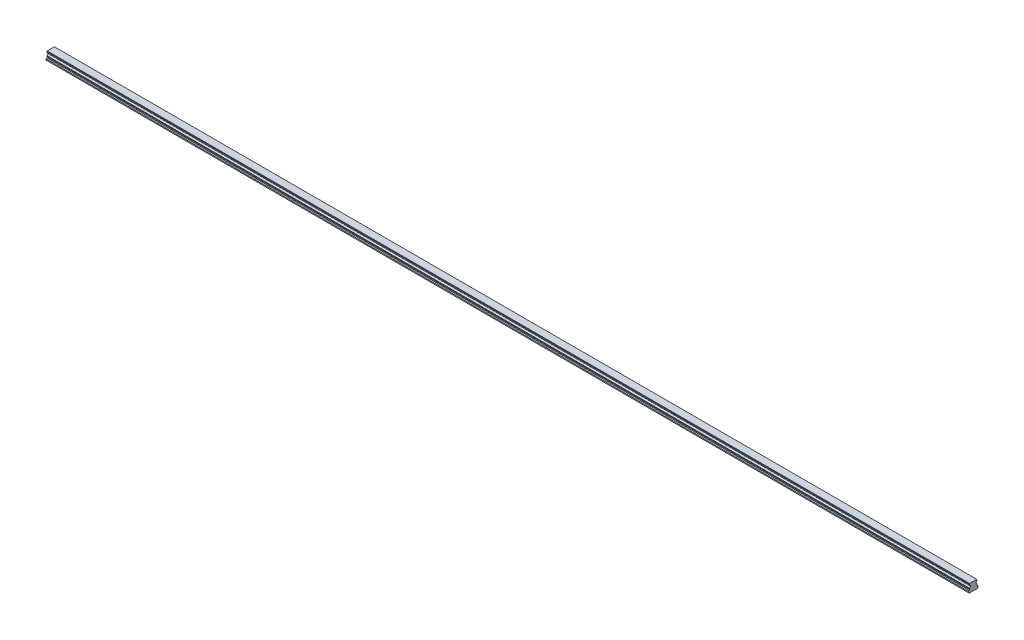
ISO-10303-21;
HEADER;
FILE_DESCRIPTION(('STEP AP214'),'2;1');
FILE_NAME('part.step','',(''),(''),'','','');
FILE_SCHEMA(('AUTOMOTIVE_DESIGN { 1 0 10303 214 1 1 1 1 }'));
ENDSEC;
DATA;
#1=APPLICATION_CONTEXT('core data for automotive mechanical design processes');
#2=APPLICATION_PROTOCOL_DEFINITION('international standard','automotive_design',2000,#1);
#3=PRODUCT_CONTEXT('',#1,'mechanical');
#4=PRODUCT('Part','Part','',(#3));
#5=PRODUCT_RELATED_PRODUCT_CATEGORY('part','',(#4));
#6=PRODUCT_DEFINITION_FORMATION('','',#4);
#7=PRODUCT_DEFINITION_CONTEXT('part definition',#1,'design');
#8=PRODUCT_DEFINITION('design','',#6,#7);
#9=PRODUCT_DEFINITION_SHAPE('','',#8);
#10=(LENGTH_UNIT() NAMED_UNIT(*) SI_UNIT(.MILLI.,.METRE.));
#11=(NAMED_UNIT(*) PLANE_ANGLE_UNIT() SI_UNIT($,.RADIAN.));
#12=(NAMED_UNIT(*) SI_UNIT($,.STERADIAN.) SOLID_ANGLE_UNIT());
#13=UNCERTAINTY_MEASURE_WITH_UNIT(LENGTH_MEASURE(1.E-05),#10,'distance_accuracy_value','');
#14=(GEOMETRIC_REPRESENTATION_CONTEXT(3) GLOBAL_UNCERTAINTY_ASSIGNED_CONTEXT((#13)) GLOBAL_UNIT_ASSIGNED_CONTEXT((#10,
#11,#12)) REPRESENTATION_CONTEXT('',''));
#15=CARTESIAN_POINT('',(0.,0.,0.));
#16=DIRECTION('',(0.,0.,1.));
#17=DIRECTION('',(1.,0.,0.));
#18=AXIS2_PLACEMENT_3D('',#15,#16,#17);
#19=CARTESIAN_POINT('',(2370.,0.499999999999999,0.));
#20=DIRECTION('',(0.,-1.,0.));
#21=DIRECTION('',(0.,0.,-1.));
#22=AXIS2_PLACEMENT_3D('',#19,#20,#21);
#23=CONICAL_SURFACE('',#22,3.5,0.785398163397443);
#24=CARTESIAN_POINT('',(2370.,1.00000000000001,0.));
#25=DIRECTION('',(0.,1.,0.));
#26=DIRECTION('',(0.,0.,1.));
#27=AXIS2_PLACEMENT_3D('',#24,#25,#26);
#28=CIRCLE('',#27,3.);
#29=CARTESIAN_POINT('',(2370.,1.00000000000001,3.));
#30=VERTEX_POINT('',#29);
#31=EDGE_CURVE('E11',#30,#30,#28,.F.);
#32=ORIENTED_EDGE('',*,*,#31,.F.);
#33=EDGE_LOOP('',(#32));
#34=FACE_BOUND('',#33,.T.);
#35=CARTESIAN_POINT('',(2370.,0.499999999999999,0.));
#36=DIRECTION('',(0.,1.,0.));
#37=DIRECTION('',(0.,0.,1.));
#38=AXIS2_PLACEMENT_3D('',#35,#36,#37);
#39=CIRCLE('',#38,3.5);
#40=CARTESIAN_POINT('',(2370.,0.5,3.5));
#41=VERTEX_POINT('',#40);
#42=EDGE_CURVE('E879',#41,#41,#39,.T.);
#43=ORIENTED_EDGE('',*,*,#42,.F.);
#44=EDGE_LOOP('',(#43));
#45=FACE_BOUND('',#44,.T.);
#46=ADVANCED_FACE('F39',(#34,#45),#23,.F.);
#47=CARTESIAN_POINT('',(2370.,12.,0.));
#48=DIRECTION('',(0.,-1.,0.));
#49=DIRECTION('',(0.,0.,-1.));
#50=AXIS2_PLACEMENT_3D('',#47,#48,#49);
#51=CYLINDRICAL_SURFACE('',#50,3.);
#52=ORIENTED_EDGE('',*,*,#31,.T.);
#53=EDGE_LOOP('',(#52));
#54=FACE_BOUND('',#53,.T.);
#55=CARTESIAN_POINT('',(2370.,12.,0.));
#56=DIRECTION('',(0.,-1.,0.));
#57=DIRECTION('',(0.,0.,-1.));
#58=AXIS2_PLACEMENT_3D('',#55,#56,#57);
#59=CIRCLE('',#58,3.);
#60=CARTESIAN_POINT('',(2370.,12.,-3.));
#61=VERTEX_POINT('',#60);
#62=EDGE_CURVE('E49',#61,#61,#59,.T.);
#63=ORIENTED_EDGE('',*,*,#62,.F.);
#64=EDGE_LOOP('',(#63));
#65=FACE_BOUND('',#64,.T.);
#66=ADVANCED_FACE('F1294',(#54,#65),#51,.F.);
#67=CARTESIAN_POINT('',(2370.,12.,0.));
#68=DIRECTION('',(0.,-1.,0.));
#69=DIRECTION('',(0.,0.,-1.));
#70=AXIS2_PLACEMENT_3D('',#67,#68,#69);
#71=PLANE('',#70);
#72=CARTESIAN_POINT('',(2370.,12.,0.));
#73=DIRECTION('',(0.,-1.,0.));
#74=DIRECTION('',(0.,0.,-1.));
#75=AXIS2_PLACEMENT_3D('',#72,#73,#74);
#76=CIRCLE('',#75,2.5);
#77=CARTESIAN_POINT('',(2370.,12.,-2.5));
#78=VERTEX_POINT('',#77);
#79=EDGE_CURVE('E42',#78,#78,#76,.T.);
#80=ORIENTED_EDGE('',*,*,#79,.F.);
#81=EDGE_LOOP('',(#80));
#82=FACE_BOUND('',#81,.T.);
#83=ORIENTED_EDGE('',*,*,#62,.T.);
#84=EDGE_LOOP('',(#83));
#85=FACE_BOUND('',#84,.T.);
#86=ADVANCED_FACE('F1299',(#82,#85),#71,.T.);
#87=CARTESIAN_POINT('',(2310.,0.499999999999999,0.));
#88=DIRECTION('',(0.,-1.,0.));
#89=DIRECTION('',(0.,0.,-1.));
#90=AXIS2_PLACEMENT_3D('',#87,#88,#89);
#91=CONICAL_SURFACE('',#90,3.5,0.785398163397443);
#92=CARTESIAN_POINT('',(2310.,1.00000000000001,0.));
#93=DIRECTION('',(0.,1.,0.));
#94=DIRECTION('',(0.,0.,1.));
#95=AXIS2_PLACEMENT_3D('',#92,#93,#94);
#96=CIRCLE('',#95,3.);
#97=CARTESIAN_POINT('',(2310.,1.00000000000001,3.));
#98=VERTEX_POINT('',#97);
#99=EDGE_CURVE('E875',#98,#98,#96,.F.);
#100=ORIENTED_EDGE('',*,*,#99,.F.);
#101=EDGE_LOOP('',(#100));
#102=FACE_BOUND('',#101,.T.);
#103=CARTESIAN_POINT('',(2310.,0.499999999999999,0.));
#104=DIRECTION('',(0.,1.,0.));
#105=DIRECTION('',(0.,0.,1.));
#106=AXIS2_PLACEMENT_3D('',#103,#104,#105);
#107=CIRCLE('',#106,3.5);
#108=CARTESIAN_POINT('',(2310.,0.5,3.5));
#109=VERTEX_POINT('',#108);
#110=EDGE_CURVE('E867',#109,#109,#107,.T.);
#111=ORIENTED_EDGE('',*,*,#110,.F.);
#112=EDGE_LOOP('',(#111));
#113=FACE_BOUND('',#112,.T.);
#114=ADVANCED_FACE('F1818',(#102,#113),#91,.F.);
#115=CARTESIAN_POINT('',(2310.,12.,0.));
#116=DIRECTION('',(0.,-1.,0.));
#117=DIRECTION('',(0.,0.,-1.));
#118=AXIS2_PLACEMENT_3D('',#115,#116,#117);
#119=CYLINDRICAL_SURFACE('',#118,3.);
#120=ORIENTED_EDGE('',*,*,#99,.T.);
#121=EDGE_LOOP('',(#120));
#122=FACE_BOUND('',#121,.T.);
#123=CARTESIAN_POINT('',(2310.,12.,0.));
#124=DIRECTION('',(0.,-1.,0.));
#125=DIRECTION('',(0.,0.,-1.));
#126=AXIS2_PLACEMENT_3D('',#123,#124,#125);
#127=CIRCLE('',#126,3.);
#128=CARTESIAN_POINT('',(2310.,12.,-3.));
#129=VERTEX_POINT('',#128);
#130=EDGE_CURVE('E871',#129,#129,#127,.T.);
#131=ORIENTED_EDGE('',*,*,#130,.F.);
#132=EDGE_LOOP('',(#131));
#133=FACE_BOUND('',#132,.T.);
#134=ADVANCED_FACE('F1814',(#122,#133),#119,.F.);
#135=CARTESIAN_POINT('',(2310.,12.,0.));
#136=DIRECTION('',(0.,-1.,0.));
#137=DIRECTION('',(0.,0.,-1.));
#138=AXIS2_PLACEMENT_3D('',#135,#136,#137);
#139=PLANE('',#138);
#140=CARTESIAN_POINT('',(2310.,12.,0.));
#141=DIRECTION('',(0.,-1.,0.));
#142=DIRECTION('',(0.,0.,-1.));
#143=AXIS2_PLACEMENT_3D('',#140,#141,#142);
#144=CIRCLE('',#143,2.5);
#145=CARTESIAN_POINT('',(2310.,12.,-2.5));
#146=VERTEX_POINT('',#145);
#147=EDGE_CURVE('E1034',#146,#146,#144,.T.);
#148=ORIENTED_EDGE('',*,*,#147,.F.);
#149=EDGE_LOOP('',(#148));
#150=FACE_BOUND('',#149,.T.);
#151=ORIENTED_EDGE('',*,*,#130,.T.);
#152=EDGE_LOOP('',(#151));
#153=FACE_BOUND('',#152,.T.);
#154=ADVANCED_FACE('F1810',(#150,#153),#139,.T.);
#155=CARTESIAN_POINT('',(2250.,0.499999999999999,0.));
#156=DIRECTION('',(0.,-1.,0.));
#157=DIRECTION('',(0.,0.,-1.));
#158=AXIS2_PLACEMENT_3D('',#155,#156,#157);
#159=CONICAL_SURFACE('',#158,3.5,0.785398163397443);
#160=CARTESIAN_POINT('',(2250.,1.00000000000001,0.));
#161=DIRECTION('',(0.,1.,0.));
#162=DIRECTION('',(0.,0.,1.));
#163=AXIS2_PLACEMENT_3D('',#160,#161,#162);
#164=CIRCLE('',#163,3.);
#165=CARTESIAN_POINT('',(2250.,1.00000000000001,3.));
#166=VERTEX_POINT('',#165);
#167=EDGE_CURVE('E863',#166,#166,#164,.F.);
#168=ORIENTED_EDGE('',*,*,#167,.F.);
#169=EDGE_LOOP('',(#168));
#170=FACE_BOUND('',#169,.T.);
#171=CARTESIAN_POINT('',(2250.,0.499999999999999,0.));
#172=DIRECTION('',(0.,1.,0.));
#173=DIRECTION('',(0.,0.,1.));
#174=AXIS2_PLACEMENT_3D('',#171,#172,#173);
#175=CIRCLE('',#174,3.5);
#176=CARTESIAN_POINT('',(2250.,0.5,3.5));
#177=VERTEX_POINT('',#176);
#178=EDGE_CURVE('E855',#177,#177,#175,.T.);
#179=ORIENTED_EDGE('',*,*,#178,.F.);
#180=EDGE_LOOP('',(#179));
#181=FACE_BOUND('',#180,.T.);
#182=ADVANCED_FACE('F1806',(#170,#181),#159,.F.);
#183=CARTESIAN_POINT('',(2250.,12.,0.));
#184=DIRECTION('',(0.,-1.,0.));
#185=DIRECTION('',(0.,0.,-1.));
#186=AXIS2_PLACEMENT_3D('',#183,#184,#185);
#187=CYLINDRICAL_SURFACE('',#186,3.);
#188=ORIENTED_EDGE('',*,*,#167,.T.);
#189=EDGE_LOOP('',(#188));
#190=FACE_BOUND('',#189,.T.);
#191=CARTESIAN_POINT('',(2250.,12.,0.));
#192=DIRECTION('',(0.,-1.,0.));
#193=DIRECTION('',(0.,0.,-1.));
#194=AXIS2_PLACEMENT_3D('',#191,#192,#193);
#195=CIRCLE('',#194,3.);
#196=CARTESIAN_POINT('',(2250.,12.,-3.));
#197=VERTEX_POINT('',#196);
#198=EDGE_CURVE('E859',#197,#197,#195,.T.);
#199=ORIENTED_EDGE('',*,*,#198,.F.);
#200=EDGE_LOOP('',(#199));
#201=FACE_BOUND('',#200,.T.);
#202=ADVANCED_FACE('F1802',(#190,#201),#187,.F.);
#203=CARTESIAN_POINT('',(2250.,12.,0.));
#204=DIRECTION('',(0.,-1.,0.));
#205=DIRECTION('',(0.,0.,-1.));
#206=AXIS2_PLACEMENT_3D('',#203,#204,#205);
#207=PLANE('',#206);
#208=CARTESIAN_POINT('',(2250.,12.,0.));
#209=DIRECTION('',(0.,-1.,0.));
#210=DIRECTION('',(0.,0.,-1.));
#211=AXIS2_PLACEMENT_3D('',#208,#209,#210);
#212=CIRCLE('',#211,2.5);
#213=CARTESIAN_POINT('',(2250.,12.,-2.5));
#214=VERTEX_POINT('',#213);
#215=EDGE_CURVE('E1031',#214,#214,#212,.T.);
#216=ORIENTED_EDGE('',*,*,#215,.F.);
#217=EDGE_LOOP('',(#216));
#218=FACE_BOUND('',#217,.T.);
#219=ORIENTED_EDGE('',*,*,#198,.T.);
#220=EDGE_LOOP('',(#219));
#221=FACE_BOUND('',#220,.T.);
#222=ADVANCED_FACE('F1798',(#218,#221),#207,.T.);
#223=CARTESIAN_POINT('',(2190.,0.499999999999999,0.));
#224=DIRECTION('',(0.,-1.,0.));
#225=DIRECTION('',(0.,0.,-1.));
#226=AXIS2_PLACEMENT_3D('',#223,#224,#225);
#227=CONICAL_SURFACE('',#226,3.5,0.785398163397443);
#228=CARTESIAN_POINT('',(2190.,1.00000000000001,0.));
#229=DIRECTION('',(0.,1.,0.));
#230=DIRECTION('',(0.,0.,1.));
#231=AXIS2_PLACEMENT_3D('',#228,#229,#230);
#232=CIRCLE('',#231,3.);
#233=CARTESIAN_POINT('',(2190.,1.00000000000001,3.));
#234=VERTEX_POINT('',#233);
#235=EDGE_CURVE('E851',#234,#234,#232,.F.);
#236=ORIENTED_EDGE('',*,*,#235,.F.);
#237=EDGE_LOOP('',(#236));
#238=FACE_BOUND('',#237,.T.);
#239=CARTESIAN_POINT('',(2190.,0.499999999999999,0.));
#240=DIRECTION('',(0.,1.,0.));
#241=DIRECTION('',(0.,0.,1.));
#242=AXIS2_PLACEMENT_3D('',#239,#240,#241);
#243=CIRCLE('',#242,3.5);
#244=CARTESIAN_POINT('',(2190.,0.5,3.5));
#245=VERTEX_POINT('',#244);
#246=EDGE_CURVE('E843',#245,#245,#243,.T.);
#247=ORIENTED_EDGE('',*,*,#246,.F.);
#248=EDGE_LOOP('',(#247));
#249=FACE_BOUND('',#248,.T.);
#250=ADVANCED_FACE('F1794',(#238,#249),#227,.F.);
#251=CARTESIAN_POINT('',(2190.,12.,0.));
#252=DIRECTION('',(0.,-1.,0.));
#253=DIRECTION('',(0.,0.,-1.));
#254=AXIS2_PLACEMENT_3D('',#251,#252,#253);
#255=CYLINDRICAL_SURFACE('',#254,3.);
#256=ORIENTED_EDGE('',*,*,#235,.T.);
#257=EDGE_LOOP('',(#256));
#258=FACE_BOUND('',#257,.T.);
#259=CARTESIAN_POINT('',(2190.,12.,0.));
#260=DIRECTION('',(0.,-1.,0.));
#261=DIRECTION('',(0.,0.,-1.));
#262=AXIS2_PLACEMENT_3D('',#259,#260,#261);
#263=CIRCLE('',#262,3.);
#264=CARTESIAN_POINT('',(2190.,12.,-3.));
#265=VERTEX_POINT('',#264);
#266=EDGE_CURVE('E847',#265,#265,#263,.T.);
#267=ORIENTED_EDGE('',*,*,#266,.F.);
#268=EDGE_LOOP('',(#267));
#269=FACE_BOUND('',#268,.T.);
#270=ADVANCED_FACE('F1790',(#258,#269),#255,.F.);
#271=CARTESIAN_POINT('',(2190.,12.,0.));
#272=DIRECTION('',(0.,-1.,0.));
#273=DIRECTION('',(0.,0.,-1.));
#274=AXIS2_PLACEMENT_3D('',#271,#272,#273);
#275=PLANE('',#274);
#276=CARTESIAN_POINT('',(2190.,12.,0.));
#277=DIRECTION('',(0.,-1.,0.));
#278=DIRECTION('',(0.,0.,-1.));
#279=AXIS2_PLACEMENT_3D('',#276,#277,#278);
#280=CIRCLE('',#279,2.5);
#281=CARTESIAN_POINT('',(2190.,12.,-2.5));
#282=VERTEX_POINT('',#281);
#283=EDGE_CURVE('E1027',#282,#282,#280,.T.);
#284=ORIENTED_EDGE('',*,*,#283,.F.);
#285=EDGE_LOOP('',(#284));
#286=FACE_BOUND('',#285,.T.);
#287=ORIENTED_EDGE('',*,*,#266,.T.);
#288=EDGE_LOOP('',(#287));
#289=FACE_BOUND('',#288,.T.);
#290=ADVANCED_FACE('F1786',(#286,#289),#275,.T.);
#291=CARTESIAN_POINT('',(2130.,0.499999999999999,0.));
#292=DIRECTION('',(0.,-1.,0.));
#293=DIRECTION('',(0.,0.,-1.));
#294=AXIS2_PLACEMENT_3D('',#291,#292,#293);
#295=CONICAL_SURFACE('',#294,3.5,0.785398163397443);
#296=CARTESIAN_POINT('',(2130.,1.00000000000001,0.));
#297=DIRECTION('',(0.,1.,0.));
#298=DIRECTION('',(0.,0.,1.));
#299=AXIS2_PLACEMENT_3D('',#296,#297,#298);
#300=CIRCLE('',#299,3.);
#301=CARTESIAN_POINT('',(2130.,1.00000000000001,3.));
#302=VERTEX_POINT('',#301);
#303=EDGE_CURVE('E839',#302,#302,#300,.F.);
#304=ORIENTED_EDGE('',*,*,#303,.F.);
#305=EDGE_LOOP('',(#304));
#306=FACE_BOUND('',#305,.T.);
#307=CARTESIAN_POINT('',(2130.,0.499999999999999,0.));
#308=DIRECTION('',(0.,1.,0.));
#309=DIRECTION('',(0.,0.,1.));
#310=AXIS2_PLACEMENT_3D('',#307,#308,#309);
#311=CIRCLE('',#310,3.5);
#312=CARTESIAN_POINT('',(2130.,0.5,3.5));
#313=VERTEX_POINT('',#312);
#314=EDGE_CURVE('E831',#313,#313,#311,.T.);
#315=ORIENTED_EDGE('',*,*,#314,.F.);
#316=EDGE_LOOP('',(#315));
#317=FACE_BOUND('',#316,.T.);
#318=ADVANCED_FACE('F1782',(#306,#317),#295,.F.);
#319=CARTESIAN_POINT('',(2130.,12.,0.));
#320=DIRECTION('',(0.,-1.,0.));
#321=DIRECTION('',(0.,0.,-1.));
#322=AXIS2_PLACEMENT_3D('',#319,#320,#321);
#323=CYLINDRICAL_SURFACE('',#322,3.);
#324=ORIENTED_EDGE('',*,*,#303,.T.);
#325=EDGE_LOOP('',(#324));
#326=FACE_BOUND('',#325,.T.);
#327=CARTESIAN_POINT('',(2130.,12.,0.));
#328=DIRECTION('',(0.,-1.,0.));
#329=DIRECTION('',(0.,0.,-1.));
#330=AXIS2_PLACEMENT_3D('',#327,#328,#329);
#331=CIRCLE('',#330,3.);
#332=CARTESIAN_POINT('',(2130.,12.,-3.));
#333=VERTEX_POINT('',#332);
#334=EDGE_CURVE('E835',#333,#333,#331,.T.);
#335=ORIENTED_EDGE('',*,*,#334,.F.);
#336=EDGE_LOOP('',(#335));
#337=FACE_BOUND('',#336,.T.);
#338=ADVANCED_FACE('F1778',(#326,#337),#323,.F.);
#339=CARTESIAN_POINT('',(2130.,12.,0.));
#340=DIRECTION('',(0.,-1.,0.));
#341=DIRECTION('',(0.,0.,-1.));
#342=AXIS2_PLACEMENT_3D('',#339,#340,#341);
#343=PLANE('',#342);
#344=CARTESIAN_POINT('',(2130.,12.,0.));
#345=DIRECTION('',(0.,-1.,0.));
#346=DIRECTION('',(0.,0.,-1.));
#347=AXIS2_PLACEMENT_3D('',#344,#345,#346);
#348=CIRCLE('',#347,2.5);
#349=CARTESIAN_POINT('',(2130.,12.,-2.5));
#350=VERTEX_POINT('',#349);
#351=EDGE_CURVE('E1023',#350,#350,#348,.T.);
#352=ORIENTED_EDGE('',*,*,#351,.F.);
#353=EDGE_LOOP('',(#352));
#354=FACE_BOUND('',#353,.T.);
#355=ORIENTED_EDGE('',*,*,#334,.T.);
#356=EDGE_LOOP('',(#355));
#357=FACE_BOUND('',#356,.T.);
#358=ADVANCED_FACE('F1774',(#354,#357),#343,.T.);
#359=CARTESIAN_POINT('',(2070.,0.499999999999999,0.));
#360=DIRECTION('',(0.,-1.,0.));
#361=DIRECTION('',(0.,0.,-1.));
#362=AXIS2_PLACEMENT_3D('',#359,#360,#361);
#363=CONICAL_SURFACE('',#362,3.5,0.785398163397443);
#364=CARTESIAN_POINT('',(2070.,1.00000000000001,0.));
#365=DIRECTION('',(0.,1.,0.));
#366=DIRECTION('',(0.,0.,1.));
#367=AXIS2_PLACEMENT_3D('',#364,#365,#366);
#368=CIRCLE('',#367,3.);
#369=CARTESIAN_POINT('',(2070.,1.00000000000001,3.));
#370=VERTEX_POINT('',#369);
#371=EDGE_CURVE('E827',#370,#370,#368,.F.);
#372=ORIENTED_EDGE('',*,*,#371,.F.);
#373=EDGE_LOOP('',(#372));
#374=FACE_BOUND('',#373,.T.);
#375=CARTESIAN_POINT('',(2070.,0.499999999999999,0.));
#376=DIRECTION('',(0.,1.,0.));
#377=DIRECTION('',(0.,0.,1.));
#378=AXIS2_PLACEMENT_3D('',#375,#376,#377);
#379=CIRCLE('',#378,3.5);
#380=CARTESIAN_POINT('',(2070.,0.5,3.5));
#381=VERTEX_POINT('',#380);
#382=EDGE_CURVE('E819',#381,#381,#379,.T.);
#383=ORIENTED_EDGE('',*,*,#382,.F.);
#384=EDGE_LOOP('',(#383));
#385=FACE_BOUND('',#384,.T.);
#386=ADVANCED_FACE('F1770',(#374,#385),#363,.F.);
#387=CARTESIAN_POINT('',(2070.,12.,0.));
#388=DIRECTION('',(0.,-1.,0.));
#389=DIRECTION('',(0.,0.,-1.));
#390=AXIS2_PLACEMENT_3D('',#387,#388,#389);
#391=CYLINDRICAL_SURFACE('',#390,3.);
#392=ORIENTED_EDGE('',*,*,#371,.T.);
#393=EDGE_LOOP('',(#392));
#394=FACE_BOUND('',#393,.T.);
#395=CARTESIAN_POINT('',(2070.,12.,0.));
#396=DIRECTION('',(0.,-1.,0.));
#397=DIRECTION('',(0.,0.,-1.));
#398=AXIS2_PLACEMENT_3D('',#395,#396,#397);
#399=CIRCLE('',#398,3.);
#400=CARTESIAN_POINT('',(2070.,12.,-3.));
#401=VERTEX_POINT('',#400);
#402=EDGE_CURVE('E823',#401,#401,#399,.T.);
#403=ORIENTED_EDGE('',*,*,#402,.F.);
#404=EDGE_LOOP('',(#403));
#405=FACE_BOUND('',#404,.T.);
#406=ADVANCED_FACE('F1766',(#394,#405),#391,.F.);
#407=CARTESIAN_POINT('',(2070.,12.,0.));
#408=DIRECTION('',(0.,-1.,0.));
#409=DIRECTION('',(0.,0.,-1.));
#410=AXIS2_PLACEMENT_3D('',#407,#408,#409);
#411=PLANE('',#410);
#412=CARTESIAN_POINT('',(2070.,12.,0.));
#413=DIRECTION('',(0.,-1.,0.));
#414=DIRECTION('',(0.,0.,-1.));
#415=AXIS2_PLACEMENT_3D('',#412,#413,#414);
#416=CIRCLE('',#415,2.5);
#417=CARTESIAN_POINT('',(2070.,12.,-2.5));
#418=VERTEX_POINT('',#417);
#419=EDGE_CURVE('E1019',#418,#418,#416,.T.);
#420=ORIENTED_EDGE('',*,*,#419,.F.);
#421=EDGE_LOOP('',(#420));
#422=FACE_BOUND('',#421,.T.);
#423=ORIENTED_EDGE('',*,*,#402,.T.);
#424=EDGE_LOOP('',(#423));
#425=FACE_BOUND('',#424,.T.);
#426=ADVANCED_FACE('F1762',(#422,#425),#411,.T.);
#427=CARTESIAN_POINT('',(2010.,0.499999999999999,0.));
#428=DIRECTION('',(0.,-1.,0.));
#429=DIRECTION('',(0.,0.,-1.));
#430=AXIS2_PLACEMENT_3D('',#427,#428,#429);
#431=CONICAL_SURFACE('',#430,3.5,0.785398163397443);
#432=CARTESIAN_POINT('',(2010.,1.00000000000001,0.));
#433=DIRECTION('',(0.,1.,0.));
#434=DIRECTION('',(0.,0.,1.));
#435=AXIS2_PLACEMENT_3D('',#432,#433,#434);
#436=CIRCLE('',#435,3.);
#437=CARTESIAN_POINT('',(2010.,1.00000000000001,3.));
#438=VERTEX_POINT('',#437);
#439=EDGE_CURVE('E815',#438,#438,#436,.F.);
#440=ORIENTED_EDGE('',*,*,#439,.F.);
#441=EDGE_LOOP('',(#440));
#442=FACE_BOUND('',#441,.T.);
#443=CARTESIAN_POINT('',(2010.,0.499999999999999,0.));
#444=DIRECTION('',(0.,1.,0.));
#445=DIRECTION('',(0.,0.,1.));
#446=AXIS2_PLACEMENT_3D('',#443,#444,#445);
#447=CIRCLE('',#446,3.5);
#448=CARTESIAN_POINT('',(2010.,0.5,3.5));
#449=VERTEX_POINT('',#448);
#450=EDGE_CURVE('E807',#449,#449,#447,.T.);
#451=ORIENTED_EDGE('',*,*,#450,.F.);
#452=EDGE_LOOP('',(#451));
#453=FACE_BOUND('',#452,.T.);
#454=ADVANCED_FACE('F1758',(#442,#453),#431,.F.);
#455=CARTESIAN_POINT('',(2010.,12.,0.));
#456=DIRECTION('',(0.,-1.,0.));
#457=DIRECTION('',(0.,0.,-1.));
#458=AXIS2_PLACEMENT_3D('',#455,#456,#457);
#459=CYLINDRICAL_SURFACE('',#458,3.);
#460=ORIENTED_EDGE('',*,*,#439,.T.);
#461=EDGE_LOOP('',(#460));
#462=FACE_BOUND('',#461,.T.);
#463=CARTESIAN_POINT('',(2010.,12.,0.));
#464=DIRECTION('',(0.,-1.,0.));
#465=DIRECTION('',(0.,0.,-1.));
#466=AXIS2_PLACEMENT_3D('',#463,#464,#465);
#467=CIRCLE('',#466,3.);
#468=CARTESIAN_POINT('',(2010.,12.,-3.));
#469=VERTEX_POINT('',#468);
#470=EDGE_CURVE('E811',#469,#469,#467,.T.);
#471=ORIENTED_EDGE('',*,*,#470,.F.);
#472=EDGE_LOOP('',(#471));
#473=FACE_BOUND('',#472,.T.);
#474=ADVANCED_FACE('F1754',(#462,#473),#459,.F.);
#475=CARTESIAN_POINT('',(2010.,12.,0.));
#476=DIRECTION('',(0.,-1.,0.));
#477=DIRECTION('',(0.,0.,-1.));
#478=AXIS2_PLACEMENT_3D('',#475,#476,#477);
#479=PLANE('',#478);
#480=CARTESIAN_POINT('',(2010.,12.,0.));
#481=DIRECTION('',(0.,-1.,0.));
#482=DIRECTION('',(0.,0.,-1.));
#483=AXIS2_PLACEMENT_3D('',#480,#481,#482);
#484=CIRCLE('',#483,2.5);
#485=CARTESIAN_POINT('',(2010.,12.,-2.5));
#486=VERTEX_POINT('',#485);
#487=EDGE_CURVE('E1015',#486,#486,#484,.T.);
#488=ORIENTED_EDGE('',*,*,#487,.F.);
#489=EDGE_LOOP('',(#488));
#490=FACE_BOUND('',#489,.T.);
#491=ORIENTED_EDGE('',*,*,#470,.T.);
#492=EDGE_LOOP('',(#491));
#493=FACE_BOUND('',#492,.T.);
#494=ADVANCED_FACE('F1750',(#490,#493),#479,.T.);
#495=CARTESIAN_POINT('',(1950.,0.499999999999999,0.));
#496=DIRECTION('',(0.,-1.,0.));
#497=DIRECTION('',(0.,0.,-1.));
#498=AXIS2_PLACEMENT_3D('',#495,#496,#497);
#499=CONICAL_SURFACE('',#498,3.5,0.785398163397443);
#500=CARTESIAN_POINT('',(1950.,1.00000000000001,0.));
#501=DIRECTION('',(0.,1.,0.));
#502=DIRECTION('',(0.,0.,1.));
#503=AXIS2_PLACEMENT_3D('',#500,#501,#502);
#504=CIRCLE('',#503,3.);
#505=CARTESIAN_POINT('',(1950.,1.00000000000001,3.));
#506=VERTEX_POINT('',#505);
#507=EDGE_CURVE('E803',#506,#506,#504,.F.);
#508=ORIENTED_EDGE('',*,*,#507,.F.);
#509=EDGE_LOOP('',(#508));
#510=FACE_BOUND('',#509,.T.);
#511=CARTESIAN_POINT('',(1950.,0.499999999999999,0.));
#512=DIRECTION('',(0.,1.,0.));
#513=DIRECTION('',(0.,0.,1.));
#514=AXIS2_PLACEMENT_3D('',#511,#512,#513);
#515=CIRCLE('',#514,3.5);
#516=CARTESIAN_POINT('',(1950.,0.5,3.5));
#517=VERTEX_POINT('',#516);
#518=EDGE_CURVE('E795',#517,#517,#515,.T.);
#519=ORIENTED_EDGE('',*,*,#518,.F.);
#520=EDGE_LOOP('',(#519));
#521=FACE_BOUND('',#520,.T.);
#522=ADVANCED_FACE('F1746',(#510,#521),#499,.F.);
#523=CARTESIAN_POINT('',(1950.,12.,0.));
#524=DIRECTION('',(0.,-1.,0.));
#525=DIRECTION('',(0.,0.,-1.));
#526=AXIS2_PLACEMENT_3D('',#523,#524,#525);
#527=CYLINDRICAL_SURFACE('',#526,3.);
#528=ORIENTED_EDGE('',*,*,#507,.T.);
#529=EDGE_LOOP('',(#528));
#530=FACE_BOUND('',#529,.T.);
#531=CARTESIAN_POINT('',(1950.,12.,0.));
#532=DIRECTION('',(0.,-1.,0.));
#533=DIRECTION('',(0.,0.,-1.));
#534=AXIS2_PLACEMENT_3D('',#531,#532,#533);
#535=CIRCLE('',#534,3.);
#536=CARTESIAN_POINT('',(1950.,12.,-3.));
#537=VERTEX_POINT('',#536);
#538=EDGE_CURVE('E799',#537,#537,#535,.T.);
#539=ORIENTED_EDGE('',*,*,#538,.F.);
#540=EDGE_LOOP('',(#539));
#541=FACE_BOUND('',#540,.T.);
#542=ADVANCED_FACE('F1742',(#530,#541),#527,.F.);
#543=CARTESIAN_POINT('',(1950.,12.,0.));
#544=DIRECTION('',(0.,-1.,0.));
#545=DIRECTION('',(0.,0.,-1.));
#546=AXIS2_PLACEMENT_3D('',#543,#544,#545);
#547=PLANE('',#546);
#548=CARTESIAN_POINT('',(1950.,12.,0.));
#549=DIRECTION('',(0.,-1.,0.));
#550=DIRECTION('',(0.,0.,-1.));
#551=AXIS2_PLACEMENT_3D('',#548,#549,#550);
#552=CIRCLE('',#551,2.5);
#553=CARTESIAN_POINT('',(1950.,12.,-2.5));
#554=VERTEX_POINT('',#553);
#555=EDGE_CURVE('E1011',#554,#554,#552,.T.);
#556=ORIENTED_EDGE('',*,*,#555,.F.);
#557=EDGE_LOOP('',(#556));
#558=FACE_BOUND('',#557,.T.);
#559=ORIENTED_EDGE('',*,*,#538,.T.);
#560=EDGE_LOOP('',(#559));
#561=FACE_BOUND('',#560,.T.);
#562=ADVANCED_FACE('F1738',(#558,#561),#547,.T.);
#563=CARTESIAN_POINT('',(1890.,0.499999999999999,0.));
#564=DIRECTION('',(0.,-1.,0.));
#565=DIRECTION('',(0.,0.,-1.));
#566=AXIS2_PLACEMENT_3D('',#563,#564,#565);
#567=CONICAL_SURFACE('',#566,3.5,0.785398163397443);
#568=CARTESIAN_POINT('',(1890.,1.00000000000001,0.));
#569=DIRECTION('',(0.,1.,0.));
#570=DIRECTION('',(0.,0.,1.));
#571=AXIS2_PLACEMENT_3D('',#568,#569,#570);
#572=CIRCLE('',#571,3.);
#573=CARTESIAN_POINT('',(1890.,1.00000000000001,3.));
#574=VERTEX_POINT('',#573);
#575=EDGE_CURVE('E791',#574,#574,#572,.F.);
#576=ORIENTED_EDGE('',*,*,#575,.F.);
#577=EDGE_LOOP('',(#576));
#578=FACE_BOUND('',#577,.T.);
#579=CARTESIAN_POINT('',(1890.,0.499999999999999,0.));
#580=DIRECTION('',(0.,1.,0.));
#581=DIRECTION('',(0.,0.,1.));
#582=AXIS2_PLACEMENT_3D('',#579,#580,#581);
#583=CIRCLE('',#582,3.5);
#584=CARTESIAN_POINT('',(1890.,0.5,3.5));
#585=VERTEX_POINT('',#584);
#586=EDGE_CURVE('E783',#585,#585,#583,.T.);
#587=ORIENTED_EDGE('',*,*,#586,.F.);
#588=EDGE_LOOP('',(#587));
#589=FACE_BOUND('',#588,.T.);
#590=ADVANCED_FACE('F1734',(#578,#589),#567,.F.);
#591=CARTESIAN_POINT('',(1890.,12.,0.));
#592=DIRECTION('',(0.,-1.,0.));
#593=DIRECTION('',(0.,0.,-1.));
#594=AXIS2_PLACEMENT_3D('',#591,#592,#593);
#595=CYLINDRICAL_SURFACE('',#594,3.);
#596=ORIENTED_EDGE('',*,*,#575,.T.);
#597=EDGE_LOOP('',(#596));
#598=FACE_BOUND('',#597,.T.);
#599=CARTESIAN_POINT('',(1890.,12.,0.));
#600=DIRECTION('',(0.,-1.,0.));
#601=DIRECTION('',(0.,0.,-1.));
#602=AXIS2_PLACEMENT_3D('',#599,#600,#601);
#603=CIRCLE('',#602,3.);
#604=CARTESIAN_POINT('',(1890.,12.,-3.));
#605=VERTEX_POINT('',#604);
#606=EDGE_CURVE('E787',#605,#605,#603,.T.);
#607=ORIENTED_EDGE('',*,*,#606,.F.);
#608=EDGE_LOOP('',(#607));
#609=FACE_BOUND('',#608,.T.);
#610=ADVANCED_FACE('F1730',(#598,#609),#595,.F.);
#611=CARTESIAN_POINT('',(1890.,12.,0.));
#612=DIRECTION('',(0.,-1.,0.));
#613=DIRECTION('',(0.,0.,-1.));
#614=AXIS2_PLACEMENT_3D('',#611,#612,#613);
#615=PLANE('',#614);
#616=CARTESIAN_POINT('',(1890.,12.,0.));
#617=DIRECTION('',(0.,-1.,0.));
#618=DIRECTION('',(0.,0.,-1.));
#619=AXIS2_PLACEMENT_3D('',#616,#617,#618);
#620=CIRCLE('',#619,2.5);
#621=CARTESIAN_POINT('',(1890.,12.,-2.5));
#622=VERTEX_POINT('',#621);
#623=EDGE_CURVE('E1007',#622,#622,#620,.T.);
#624=ORIENTED_EDGE('',*,*,#623,.F.);
#625=EDGE_LOOP('',(#624));
#626=FACE_BOUND('',#625,.T.);
#627=ORIENTED_EDGE('',*,*,#606,.T.);
#628=EDGE_LOOP('',(#627));
#629=FACE_BOUND('',#628,.T.);
#630=ADVANCED_FACE('F1726',(#626,#629),#615,.T.);
#631=CARTESIAN_POINT('',(1830.,0.499999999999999,0.));
#632=DIRECTION('',(0.,-1.,0.));
#633=DIRECTION('',(0.,0.,-1.));
#634=AXIS2_PLACEMENT_3D('',#631,#632,#633);
#635=CONICAL_SURFACE('',#634,3.5,0.785398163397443);
#636=CARTESIAN_POINT('',(1830.,1.00000000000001,0.));
#637=DIRECTION('',(0.,1.,0.));
#638=DIRECTION('',(0.,0.,1.));
#639=AXIS2_PLACEMENT_3D('',#636,#637,#638);
#640=CIRCLE('',#639,3.);
#641=CARTESIAN_POINT('',(1830.,1.00000000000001,3.));
#642=VERTEX_POINT('',#641);
#643=EDGE_CURVE('E779',#642,#642,#640,.F.);
#644=ORIENTED_EDGE('',*,*,#643,.F.);
#645=EDGE_LOOP('',(#644));
#646=FACE_BOUND('',#645,.T.);
#647=CARTESIAN_POINT('',(1830.,0.499999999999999,0.));
#648=DIRECTION('',(0.,1.,0.));
#649=DIRECTION('',(0.,0.,1.));
#650=AXIS2_PLACEMENT_3D('',#647,#648,#649);
#651=CIRCLE('',#650,3.5);
#652=CARTESIAN_POINT('',(1830.,0.5,3.5));
#653=VERTEX_POINT('',#652);
#654=EDGE_CURVE('E771',#653,#653,#651,.T.);
#655=ORIENTED_EDGE('',*,*,#654,.F.);
#656=EDGE_LOOP('',(#655));
#657=FACE_BOUND('',#656,.T.);
#658=ADVANCED_FACE('F1722',(#646,#657),#635,.F.);
#659=CARTESIAN_POINT('',(1830.,12.,0.));
#660=DIRECTION('',(0.,-1.,0.));
#661=DIRECTION('',(0.,0.,-1.));
#662=AXIS2_PLACEMENT_3D('',#659,#660,#661);
#663=CYLINDRICAL_SURFACE('',#662,3.);
#664=ORIENTED_EDGE('',*,*,#643,.T.);
#665=EDGE_LOOP('',(#664));
#666=FACE_BOUND('',#665,.T.);
#667=CARTESIAN_POINT('',(1830.,12.,0.));
#668=DIRECTION('',(0.,-1.,0.));
#669=DIRECTION('',(0.,0.,-1.));
#670=AXIS2_PLACEMENT_3D('',#667,#668,#669);
#671=CIRCLE('',#670,3.);
#672=CARTESIAN_POINT('',(1830.,12.,-3.));
#673=VERTEX_POINT('',#672);
#674=EDGE_CURVE('E775',#673,#673,#671,.T.);
#675=ORIENTED_EDGE('',*,*,#674,.F.);
#676=EDGE_LOOP('',(#675));
#677=FACE_BOUND('',#676,.T.);
#678=ADVANCED_FACE('F1718',(#666,#677),#663,.F.);
#679=CARTESIAN_POINT('',(1830.,12.,0.));
#680=DIRECTION('',(0.,-1.,0.));
#681=DIRECTION('',(0.,0.,-1.));
#682=AXIS2_PLACEMENT_3D('',#679,#680,#681);
#683=PLANE('',#682);
#684=CARTESIAN_POINT('',(1830.,12.,0.));
#685=DIRECTION('',(0.,-1.,0.));
#686=DIRECTION('',(0.,0.,-1.));
#687=AXIS2_PLACEMENT_3D('',#684,#685,#686);
#688=CIRCLE('',#687,2.5);
#689=CARTESIAN_POINT('',(1830.,12.,-2.5));
#690=VERTEX_POINT('',#689);
#691=EDGE_CURVE('E1003',#690,#690,#688,.T.);
#692=ORIENTED_EDGE('',*,*,#691,.F.);
#693=EDGE_LOOP('',(#692));
#694=FACE_BOUND('',#693,.T.);
#695=ORIENTED_EDGE('',*,*,#674,.T.);
#696=EDGE_LOOP('',(#695));
#697=FACE_BOUND('',#696,.T.);
#698=ADVANCED_FACE('F1714',(#694,#697),#683,.T.);
#699=CARTESIAN_POINT('',(1770.,0.499999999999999,0.));
#700=DIRECTION('',(0.,-1.,0.));
#701=DIRECTION('',(0.,0.,-1.));
#702=AXIS2_PLACEMENT_3D('',#699,#700,#701);
#703=CONICAL_SURFACE('',#702,3.5,0.785398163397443);
#704=CARTESIAN_POINT('',(1770.,1.00000000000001,0.));
#705=DIRECTION('',(0.,1.,0.));
#706=DIRECTION('',(0.,0.,1.));
#707=AXIS2_PLACEMENT_3D('',#704,#705,#706);
#708=CIRCLE('',#707,3.);
#709=CARTESIAN_POINT('',(1770.,1.00000000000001,3.));
#710=VERTEX_POINT('',#709);
#711=EDGE_CURVE('E767',#710,#710,#708,.F.);
#712=ORIENTED_EDGE('',*,*,#711,.F.);
#713=EDGE_LOOP('',(#712));
#714=FACE_BOUND('',#713,.T.);
#715=CARTESIAN_POINT('',(1770.,0.499999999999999,0.));
#716=DIRECTION('',(0.,1.,0.));
#717=DIRECTION('',(0.,0.,1.));
#718=AXIS2_PLACEMENT_3D('',#715,#716,#717);
#719=CIRCLE('',#718,3.5);
#720=CARTESIAN_POINT('',(1770.,0.5,3.5));
#721=VERTEX_POINT('',#720);
#722=EDGE_CURVE('E759',#721,#721,#719,.T.);
#723=ORIENTED_EDGE('',*,*,#722,.F.);
#724=EDGE_LOOP('',(#723));
#725=FACE_BOUND('',#724,.T.);
#726=ADVANCED_FACE('F1710',(#714,#725),#703,.F.);
#727=CARTESIAN_POINT('',(1770.,12.,0.));
#728=DIRECTION('',(0.,-1.,0.));
#729=DIRECTION('',(0.,0.,-1.));
#730=AXIS2_PLACEMENT_3D('',#727,#728,#729);
#731=CYLINDRICAL_SURFACE('',#730,3.);
#732=ORIENTED_EDGE('',*,*,#711,.T.);
#733=EDGE_LOOP('',(#732));
#734=FACE_BOUND('',#733,.T.);
#735=CARTESIAN_POINT('',(1770.,12.,0.));
#736=DIRECTION('',(0.,-1.,0.));
#737=DIRECTION('',(0.,0.,-1.));
#738=AXIS2_PLACEMENT_3D('',#735,#736,#737);
#739=CIRCLE('',#738,3.);
#740=CARTESIAN_POINT('',(1770.,12.,-3.));
#741=VERTEX_POINT('',#740);
#742=EDGE_CURVE('E763',#741,#741,#739,.T.);
#743=ORIENTED_EDGE('',*,*,#742,.F.);
#744=EDGE_LOOP('',(#743));
#745=FACE_BOUND('',#744,.T.);
#746=ADVANCED_FACE('F1706',(#734,#745),#731,.F.);
#747=CARTESIAN_POINT('',(1770.,12.,0.));
#748=DIRECTION('',(0.,-1.,0.));
#749=DIRECTION('',(0.,0.,-1.));
#750=AXIS2_PLACEMENT_3D('',#747,#748,#749);
#751=PLANE('',#750);
#752=CARTESIAN_POINT('',(1770.,12.,0.));
#753=DIRECTION('',(0.,-1.,0.));
#754=DIRECTION('',(0.,0.,-1.));
#755=AXIS2_PLACEMENT_3D('',#752,#753,#754);
#756=CIRCLE('',#755,2.5);
#757=CARTESIAN_POINT('',(1770.,12.,-2.5));
#758=VERTEX_POINT('',#757);
#759=EDGE_CURVE('E999',#758,#758,#756,.T.);
#760=ORIENTED_EDGE('',*,*,#759,.F.);
#761=EDGE_LOOP('',(#760));
#762=FACE_BOUND('',#761,.T.);
#763=ORIENTED_EDGE('',*,*,#742,.T.);
#764=EDGE_LOOP('',(#763));
#765=FACE_BOUND('',#764,.T.);
#766=ADVANCED_FACE('F1702',(#762,#765),#751,.T.);
#767=CARTESIAN_POINT('',(1710.,0.499999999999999,0.));
#768=DIRECTION('',(0.,-1.,0.));
#769=DIRECTION('',(0.,0.,-1.));
#770=AXIS2_PLACEMENT_3D('',#767,#768,#769);
#771=CONICAL_SURFACE('',#770,3.5,0.785398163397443);
#772=CARTESIAN_POINT('',(1710.,1.00000000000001,0.));
#773=DIRECTION('',(0.,1.,0.));
#774=DIRECTION('',(0.,0.,1.));
#775=AXIS2_PLACEMENT_3D('',#772,#773,#774);
#776=CIRCLE('',#775,3.);
#777=CARTESIAN_POINT('',(1710.,1.00000000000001,3.));
#778=VERTEX_POINT('',#777);
#779=EDGE_CURVE('E755',#778,#778,#776,.F.);
#780=ORIENTED_EDGE('',*,*,#779,.F.);
#781=EDGE_LOOP('',(#780));
#782=FACE_BOUND('',#781,.T.);
#783=CARTESIAN_POINT('',(1710.,0.499999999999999,0.));
#784=DIRECTION('',(0.,1.,0.));
#785=DIRECTION('',(0.,0.,1.));
#786=AXIS2_PLACEMENT_3D('',#783,#784,#785);
#787=CIRCLE('',#786,3.5);
#788=CARTESIAN_POINT('',(1710.,0.5,3.5));
#789=VERTEX_POINT('',#788);
#790=EDGE_CURVE('E747',#789,#789,#787,.T.);
#791=ORIENTED_EDGE('',*,*,#790,.F.);
#792=EDGE_LOOP('',(#791));
#793=FACE_BOUND('',#792,.T.);
#794=ADVANCED_FACE('F1698',(#782,#793),#771,.F.);
#795=CARTESIAN_POINT('',(1710.,12.,0.));
#796=DIRECTION('',(0.,-1.,0.));
#797=DIRECTION('',(0.,0.,-1.));
#798=AXIS2_PLACEMENT_3D('',#795,#796,#797);
#799=CYLINDRICAL_SURFACE('',#798,3.);
#800=ORIENTED_EDGE('',*,*,#779,.T.);
#801=EDGE_LOOP('',(#800));
#802=FACE_BOUND('',#801,.T.);
#803=CARTESIAN_POINT('',(1710.,12.,0.));
#804=DIRECTION('',(0.,-1.,0.));
#805=DIRECTION('',(0.,0.,-1.));
#806=AXIS2_PLACEMENT_3D('',#803,#804,#805);
#807=CIRCLE('',#806,3.);
#808=CARTESIAN_POINT('',(1710.,12.,-3.));
#809=VERTEX_POINT('',#808);
#810=EDGE_CURVE('E751',#809,#809,#807,.T.);
#811=ORIENTED_EDGE('',*,*,#810,.F.);
#812=EDGE_LOOP('',(#811));
#813=FACE_BOUND('',#812,.T.);
#814=ADVANCED_FACE('F1694',(#802,#813),#799,.F.);
#815=CARTESIAN_POINT('',(1710.,12.,0.));
#816=DIRECTION('',(0.,-1.,0.));
#817=DIRECTION('',(0.,0.,-1.));
#818=AXIS2_PLACEMENT_3D('',#815,#816,#817);
#819=PLANE('',#818);
#820=CARTESIAN_POINT('',(1710.,12.,0.));
#821=DIRECTION('',(0.,-1.,0.));
#822=DIRECTION('',(0.,0.,-1.));
#823=AXIS2_PLACEMENT_3D('',#820,#821,#822);
#824=CIRCLE('',#823,2.5);
#825=CARTESIAN_POINT('',(1710.,12.,-2.5));
#826=VERTEX_POINT('',#825);
#827=EDGE_CURVE('E995',#826,#826,#824,.T.);
#828=ORIENTED_EDGE('',*,*,#827,.F.);
#829=EDGE_LOOP('',(#828));
#830=FACE_BOUND('',#829,.T.);
#831=ORIENTED_EDGE('',*,*,#810,.T.);
#832=EDGE_LOOP('',(#831));
#833=FACE_BOUND('',#832,.T.);
#834=ADVANCED_FACE('F1690',(#830,#833),#819,.T.);
#835=CARTESIAN_POINT('',(1650.,0.499999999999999,0.));
#836=DIRECTION('',(0.,-1.,0.));
#837=DIRECTION('',(0.,0.,-1.));
#838=AXIS2_PLACEMENT_3D('',#835,#836,#837);
#839=CONICAL_SURFACE('',#838,3.5,0.785398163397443);
#840=CARTESIAN_POINT('',(1650.,1.00000000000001,0.));
#841=DIRECTION('',(0.,1.,0.));
#842=DIRECTION('',(0.,0.,1.));
#843=AXIS2_PLACEMENT_3D('',#840,#841,#842);
#844=CIRCLE('',#843,3.);
#845=CARTESIAN_POINT('',(1650.,1.00000000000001,3.));
#846=VERTEX_POINT('',#845);
#847=EDGE_CURVE('E743',#846,#846,#844,.F.);
#848=ORIENTED_EDGE('',*,*,#847,.F.);
#849=EDGE_LOOP('',(#848));
#850=FACE_BOUND('',#849,.T.);
#851=CARTESIAN_POINT('',(1650.,0.499999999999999,0.));
#852=DIRECTION('',(0.,1.,0.));
#853=DIRECTION('',(0.,0.,1.));
#854=AXIS2_PLACEMENT_3D('',#851,#852,#853);
#855=CIRCLE('',#854,3.5);
#856=CARTESIAN_POINT('',(1650.,0.5,3.5));
#857=VERTEX_POINT('',#856);
#858=EDGE_CURVE('E735',#857,#857,#855,.T.);
#859=ORIENTED_EDGE('',*,*,#858,.F.);
#860=EDGE_LOOP('',(#859));
#861=FACE_BOUND('',#860,.T.);
#862=ADVANCED_FACE('F1686',(#850,#861),#839,.F.);
#863=CARTESIAN_POINT('',(1650.,12.,0.));
#864=DIRECTION('',(0.,-1.,0.));
#865=DIRECTION('',(0.,0.,-1.));
#866=AXIS2_PLACEMENT_3D('',#863,#864,#865);
#867=CYLINDRICAL_SURFACE('',#866,3.);
#868=ORIENTED_EDGE('',*,*,#847,.T.);
#869=EDGE_LOOP('',(#868));
#870=FACE_BOUND('',#869,.T.);
#871=CARTESIAN_POINT('',(1650.,12.,0.));
#872=DIRECTION('',(0.,-1.,0.));
#873=DIRECTION('',(0.,0.,-1.));
#874=AXIS2_PLACEMENT_3D('',#871,#872,#873);
#875=CIRCLE('',#874,3.);
#876=CARTESIAN_POINT('',(1650.,12.,-3.));
#877=VERTEX_POINT('',#876);
#878=EDGE_CURVE('E739',#877,#877,#875,.T.);
#879=ORIENTED_EDGE('',*,*,#878,.F.);
#880=EDGE_LOOP('',(#879));
#881=FACE_BOUND('',#880,.T.);
#882=ADVANCED_FACE('F1682',(#870,#881),#867,.F.);
#883=CARTESIAN_POINT('',(1650.,12.,0.));
#884=DIRECTION('',(0.,-1.,0.));
#885=DIRECTION('',(0.,0.,-1.));
#886=AXIS2_PLACEMENT_3D('',#883,#884,#885);
#887=PLANE('',#886);
#888=CARTESIAN_POINT('',(1650.,12.,0.));
#889=DIRECTION('',(0.,-1.,0.));
#890=DIRECTION('',(0.,0.,-1.));
#891=AXIS2_PLACEMENT_3D('',#888,#889,#890);
#892=CIRCLE('',#891,2.5);
#893=CARTESIAN_POINT('',(1650.,12.,-2.5));
#894=VERTEX_POINT('',#893);
#895=EDGE_CURVE('E991',#894,#894,#892,.T.);
#896=ORIENTED_EDGE('',*,*,#895,.F.);
#897=EDGE_LOOP('',(#896));
#898=FACE_BOUND('',#897,.T.);
#899=ORIENTED_EDGE('',*,*,#878,.T.);
#900=EDGE_LOOP('',(#899));
#901=FACE_BOUND('',#900,.T.);
#902=ADVANCED_FACE('F1678',(#898,#901),#887,.T.);
#903=CARTESIAN_POINT('',(1590.,0.499999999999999,0.));
#904=DIRECTION('',(0.,-1.,0.));
#905=DIRECTION('',(0.,0.,-1.));
#906=AXIS2_PLACEMENT_3D('',#903,#904,#905);
#907=CONICAL_SURFACE('',#906,3.5,0.785398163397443);
#908=CARTESIAN_POINT('',(1590.,1.00000000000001,0.));
#909=DIRECTION('',(0.,1.,0.));
#910=DIRECTION('',(0.,0.,1.));
#911=AXIS2_PLACEMENT_3D('',#908,#909,#910);
#912=CIRCLE('',#911,3.);
#913=CARTESIAN_POINT('',(1590.,1.00000000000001,3.));
#914=VERTEX_POINT('',#913);
#915=EDGE_CURVE('E731',#914,#914,#912,.F.);
#916=ORIENTED_EDGE('',*,*,#915,.F.);
#917=EDGE_LOOP('',(#916));
#918=FACE_BOUND('',#917,.T.);
#919=CARTESIAN_POINT('',(1590.,0.499999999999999,0.));
#920=DIRECTION('',(0.,1.,0.));
#921=DIRECTION('',(0.,0.,1.));
#922=AXIS2_PLACEMENT_3D('',#919,#920,#921);
#923=CIRCLE('',#922,3.5);
#924=CARTESIAN_POINT('',(1590.,0.5,3.5));
#925=VERTEX_POINT('',#924);
#926=EDGE_CURVE('E723',#925,#925,#923,.T.);
#927=ORIENTED_EDGE('',*,*,#926,.F.);
#928=EDGE_LOOP('',(#927));
#929=FACE_BOUND('',#928,.T.);
#930=ADVANCED_FACE('F1674',(#918,#929),#907,.F.);
#931=CARTESIAN_POINT('',(1590.,12.,0.));
#932=DIRECTION('',(0.,-1.,0.));
#933=DIRECTION('',(0.,0.,-1.));
#934=AXIS2_PLACEMENT_3D('',#931,#932,#933);
#935=CYLINDRICAL_SURFACE('',#934,3.);
#936=ORIENTED_EDGE('',*,*,#915,.T.);
#937=EDGE_LOOP('',(#936));
#938=FACE_BOUND('',#937,.T.);
#939=CARTESIAN_POINT('',(1590.,12.,0.));
#940=DIRECTION('',(0.,-1.,0.));
#941=DIRECTION('',(0.,0.,-1.));
#942=AXIS2_PLACEMENT_3D('',#939,#940,#941);
#943=CIRCLE('',#942,3.);
#944=CARTESIAN_POINT('',(1590.,12.,-3.));
#945=VERTEX_POINT('',#944);
#946=EDGE_CURVE('E727',#945,#945,#943,.T.);
#947=ORIENTED_EDGE('',*,*,#946,.F.);
#948=EDGE_LOOP('',(#947));
#949=FACE_BOUND('',#948,.T.);
#950=ADVANCED_FACE('F1670',(#938,#949),#935,.F.);
#951=CARTESIAN_POINT('',(1590.,12.,0.));
#952=DIRECTION('',(0.,-1.,0.));
#953=DIRECTION('',(0.,0.,-1.));
#954=AXIS2_PLACEMENT_3D('',#951,#952,#953);
#955=PLANE('',#954);
#956=CARTESIAN_POINT('',(1590.,12.,0.));
#957=DIRECTION('',(0.,-1.,0.));
#958=DIRECTION('',(0.,0.,-1.));
#959=AXIS2_PLACEMENT_3D('',#956,#957,#958);
#960=CIRCLE('',#959,2.5);
#961=CARTESIAN_POINT('',(1590.,12.,-2.5));
#962=VERTEX_POINT('',#961);
#963=EDGE_CURVE('E987',#962,#962,#960,.T.);
#964=ORIENTED_EDGE('',*,*,#963,.F.);
#965=EDGE_LOOP('',(#964));
#966=FACE_BOUND('',#965,.T.);
#967=ORIENTED_EDGE('',*,*,#946,.T.);
#968=EDGE_LOOP('',(#967));
#969=FACE_BOUND('',#968,.T.);
#970=ADVANCED_FACE('F1666',(#966,#969),#955,.T.);
#971=CARTESIAN_POINT('',(1530.,0.499999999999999,0.));
#972=DIRECTION('',(0.,-1.,0.));
#973=DIRECTION('',(0.,0.,-1.));
#974=AXIS2_PLACEMENT_3D('',#971,#972,#973);
#975=CONICAL_SURFACE('',#974,3.5,0.785398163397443);
#976=CARTESIAN_POINT('',(1530.,1.00000000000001,0.));
#977=DIRECTION('',(0.,1.,0.));
#978=DIRECTION('',(0.,0.,1.));
#979=AXIS2_PLACEMENT_3D('',#976,#977,#978);
#980=CIRCLE('',#979,3.);
#981=CARTESIAN_POINT('',(1530.,1.00000000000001,3.));
#982=VERTEX_POINT('',#981);
#983=EDGE_CURVE('E719',#982,#982,#980,.F.);
#984=ORIENTED_EDGE('',*,*,#983,.F.);
#985=EDGE_LOOP('',(#984));
#986=FACE_BOUND('',#985,.T.);
#987=CARTESIAN_POINT('',(1530.,0.499999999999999,0.));
#988=DIRECTION('',(0.,1.,0.));
#989=DIRECTION('',(0.,0.,1.));
#990=AXIS2_PLACEMENT_3D('',#987,#988,#989);
#991=CIRCLE('',#990,3.5);
#992=CARTESIAN_POINT('',(1530.,0.5,3.5));
#993=VERTEX_POINT('',#992);
#994=EDGE_CURVE('E711',#993,#993,#991,.T.);
#995=ORIENTED_EDGE('',*,*,#994,.F.);
#996=EDGE_LOOP('',(#995));
#997=FACE_BOUND('',#996,.T.);
#998=ADVANCED_FACE('F1662',(#986,#997),#975,.F.);
#999=CARTESIAN_POINT('',(1530.,12.,0.));
#1000=DIRECTION('',(0.,-1.,0.));
#1001=DIRECTION('',(0.,0.,-1.));
#1002=AXIS2_PLACEMENT_3D('',#999,#1000,#1001);
#1003=CYLINDRICAL_SURFACE('',#1002,3.);
#1004=ORIENTED_EDGE('',*,*,#983,.T.);
#1005=EDGE_LOOP('',(#1004));
#1006=FACE_BOUND('',#1005,.T.);
#1007=CARTESIAN_POINT('',(1530.,12.,0.));
#1008=DIRECTION('',(0.,-1.,0.));
#1009=DIRECTION('',(0.,0.,-1.));
#1010=AXIS2_PLACEMENT_3D('',#1007,#1008,#1009);
#1011=CIRCLE('',#1010,3.);
#1012=CARTESIAN_POINT('',(1530.,12.,-3.));
#1013=VERTEX_POINT('',#1012);
#1014=EDGE_CURVE('E715',#1013,#1013,#1011,.T.);
#1015=ORIENTED_EDGE('',*,*,#1014,.F.);
#1016=EDGE_LOOP('',(#1015));
#1017=FACE_BOUND('',#1016,.T.);
#1018=ADVANCED_FACE('F1658',(#1006,#1017),#1003,.F.);
#1019=CARTESIAN_POINT('',(1530.,12.,0.));
#1020=DIRECTION('',(0.,-1.,0.));
#1021=DIRECTION('',(0.,0.,-1.));
#1022=AXIS2_PLACEMENT_3D('',#1019,#1020,#1021);
#1023=PLANE('',#1022);
#1024=CARTESIAN_POINT('',(1530.,12.,0.));
#1025=DIRECTION('',(0.,-1.,0.));
#1026=DIRECTION('',(0.,0.,-1.));
#1027=AXIS2_PLACEMENT_3D('',#1024,#1025,#1026);
#1028=CIRCLE('',#1027,2.5);
#1029=CARTESIAN_POINT('',(1530.,12.,-2.5));
#1030=VERTEX_POINT('',#1029);
#1031=EDGE_CURVE('E983',#1030,#1030,#1028,.T.);
#1032=ORIENTED_EDGE('',*,*,#1031,.F.);
#1033=EDGE_LOOP('',(#1032));
#1034=FACE_BOUND('',#1033,.T.);
#1035=ORIENTED_EDGE('',*,*,#1014,.T.);
#1036=EDGE_LOOP('',(#1035));
#1037=FACE_BOUND('',#1036,.T.);
#1038=ADVANCED_FACE('F1654',(#1034,#1037),#1023,.T.);
#1039=CARTESIAN_POINT('',(1470.,0.499999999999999,0.));
#1040=DIRECTION('',(0.,-1.,0.));
#1041=DIRECTION('',(0.,0.,-1.));
#1042=AXIS2_PLACEMENT_3D('',#1039,#1040,#1041);
#1043=CONICAL_SURFACE('',#1042,3.5,0.785398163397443);
#1044=CARTESIAN_POINT('',(1470.,1.00000000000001,0.));
#1045=DIRECTION('',(0.,1.,0.));
#1046=DIRECTION('',(0.,0.,1.));
#1047=AXIS2_PLACEMENT_3D('',#1044,#1045,#1046);
#1048=CIRCLE('',#1047,3.);
#1049=CARTESIAN_POINT('',(1470.,1.00000000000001,3.));
#1050=VERTEX_POINT('',#1049);
#1051=EDGE_CURVE('E707',#1050,#1050,#1048,.F.);
#1052=ORIENTED_EDGE('',*,*,#1051,.F.);
#1053=EDGE_LOOP('',(#1052));
#1054=FACE_BOUND('',#1053,.T.);
#1055=CARTESIAN_POINT('',(1470.,0.499999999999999,0.));
#1056=DIRECTION('',(0.,1.,0.));
#1057=DIRECTION('',(0.,0.,1.));
#1058=AXIS2_PLACEMENT_3D('',#1055,#1056,#1057);
#1059=CIRCLE('',#1058,3.5);
#1060=CARTESIAN_POINT('',(1470.,0.5,3.5));
#1061=VERTEX_POINT('',#1060);
#1062=EDGE_CURVE('E699',#1061,#1061,#1059,.T.);
#1063=ORIENTED_EDGE('',*,*,#1062,.F.);
#1064=EDGE_LOOP('',(#1063));
#1065=FACE_BOUND('',#1064,.T.);
#1066=ADVANCED_FACE('F1650',(#1054,#1065),#1043,.F.);
#1067=CARTESIAN_POINT('',(1470.,12.,0.));
#1068=DIRECTION('',(0.,-1.,0.));
#1069=DIRECTION('',(0.,0.,-1.));
#1070=AXIS2_PLACEMENT_3D('',#1067,#1068,#1069);
#1071=CYLINDRICAL_SURFACE('',#1070,3.);
#1072=ORIENTED_EDGE('',*,*,#1051,.T.);
#1073=EDGE_LOOP('',(#1072));
#1074=FACE_BOUND('',#1073,.T.);
#1075=CARTESIAN_POINT('',(1470.,12.,0.));
#1076=DIRECTION('',(0.,-1.,0.));
#1077=DIRECTION('',(0.,0.,-1.));
#1078=AXIS2_PLACEMENT_3D('',#1075,#1076,#1077);
#1079=CIRCLE('',#1078,3.);
#1080=CARTESIAN_POINT('',(1470.,12.,-3.));
#1081=VERTEX_POINT('',#1080);
#1082=EDGE_CURVE('E703',#1081,#1081,#1079,.T.);
#1083=ORIENTED_EDGE('',*,*,#1082,.F.);
#1084=EDGE_LOOP('',(#1083));
#1085=FACE_BOUND('',#1084,.T.);
#1086=ADVANCED_FACE('F1646',(#1074,#1085),#1071,.F.);
#1087=CARTESIAN_POINT('',(1470.,12.,0.));
#1088=DIRECTION('',(0.,-1.,0.));
#1089=DIRECTION('',(0.,0.,-1.));
#1090=AXIS2_PLACEMENT_3D('',#1087,#1088,#1089);
#1091=PLANE('',#1090);
#1092=CARTESIAN_POINT('',(1470.,12.,0.));
#1093=DIRECTION('',(0.,-1.,0.));
#1094=DIRECTION('',(0.,0.,-1.));
#1095=AXIS2_PLACEMENT_3D('',#1092,#1093,#1094);
#1096=CIRCLE('',#1095,2.5);
#1097=CARTESIAN_POINT('',(1470.,12.,-2.5));
#1098=VERTEX_POINT('',#1097);
#1099=EDGE_CURVE('E979',#1098,#1098,#1096,.T.);
#1100=ORIENTED_EDGE('',*,*,#1099,.F.);
#1101=EDGE_LOOP('',(#1100));
#1102=FACE_BOUND('',#1101,.T.);
#1103=ORIENTED_EDGE('',*,*,#1082,.T.);
#1104=EDGE_LOOP('',(#1103));
#1105=FACE_BOUND('',#1104,.T.);
#1106=ADVANCED_FACE('F1642',(#1102,#1105),#1091,.T.);
#1107=CARTESIAN_POINT('',(1410.,0.499999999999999,0.));
#1108=DIRECTION('',(0.,-1.,0.));
#1109=DIRECTION('',(0.,0.,-1.));
#1110=AXIS2_PLACEMENT_3D('',#1107,#1108,#1109);
#1111=CONICAL_SURFACE('',#1110,3.5,0.785398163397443);
#1112=CARTESIAN_POINT('',(1410.,1.00000000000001,0.));
#1113=DIRECTION('',(0.,1.,0.));
#1114=DIRECTION('',(0.,0.,1.));
#1115=AXIS2_PLACEMENT_3D('',#1112,#1113,#1114);
#1116=CIRCLE('',#1115,3.);
#1117=CARTESIAN_POINT('',(1410.,1.00000000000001,3.));
#1118=VERTEX_POINT('',#1117);
#1119=EDGE_CURVE('E695',#1118,#1118,#1116,.F.);
#1120=ORIENTED_EDGE('',*,*,#1119,.F.);
#1121=EDGE_LOOP('',(#1120));
#1122=FACE_BOUND('',#1121,.T.);
#1123=CARTESIAN_POINT('',(1410.,0.499999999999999,0.));
#1124=DIRECTION('',(0.,1.,0.));
#1125=DIRECTION('',(0.,0.,1.));
#1126=AXIS2_PLACEMENT_3D('',#1123,#1124,#1125);
#1127=CIRCLE('',#1126,3.5);
#1128=CARTESIAN_POINT('',(1410.,0.5,3.5));
#1129=VERTEX_POINT('',#1128);
#1130=EDGE_CURVE('E687',#1129,#1129,#1127,.T.);
#1131=ORIENTED_EDGE('',*,*,#1130,.F.);
#1132=EDGE_LOOP('',(#1131));
#1133=FACE_BOUND('',#1132,.T.);
#1134=ADVANCED_FACE('F1638',(#1122,#1133),#1111,.F.);
#1135=CARTESIAN_POINT('',(1410.,12.,0.));
#1136=DIRECTION('',(0.,-1.,0.));
#1137=DIRECTION('',(0.,0.,-1.));
#1138=AXIS2_PLACEMENT_3D('',#1135,#1136,#1137);
#1139=CYLINDRICAL_SURFACE('',#1138,3.);
#1140=ORIENTED_EDGE('',*,*,#1119,.T.);
#1141=EDGE_LOOP('',(#1140));
#1142=FACE_BOUND('',#1141,.T.);
#1143=CARTESIAN_POINT('',(1410.,12.,0.));
#1144=DIRECTION('',(0.,-1.,0.));
#1145=DIRECTION('',(0.,0.,-1.));
#1146=AXIS2_PLACEMENT_3D('',#1143,#1144,#1145);
#1147=CIRCLE('',#1146,3.);
#1148=CARTESIAN_POINT('',(1410.,12.,-3.));
#1149=VERTEX_POINT('',#1148);
#1150=EDGE_CURVE('E691',#1149,#1149,#1147,.T.);
#1151=ORIENTED_EDGE('',*,*,#1150,.F.);
#1152=EDGE_LOOP('',(#1151));
#1153=FACE_BOUND('',#1152,.T.);
#1154=ADVANCED_FACE('F1634',(#1142,#1153),#1139,.F.);
#1155=CARTESIAN_POINT('',(1410.,12.,0.));
#1156=DIRECTION('',(0.,-1.,0.));
#1157=DIRECTION('',(0.,0.,-1.));
#1158=AXIS2_PLACEMENT_3D('',#1155,#1156,#1157);
#1159=PLANE('',#1158);
#1160=CARTESIAN_POINT('',(1410.,12.,0.));
#1161=DIRECTION('',(0.,-1.,0.));
#1162=DIRECTION('',(0.,0.,-1.));
#1163=AXIS2_PLACEMENT_3D('',#1160,#1161,#1162);
#1164=CIRCLE('',#1163,2.5);
#1165=CARTESIAN_POINT('',(1410.,12.,-2.5));
#1166=VERTEX_POINT('',#1165);
#1167=EDGE_CURVE('E975',#1166,#1166,#1164,.T.);
#1168=ORIENTED_EDGE('',*,*,#1167,.F.);
#1169=EDGE_LOOP('',(#1168));
#1170=FACE_BOUND('',#1169,.T.);
#1171=ORIENTED_EDGE('',*,*,#1150,.T.);
#1172=EDGE_LOOP('',(#1171));
#1173=FACE_BOUND('',#1172,.T.);
#1174=ADVANCED_FACE('F1630',(#1170,#1173),#1159,.T.);
#1175=CARTESIAN_POINT('',(1350.,0.499999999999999,0.));
#1176=DIRECTION('',(0.,-1.,0.));
#1177=DIRECTION('',(0.,0.,-1.));
#1178=AXIS2_PLACEMENT_3D('',#1175,#1176,#1177);
#1179=CONICAL_SURFACE('',#1178,3.5,0.785398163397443);
#1180=CARTESIAN_POINT('',(1350.,1.00000000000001,0.));
#1181=DIRECTION('',(0.,1.,0.));
#1182=DIRECTION('',(0.,0.,1.));
#1183=AXIS2_PLACEMENT_3D('',#1180,#1181,#1182);
#1184=CIRCLE('',#1183,3.);
#1185=CARTESIAN_POINT('',(1350.,1.00000000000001,3.));
#1186=VERTEX_POINT('',#1185);
#1187=EDGE_CURVE('E683',#1186,#1186,#1184,.F.);
#1188=ORIENTED_EDGE('',*,*,#1187,.F.);
#1189=EDGE_LOOP('',(#1188));
#1190=FACE_BOUND('',#1189,.T.);
#1191=CARTESIAN_POINT('',(1350.,0.499999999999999,0.));
#1192=DIRECTION('',(0.,1.,0.));
#1193=DIRECTION('',(0.,0.,1.));
#1194=AXIS2_PLACEMENT_3D('',#1191,#1192,#1193);
#1195=CIRCLE('',#1194,3.5);
#1196=CARTESIAN_POINT('',(1350.,0.5,3.5));
#1197=VERTEX_POINT('',#1196);
#1198=EDGE_CURVE('E675',#1197,#1197,#1195,.T.);
#1199=ORIENTED_EDGE('',*,*,#1198,.F.);
#1200=EDGE_LOOP('',(#1199));
#1201=FACE_BOUND('',#1200,.T.);
#1202=ADVANCED_FACE('F1626',(#1190,#1201),#1179,.F.);
#1203=CARTESIAN_POINT('',(1350.,12.,0.));
#1204=DIRECTION('',(0.,-1.,0.));
#1205=DIRECTION('',(0.,0.,-1.));
#1206=AXIS2_PLACEMENT_3D('',#1203,#1204,#1205);
#1207=CYLINDRICAL_SURFACE('',#1206,3.);
#1208=ORIENTED_EDGE('',*,*,#1187,.T.);
#1209=EDGE_LOOP('',(#1208));
#1210=FACE_BOUND('',#1209,.T.);
#1211=CARTESIAN_POINT('',(1350.,12.,0.));
#1212=DIRECTION('',(0.,-1.,0.));
#1213=DIRECTION('',(0.,0.,-1.));
#1214=AXIS2_PLACEMENT_3D('',#1211,#1212,#1213);
#1215=CIRCLE('',#1214,3.);
#1216=CARTESIAN_POINT('',(1350.,12.,-3.));
#1217=VERTEX_POINT('',#1216);
#1218=EDGE_CURVE('E679',#1217,#1217,#1215,.T.);
#1219=ORIENTED_EDGE('',*,*,#1218,.F.);
#1220=EDGE_LOOP('',(#1219));
#1221=FACE_BOUND('',#1220,.T.);
#1222=ADVANCED_FACE('F1622',(#1210,#1221),#1207,.F.);
#1223=CARTESIAN_POINT('',(1350.,12.,0.));
#1224=DIRECTION('',(0.,-1.,0.));
#1225=DIRECTION('',(0.,0.,-1.));
#1226=AXIS2_PLACEMENT_3D('',#1223,#1224,#1225);
#1227=PLANE('',#1226);
#1228=CARTESIAN_POINT('',(1350.,12.,0.));
#1229=DIRECTION('',(0.,-1.,0.));
#1230=DIRECTION('',(0.,0.,-1.));
#1231=AXIS2_PLACEMENT_3D('',#1228,#1229,#1230);
#1232=CIRCLE('',#1231,2.5);
#1233=CARTESIAN_POINT('',(1350.,12.,-2.5));
#1234=VERTEX_POINT('',#1233);
#1235=EDGE_CURVE('E971',#1234,#1234,#1232,.T.);
#1236=ORIENTED_EDGE('',*,*,#1235,.F.);
#1237=EDGE_LOOP('',(#1236));
#1238=FACE_BOUND('',#1237,.T.);
#1239=ORIENTED_EDGE('',*,*,#1218,.T.);
#1240=EDGE_LOOP('',(#1239));
#1241=FACE_BOUND('',#1240,.T.);
#1242=ADVANCED_FACE('F1618',(#1238,#1241),#1227,.T.);
#1243=CARTESIAN_POINT('',(1290.,0.499999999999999,0.));
#1244=DIRECTION('',(0.,-1.,0.));
#1245=DIRECTION('',(0.,0.,-1.));
#1246=AXIS2_PLACEMENT_3D('',#1243,#1244,#1245);
#1247=CONICAL_SURFACE('',#1246,3.5,0.785398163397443);
#1248=CARTESIAN_POINT('',(1290.,1.00000000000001,0.));
#1249=DIRECTION('',(0.,1.,0.));
#1250=DIRECTION('',(0.,0.,1.));
#1251=AXIS2_PLACEMENT_3D('',#1248,#1249,#1250);
#1252=CIRCLE('',#1251,3.);
#1253=CARTESIAN_POINT('',(1290.,1.00000000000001,3.));
#1254=VERTEX_POINT('',#1253);
#1255=EDGE_CURVE('E671',#1254,#1254,#1252,.F.);
#1256=ORIENTED_EDGE('',*,*,#1255,.F.);
#1257=EDGE_LOOP('',(#1256));
#1258=FACE_BOUND('',#1257,.T.);
#1259=CARTESIAN_POINT('',(1290.,0.499999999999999,0.));
#1260=DIRECTION('',(0.,1.,0.));
#1261=DIRECTION('',(0.,0.,1.));
#1262=AXIS2_PLACEMENT_3D('',#1259,#1260,#1261);
#1263=CIRCLE('',#1262,3.5);
#1264=CARTESIAN_POINT('',(1290.,0.5,3.5));
#1265=VERTEX_POINT('',#1264);
#1266=EDGE_CURVE('E663',#1265,#1265,#1263,.T.);
#1267=ORIENTED_EDGE('',*,*,#1266,.F.);
#1268=EDGE_LOOP('',(#1267));
#1269=FACE_BOUND('',#1268,.T.);
#1270=ADVANCED_FACE('F1614',(#1258,#1269),#1247,.F.);
#1271=CARTESIAN_POINT('',(1290.,12.,0.));
#1272=DIRECTION('',(0.,-1.,0.));
#1273=DIRECTION('',(0.,0.,-1.));
#1274=AXIS2_PLACEMENT_3D('',#1271,#1272,#1273);
#1275=CYLINDRICAL_SURFACE('',#1274,3.);
#1276=ORIENTED_EDGE('',*,*,#1255,.T.);
#1277=EDGE_LOOP('',(#1276));
#1278=FACE_BOUND('',#1277,.T.);
#1279=CARTESIAN_POINT('',(1290.,12.,0.));
#1280=DIRECTION('',(0.,-1.,0.));
#1281=DIRECTION('',(0.,0.,-1.));
#1282=AXIS2_PLACEMENT_3D('',#1279,#1280,#1281);
#1283=CIRCLE('',#1282,3.);
#1284=CARTESIAN_POINT('',(1290.,12.,-3.));
#1285=VERTEX_POINT('',#1284);
#1286=EDGE_CURVE('E667',#1285,#1285,#1283,.T.);
#1287=ORIENTED_EDGE('',*,*,#1286,.F.);
#1288=EDGE_LOOP('',(#1287));
#1289=FACE_BOUND('',#1288,.T.);
#1290=ADVANCED_FACE('F1610',(#1278,#1289),#1275,.F.);
#1291=CARTESIAN_POINT('',(1290.,12.,0.));
#1292=DIRECTION('',(0.,-1.,0.));
#1293=DIRECTION('',(0.,0.,-1.));
#1294=AXIS2_PLACEMENT_3D('',#1291,#1292,#1293);
#1295=PLANE('',#1294);
#1296=CARTESIAN_POINT('',(1290.,12.,0.));
#1297=DIRECTION('',(0.,-1.,0.));
#1298=DIRECTION('',(0.,0.,-1.));
#1299=AXIS2_PLACEMENT_3D('',#1296,#1297,#1298);
#1300=CIRCLE('',#1299,2.5);
#1301=CARTESIAN_POINT('',(1290.,12.,-2.5));
#1302=VERTEX_POINT('',#1301);
#1303=EDGE_CURVE('E967',#1302,#1302,#1300,.T.);
#1304=ORIENTED_EDGE('',*,*,#1303,.F.);
#1305=EDGE_LOOP('',(#1304));
#1306=FACE_BOUND('',#1305,.T.);
#1307=ORIENTED_EDGE('',*,*,#1286,.T.);
#1308=EDGE_LOOP('',(#1307));
#1309=FACE_BOUND('',#1308,.T.);
#1310=ADVANCED_FACE('F1606',(#1306,#1309),#1295,.T.);
#1311=CARTESIAN_POINT('',(1230.,0.499999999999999,0.));
#1312=DIRECTION('',(0.,-1.,0.));
#1313=DIRECTION('',(0.,0.,-1.));
#1314=AXIS2_PLACEMENT_3D('',#1311,#1312,#1313);
#1315=CONICAL_SURFACE('',#1314,3.5,0.785398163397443);
#1316=CARTESIAN_POINT('',(1230.,1.00000000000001,0.));
#1317=DIRECTION('',(0.,1.,0.));
#1318=DIRECTION('',(0.,0.,1.));
#1319=AXIS2_PLACEMENT_3D('',#1316,#1317,#1318);
#1320=CIRCLE('',#1319,3.);
#1321=CARTESIAN_POINT('',(1230.,1.00000000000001,3.));
#1322=VERTEX_POINT('',#1321);
#1323=EDGE_CURVE('E659',#1322,#1322,#1320,.F.);
#1324=ORIENTED_EDGE('',*,*,#1323,.F.);
#1325=EDGE_LOOP('',(#1324));
#1326=FACE_BOUND('',#1325,.T.);
#1327=CARTESIAN_POINT('',(1230.,0.499999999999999,0.));
#1328=DIRECTION('',(0.,1.,0.));
#1329=DIRECTION('',(0.,0.,1.));
#1330=AXIS2_PLACEMENT_3D('',#1327,#1328,#1329);
#1331=CIRCLE('',#1330,3.5);
#1332=CARTESIAN_POINT('',(1230.,0.5,3.5));
#1333=VERTEX_POINT('',#1332);
#1334=EDGE_CURVE('E651',#1333,#1333,#1331,.T.);
#1335=ORIENTED_EDGE('',*,*,#1334,.F.);
#1336=EDGE_LOOP('',(#1335));
#1337=FACE_BOUND('',#1336,.T.);
#1338=ADVANCED_FACE('F1602',(#1326,#1337),#1315,.F.);
#1339=CARTESIAN_POINT('',(1230.,12.,0.));
#1340=DIRECTION('',(0.,-1.,0.));
#1341=DIRECTION('',(0.,0.,-1.));
#1342=AXIS2_PLACEMENT_3D('',#1339,#1340,#1341);
#1343=CYLINDRICAL_SURFACE('',#1342,3.);
#1344=ORIENTED_EDGE('',*,*,#1323,.T.);
#1345=EDGE_LOOP('',(#1344));
#1346=FACE_BOUND('',#1345,.T.);
#1347=CARTESIAN_POINT('',(1230.,12.,0.));
#1348=DIRECTION('',(0.,-1.,0.));
#1349=DIRECTION('',(0.,0.,-1.));
#1350=AXIS2_PLACEMENT_3D('',#1347,#1348,#1349);
#1351=CIRCLE('',#1350,3.);
#1352=CARTESIAN_POINT('',(1230.,12.,-3.));
#1353=VERTEX_POINT('',#1352);
#1354=EDGE_CURVE('E655',#1353,#1353,#1351,.T.);
#1355=ORIENTED_EDGE('',*,*,#1354,.F.);
#1356=EDGE_LOOP('',(#1355));
#1357=FACE_BOUND('',#1356,.T.);
#1358=ADVANCED_FACE('F1598',(#1346,#1357),#1343,.F.);
#1359=CARTESIAN_POINT('',(1230.,12.,0.));
#1360=DIRECTION('',(0.,-1.,0.));
#1361=DIRECTION('',(0.,0.,-1.));
#1362=AXIS2_PLACEMENT_3D('',#1359,#1360,#1361);
#1363=PLANE('',#1362);
#1364=CARTESIAN_POINT('',(1230.,12.,0.));
#1365=DIRECTION('',(0.,-1.,0.));
#1366=DIRECTION('',(0.,0.,-1.));
#1367=AXIS2_PLACEMENT_3D('',#1364,#1365,#1366);
#1368=CIRCLE('',#1367,2.5);
#1369=CARTESIAN_POINT('',(1230.,12.,-2.5));
#1370=VERTEX_POINT('',#1369);
#1371=EDGE_CURVE('E963',#1370,#1370,#1368,.T.);
#1372=ORIENTED_EDGE('',*,*,#1371,.F.);
#1373=EDGE_LOOP('',(#1372));
#1374=FACE_BOUND('',#1373,.T.);
#1375=ORIENTED_EDGE('',*,*,#1354,.T.);
#1376=EDGE_LOOP('',(#1375));
#1377=FACE_BOUND('',#1376,.T.);
#1378=ADVANCED_FACE('F1594',(#1374,#1377),#1363,.T.);
#1379=CARTESIAN_POINT('',(1170.,0.499999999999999,0.));
#1380=DIRECTION('',(0.,-1.,0.));
#1381=DIRECTION('',(0.,0.,-1.));
#1382=AXIS2_PLACEMENT_3D('',#1379,#1380,#1381);
#1383=CONICAL_SURFACE('',#1382,3.5,0.785398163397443);
#1384=CARTESIAN_POINT('',(1170.,1.00000000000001,0.));
#1385=DIRECTION('',(0.,1.,0.));
#1386=DIRECTION('',(0.,0.,1.));
#1387=AXIS2_PLACEMENT_3D('',#1384,#1385,#1386);
#1388=CIRCLE('',#1387,3.);
#1389=CARTESIAN_POINT('',(1170.,1.00000000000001,3.));
#1390=VERTEX_POINT('',#1389);
#1391=EDGE_CURVE('E647',#1390,#1390,#1388,.F.);
#1392=ORIENTED_EDGE('',*,*,#1391,.F.);
#1393=EDGE_LOOP('',(#1392));
#1394=FACE_BOUND('',#1393,.T.);
#1395=CARTESIAN_POINT('',(1170.,0.499999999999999,0.));
#1396=DIRECTION('',(0.,1.,0.));
#1397=DIRECTION('',(0.,0.,1.));
#1398=AXIS2_PLACEMENT_3D('',#1395,#1396,#1397);
#1399=CIRCLE('',#1398,3.5);
#1400=CARTESIAN_POINT('',(1170.,0.5,3.5));
#1401=VERTEX_POINT('',#1400);
#1402=EDGE_CURVE('E639',#1401,#1401,#1399,.T.);
#1403=ORIENTED_EDGE('',*,*,#1402,.F.);
#1404=EDGE_LOOP('',(#1403));
#1405=FACE_BOUND('',#1404,.T.);
#1406=ADVANCED_FACE('F1590',(#1394,#1405),#1383,.F.);
#1407=CARTESIAN_POINT('',(1170.,12.,0.));
#1408=DIRECTION('',(0.,-1.,0.));
#1409=DIRECTION('',(0.,0.,-1.));
#1410=AXIS2_PLACEMENT_3D('',#1407,#1408,#1409);
#1411=CYLINDRICAL_SURFACE('',#1410,3.);
#1412=ORIENTED_EDGE('',*,*,#1391,.T.);
#1413=EDGE_LOOP('',(#1412));
#1414=FACE_BOUND('',#1413,.T.);
#1415=CARTESIAN_POINT('',(1170.,12.,0.));
#1416=DIRECTION('',(0.,-1.,0.));
#1417=DIRECTION('',(0.,0.,-1.));
#1418=AXIS2_PLACEMENT_3D('',#1415,#1416,#1417);
#1419=CIRCLE('',#1418,3.);
#1420=CARTESIAN_POINT('',(1170.,12.,-3.));
#1421=VERTEX_POINT('',#1420);
#1422=EDGE_CURVE('E643',#1421,#1421,#1419,.T.);
#1423=ORIENTED_EDGE('',*,*,#1422,.F.);
#1424=EDGE_LOOP('',(#1423));
#1425=FACE_BOUND('',#1424,.T.);
#1426=ADVANCED_FACE('F1586',(#1414,#1425),#1411,.F.);
#1427=CARTESIAN_POINT('',(1170.,12.,0.));
#1428=DIRECTION('',(0.,-1.,0.));
#1429=DIRECTION('',(0.,0.,-1.));
#1430=AXIS2_PLACEMENT_3D('',#1427,#1428,#1429);
#1431=PLANE('',#1430);
#1432=CARTESIAN_POINT('',(1170.,12.,0.));
#1433=DIRECTION('',(0.,-1.,0.));
#1434=DIRECTION('',(0.,0.,-1.));
#1435=AXIS2_PLACEMENT_3D('',#1432,#1433,#1434);
#1436=CIRCLE('',#1435,2.5);
#1437=CARTESIAN_POINT('',(1170.,12.,-2.5));
#1438=VERTEX_POINT('',#1437);
#1439=EDGE_CURVE('E959',#1438,#1438,#1436,.T.);
#1440=ORIENTED_EDGE('',*,*,#1439,.F.);
#1441=EDGE_LOOP('',(#1440));
#1442=FACE_BOUND('',#1441,.T.);
#1443=ORIENTED_EDGE('',*,*,#1422,.T.);
#1444=EDGE_LOOP('',(#1443));
#1445=FACE_BOUND('',#1444,.T.);
#1446=ADVANCED_FACE('F1582',(#1442,#1445),#1431,.T.);
#1447=CARTESIAN_POINT('',(1110.,0.499999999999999,0.));
#1448=DIRECTION('',(0.,-1.,0.));
#1449=DIRECTION('',(0.,0.,-1.));
#1450=AXIS2_PLACEMENT_3D('',#1447,#1448,#1449);
#1451=CONICAL_SURFACE('',#1450,3.5,0.785398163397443);
#1452=CARTESIAN_POINT('',(1110.,1.00000000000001,0.));
#1453=DIRECTION('',(0.,1.,0.));
#1454=DIRECTION('',(0.,0.,1.));
#1455=AXIS2_PLACEMENT_3D('',#1452,#1453,#1454);
#1456=CIRCLE('',#1455,3.);
#1457=CARTESIAN_POINT('',(1110.,1.00000000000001,3.));
#1458=VERTEX_POINT('',#1457);
#1459=EDGE_CURVE('E635',#1458,#1458,#1456,.F.);
#1460=ORIENTED_EDGE('',*,*,#1459,.F.);
#1461=EDGE_LOOP('',(#1460));
#1462=FACE_BOUND('',#1461,.T.);
#1463=CARTESIAN_POINT('',(1110.,0.499999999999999,0.));
#1464=DIRECTION('',(0.,1.,0.));
#1465=DIRECTION('',(0.,0.,1.));
#1466=AXIS2_PLACEMENT_3D('',#1463,#1464,#1465);
#1467=CIRCLE('',#1466,3.5);
#1468=CARTESIAN_POINT('',(1110.,0.5,3.5));
#1469=VERTEX_POINT('',#1468);
#1470=EDGE_CURVE('E627',#1469,#1469,#1467,.T.);
#1471=ORIENTED_EDGE('',*,*,#1470,.F.);
#1472=EDGE_LOOP('',(#1471));
#1473=FACE_BOUND('',#1472,.T.);
#1474=ADVANCED_FACE('F1578',(#1462,#1473),#1451,.F.);
#1475=CARTESIAN_POINT('',(1110.,12.,0.));
#1476=DIRECTION('',(0.,-1.,0.));
#1477=DIRECTION('',(0.,0.,-1.));
#1478=AXIS2_PLACEMENT_3D('',#1475,#1476,#1477);
#1479=CYLINDRICAL_SURFACE('',#1478,3.);
#1480=ORIENTED_EDGE('',*,*,#1459,.T.);
#1481=EDGE_LOOP('',(#1480));
#1482=FACE_BOUND('',#1481,.T.);
#1483=CARTESIAN_POINT('',(1110.,12.,0.));
#1484=DIRECTION('',(0.,-1.,0.));
#1485=DIRECTION('',(0.,0.,-1.));
#1486=AXIS2_PLACEMENT_3D('',#1483,#1484,#1485);
#1487=CIRCLE('',#1486,3.);
#1488=CARTESIAN_POINT('',(1110.,12.,-3.));
#1489=VERTEX_POINT('',#1488);
#1490=EDGE_CURVE('E631',#1489,#1489,#1487,.T.);
#1491=ORIENTED_EDGE('',*,*,#1490,.F.);
#1492=EDGE_LOOP('',(#1491));
#1493=FACE_BOUND('',#1492,.T.);
#1494=ADVANCED_FACE('F1574',(#1482,#1493),#1479,.F.);
#1495=CARTESIAN_POINT('',(1110.,12.,0.));
#1496=DIRECTION('',(0.,-1.,0.));
#1497=DIRECTION('',(0.,0.,-1.));
#1498=AXIS2_PLACEMENT_3D('',#1495,#1496,#1497);
#1499=PLANE('',#1498);
#1500=CARTESIAN_POINT('',(1110.,12.,0.));
#1501=DIRECTION('',(0.,-1.,0.));
#1502=DIRECTION('',(0.,0.,-1.));
#1503=AXIS2_PLACEMENT_3D('',#1500,#1501,#1502);
#1504=CIRCLE('',#1503,2.5);
#1505=CARTESIAN_POINT('',(1110.,12.,-2.5));
#1506=VERTEX_POINT('',#1505);
#1507=EDGE_CURVE('E955',#1506,#1506,#1504,.T.);
#1508=ORIENTED_EDGE('',*,*,#1507,.F.);
#1509=EDGE_LOOP('',(#1508));
#1510=FACE_BOUND('',#1509,.T.);
#1511=ORIENTED_EDGE('',*,*,#1490,.T.);
#1512=EDGE_LOOP('',(#1511));
#1513=FACE_BOUND('',#1512,.T.);
#1514=ADVANCED_FACE('F1570',(#1510,#1513),#1499,.T.);
#1515=CARTESIAN_POINT('',(1050.,0.499999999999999,0.));
#1516=DIRECTION('',(0.,-1.,0.));
#1517=DIRECTION('',(0.,0.,-1.));
#1518=AXIS2_PLACEMENT_3D('',#1515,#1516,#1517);
#1519=CONICAL_SURFACE('',#1518,3.5,0.785398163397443);
#1520=CARTESIAN_POINT('',(1050.,1.00000000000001,0.));
#1521=DIRECTION('',(0.,1.,0.));
#1522=DIRECTION('',(0.,0.,1.));
#1523=AXIS2_PLACEMENT_3D('',#1520,#1521,#1522);
#1524=CIRCLE('',#1523,3.);
#1525=CARTESIAN_POINT('',(1050.,1.00000000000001,3.));
#1526=VERTEX_POINT('',#1525);
#1527=EDGE_CURVE('E623',#1526,#1526,#1524,.F.);
#1528=ORIENTED_EDGE('',*,*,#1527,.F.);
#1529=EDGE_LOOP('',(#1528));
#1530=FACE_BOUND('',#1529,.T.);
#1531=CARTESIAN_POINT('',(1050.,0.499999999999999,0.));
#1532=DIRECTION('',(0.,1.,0.));
#1533=DIRECTION('',(0.,0.,1.));
#1534=AXIS2_PLACEMENT_3D('',#1531,#1532,#1533);
#1535=CIRCLE('',#1534,3.5);
#1536=CARTESIAN_POINT('',(1050.,0.5,3.5));
#1537=VERTEX_POINT('',#1536);
#1538=EDGE_CURVE('E615',#1537,#1537,#1535,.T.);
#1539=ORIENTED_EDGE('',*,*,#1538,.F.);
#1540=EDGE_LOOP('',(#1539));
#1541=FACE_BOUND('',#1540,.T.);
#1542=ADVANCED_FACE('F1566',(#1530,#1541),#1519,.F.);
#1543=CARTESIAN_POINT('',(1050.,12.,0.));
#1544=DIRECTION('',(0.,-1.,0.));
#1545=DIRECTION('',(0.,0.,-1.));
#1546=AXIS2_PLACEMENT_3D('',#1543,#1544,#1545);
#1547=CYLINDRICAL_SURFACE('',#1546,3.);
#1548=ORIENTED_EDGE('',*,*,#1527,.T.);
#1549=EDGE_LOOP('',(#1548));
#1550=FACE_BOUND('',#1549,.T.);
#1551=CARTESIAN_POINT('',(1050.,12.,0.));
#1552=DIRECTION('',(0.,-1.,0.));
#1553=DIRECTION('',(0.,0.,-1.));
#1554=AXIS2_PLACEMENT_3D('',#1551,#1552,#1553);
#1555=CIRCLE('',#1554,3.);
#1556=CARTESIAN_POINT('',(1050.,12.,-3.));
#1557=VERTEX_POINT('',#1556);
#1558=EDGE_CURVE('E619',#1557,#1557,#1555,.T.);
#1559=ORIENTED_EDGE('',*,*,#1558,.F.);
#1560=EDGE_LOOP('',(#1559));
#1561=FACE_BOUND('',#1560,.T.);
#1562=ADVANCED_FACE('F1562',(#1550,#1561),#1547,.F.);
#1563=CARTESIAN_POINT('',(1050.,12.,0.));
#1564=DIRECTION('',(0.,-1.,0.));
#1565=DIRECTION('',(0.,0.,-1.));
#1566=AXIS2_PLACEMENT_3D('',#1563,#1564,#1565);
#1567=PLANE('',#1566);
#1568=CARTESIAN_POINT('',(1050.,12.,0.));
#1569=DIRECTION('',(0.,-1.,0.));
#1570=DIRECTION('',(0.,0.,-1.));
#1571=AXIS2_PLACEMENT_3D('',#1568,#1569,#1570);
#1572=CIRCLE('',#1571,2.5);
#1573=CARTESIAN_POINT('',(1050.,12.,-2.5));
#1574=VERTEX_POINT('',#1573);
#1575=EDGE_CURVE('E951',#1574,#1574,#1572,.T.);
#1576=ORIENTED_EDGE('',*,*,#1575,.F.);
#1577=EDGE_LOOP('',(#1576));
#1578=FACE_BOUND('',#1577,.T.);
#1579=ORIENTED_EDGE('',*,*,#1558,.T.);
#1580=EDGE_LOOP('',(#1579));
#1581=FACE_BOUND('',#1580,.T.);
#1582=ADVANCED_FACE('F1558',(#1578,#1581),#1567,.T.);
#1583=CARTESIAN_POINT('',(990.,0.499999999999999,0.));
#1584=DIRECTION('',(0.,-1.,0.));
#1585=DIRECTION('',(0.,0.,-1.));
#1586=AXIS2_PLACEMENT_3D('',#1583,#1584,#1585);
#1587=CONICAL_SURFACE('',#1586,3.5,0.785398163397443);
#1588=CARTESIAN_POINT('',(990.,1.00000000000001,0.));
#1589=DIRECTION('',(0.,1.,0.));
#1590=DIRECTION('',(0.,0.,1.));
#1591=AXIS2_PLACEMENT_3D('',#1588,#1589,#1590);
#1592=CIRCLE('',#1591,3.);
#1593=CARTESIAN_POINT('',(990.,1.00000000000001,3.));
#1594=VERTEX_POINT('',#1593);
#1595=EDGE_CURVE('E611',#1594,#1594,#1592,.F.);
#1596=ORIENTED_EDGE('',*,*,#1595,.F.);
#1597=EDGE_LOOP('',(#1596));
#1598=FACE_BOUND('',#1597,.T.);
#1599=CARTESIAN_POINT('',(990.,0.499999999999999,0.));
#1600=DIRECTION('',(0.,1.,0.));
#1601=DIRECTION('',(0.,0.,1.));
#1602=AXIS2_PLACEMENT_3D('',#1599,#1600,#1601);
#1603=CIRCLE('',#1602,3.5);
#1604=CARTESIAN_POINT('',(990.,0.5,3.5));
#1605=VERTEX_POINT('',#1604);
#1606=EDGE_CURVE('E603',#1605,#1605,#1603,.T.);
#1607=ORIENTED_EDGE('',*,*,#1606,.F.);
#1608=EDGE_LOOP('',(#1607));
#1609=FACE_BOUND('',#1608,.T.);
#1610=ADVANCED_FACE('F1554',(#1598,#1609),#1587,.F.);
#1611=CARTESIAN_POINT('',(990.,12.,0.));
#1612=DIRECTION('',(0.,-1.,0.));
#1613=DIRECTION('',(0.,0.,-1.));
#1614=AXIS2_PLACEMENT_3D('',#1611,#1612,#1613);
#1615=CYLINDRICAL_SURFACE('',#1614,3.);
#1616=ORIENTED_EDGE('',*,*,#1595,.T.);
#1617=EDGE_LOOP('',(#1616));
#1618=FACE_BOUND('',#1617,.T.);
#1619=CARTESIAN_POINT('',(990.,12.,0.));
#1620=DIRECTION('',(0.,-1.,0.));
#1621=DIRECTION('',(0.,0.,-1.));
#1622=AXIS2_PLACEMENT_3D('',#1619,#1620,#1621);
#1623=CIRCLE('',#1622,3.);
#1624=CARTESIAN_POINT('',(990.,12.,-3.));
#1625=VERTEX_POINT('',#1624);
#1626=EDGE_CURVE('E607',#1625,#1625,#1623,.T.);
#1627=ORIENTED_EDGE('',*,*,#1626,.F.);
#1628=EDGE_LOOP('',(#1627));
#1629=FACE_BOUND('',#1628,.T.);
#1630=ADVANCED_FACE('F1550',(#1618,#1629),#1615,.F.);
#1631=CARTESIAN_POINT('',(990.,12.,0.));
#1632=DIRECTION('',(0.,-1.,0.));
#1633=DIRECTION('',(0.,0.,-1.));
#1634=AXIS2_PLACEMENT_3D('',#1631,#1632,#1633);
#1635=PLANE('',#1634);
#1636=CARTESIAN_POINT('',(990.,12.,0.));
#1637=DIRECTION('',(0.,-1.,0.));
#1638=DIRECTION('',(0.,0.,-1.));
#1639=AXIS2_PLACEMENT_3D('',#1636,#1637,#1638);
#1640=CIRCLE('',#1639,2.5);
#1641=CARTESIAN_POINT('',(990.,12.,-2.5));
#1642=VERTEX_POINT('',#1641);
#1643=EDGE_CURVE('E947',#1642,#1642,#1640,.T.);
#1644=ORIENTED_EDGE('',*,*,#1643,.F.);
#1645=EDGE_LOOP('',(#1644));
#1646=FACE_BOUND('',#1645,.T.);
#1647=ORIENTED_EDGE('',*,*,#1626,.T.);
#1648=EDGE_LOOP('',(#1647));
#1649=FACE_BOUND('',#1648,.T.);
#1650=ADVANCED_FACE('F1546',(#1646,#1649),#1635,.T.);
#1651=CARTESIAN_POINT('',(930.,0.499999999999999,0.));
#1652=DIRECTION('',(0.,-1.,0.));
#1653=DIRECTION('',(0.,0.,-1.));
#1654=AXIS2_PLACEMENT_3D('',#1651,#1652,#1653);
#1655=CONICAL_SURFACE('',#1654,3.5,0.785398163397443);
#1656=CARTESIAN_POINT('',(930.,1.00000000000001,0.));
#1657=DIRECTION('',(0.,1.,0.));
#1658=DIRECTION('',(0.,0.,1.));
#1659=AXIS2_PLACEMENT_3D('',#1656,#1657,#1658);
#1660=CIRCLE('',#1659,3.);
#1661=CARTESIAN_POINT('',(930.,1.00000000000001,3.));
#1662=VERTEX_POINT('',#1661);
#1663=EDGE_CURVE('E599',#1662,#1662,#1660,.F.);
#1664=ORIENTED_EDGE('',*,*,#1663,.F.);
#1665=EDGE_LOOP('',(#1664));
#1666=FACE_BOUND('',#1665,.T.);
#1667=CARTESIAN_POINT('',(930.,0.499999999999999,0.));
#1668=DIRECTION('',(0.,1.,0.));
#1669=DIRECTION('',(0.,0.,1.));
#1670=AXIS2_PLACEMENT_3D('',#1667,#1668,#1669);
#1671=CIRCLE('',#1670,3.5);
#1672=CARTESIAN_POINT('',(930.,0.5,3.5));
#1673=VERTEX_POINT('',#1672);
#1674=EDGE_CURVE('E591',#1673,#1673,#1671,.T.);
#1675=ORIENTED_EDGE('',*,*,#1674,.F.);
#1676=EDGE_LOOP('',(#1675));
#1677=FACE_BOUND('',#1676,.T.);
#1678=ADVANCED_FACE('F1542',(#1666,#1677),#1655,.F.);
#1679=CARTESIAN_POINT('',(930.,12.,0.));
#1680=DIRECTION('',(0.,-1.,0.));
#1681=DIRECTION('',(0.,0.,-1.));
#1682=AXIS2_PLACEMENT_3D('',#1679,#1680,#1681);
#1683=CYLINDRICAL_SURFACE('',#1682,3.);
#1684=ORIENTED_EDGE('',*,*,#1663,.T.);
#1685=EDGE_LOOP('',(#1684));
#1686=FACE_BOUND('',#1685,.T.);
#1687=CARTESIAN_POINT('',(930.,12.,0.));
#1688=DIRECTION('',(0.,-1.,0.));
#1689=DIRECTION('',(0.,0.,-1.));
#1690=AXIS2_PLACEMENT_3D('',#1687,#1688,#1689);
#1691=CIRCLE('',#1690,3.);
#1692=CARTESIAN_POINT('',(930.,12.,-3.));
#1693=VERTEX_POINT('',#1692);
#1694=EDGE_CURVE('E595',#1693,#1693,#1691,.T.);
#1695=ORIENTED_EDGE('',*,*,#1694,.F.);
#1696=EDGE_LOOP('',(#1695));
#1697=FACE_BOUND('',#1696,.T.);
#1698=ADVANCED_FACE('F1538',(#1686,#1697),#1683,.F.);
#1699=CARTESIAN_POINT('',(930.,12.,0.));
#1700=DIRECTION('',(0.,-1.,0.));
#1701=DIRECTION('',(0.,0.,-1.));
#1702=AXIS2_PLACEMENT_3D('',#1699,#1700,#1701);
#1703=PLANE('',#1702);
#1704=CARTESIAN_POINT('',(930.,12.,0.));
#1705=DIRECTION('',(0.,-1.,0.));
#1706=DIRECTION('',(0.,0.,-1.));
#1707=AXIS2_PLACEMENT_3D('',#1704,#1705,#1706);
#1708=CIRCLE('',#1707,2.5);
#1709=CARTESIAN_POINT('',(930.,12.,-2.5));
#1710=VERTEX_POINT('',#1709);
#1711=EDGE_CURVE('E943',#1710,#1710,#1708,.T.);
#1712=ORIENTED_EDGE('',*,*,#1711,.F.);
#1713=EDGE_LOOP('',(#1712));
#1714=FACE_BOUND('',#1713,.T.);
#1715=ORIENTED_EDGE('',*,*,#1694,.T.);
#1716=EDGE_LOOP('',(#1715));
#1717=FACE_BOUND('',#1716,.T.);
#1718=ADVANCED_FACE('F1534',(#1714,#1717),#1703,.T.);
#1719=CARTESIAN_POINT('',(870.,0.499999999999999,0.));
#1720=DIRECTION('',(0.,-1.,0.));
#1721=DIRECTION('',(0.,0.,-1.));
#1722=AXIS2_PLACEMENT_3D('',#1719,#1720,#1721);
#1723=CONICAL_SURFACE('',#1722,3.5,0.785398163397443);
#1724=CARTESIAN_POINT('',(870.,1.00000000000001,0.));
#1725=DIRECTION('',(0.,1.,0.));
#1726=DIRECTION('',(0.,0.,1.));
#1727=AXIS2_PLACEMENT_3D('',#1724,#1725,#1726);
#1728=CIRCLE('',#1727,3.);
#1729=CARTESIAN_POINT('',(870.,1.00000000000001,3.));
#1730=VERTEX_POINT('',#1729);
#1731=EDGE_CURVE('E587',#1730,#1730,#1728,.F.);
#1732=ORIENTED_EDGE('',*,*,#1731,.F.);
#1733=EDGE_LOOP('',(#1732));
#1734=FACE_BOUND('',#1733,.T.);
#1735=CARTESIAN_POINT('',(870.,0.499999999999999,0.));
#1736=DIRECTION('',(0.,1.,0.));
#1737=DIRECTION('',(0.,0.,1.));
#1738=AXIS2_PLACEMENT_3D('',#1735,#1736,#1737);
#1739=CIRCLE('',#1738,3.5);
#1740=CARTESIAN_POINT('',(870.,0.5,3.5));
#1741=VERTEX_POINT('',#1740);
#1742=EDGE_CURVE('E579',#1741,#1741,#1739,.T.);
#1743=ORIENTED_EDGE('',*,*,#1742,.F.);
#1744=EDGE_LOOP('',(#1743));
#1745=FACE_BOUND('',#1744,.T.);
#1746=ADVANCED_FACE('F1530',(#1734,#1745),#1723,.F.);
#1747=CARTESIAN_POINT('',(870.,12.,0.));
#1748=DIRECTION('',(0.,-1.,0.));
#1749=DIRECTION('',(0.,0.,-1.));
#1750=AXIS2_PLACEMENT_3D('',#1747,#1748,#1749);
#1751=CYLINDRICAL_SURFACE('',#1750,3.);
#1752=ORIENTED_EDGE('',*,*,#1731,.T.);
#1753=EDGE_LOOP('',(#1752));
#1754=FACE_BOUND('',#1753,.T.);
#1755=CARTESIAN_POINT('',(870.,12.,0.));
#1756=DIRECTION('',(0.,-1.,0.));
#1757=DIRECTION('',(0.,0.,-1.));
#1758=AXIS2_PLACEMENT_3D('',#1755,#1756,#1757);
#1759=CIRCLE('',#1758,3.);
#1760=CARTESIAN_POINT('',(870.,12.,-3.));
#1761=VERTEX_POINT('',#1760);
#1762=EDGE_CURVE('E583',#1761,#1761,#1759,.T.);
#1763=ORIENTED_EDGE('',*,*,#1762,.F.);
#1764=EDGE_LOOP('',(#1763));
#1765=FACE_BOUND('',#1764,.T.);
#1766=ADVANCED_FACE('F1526',(#1754,#1765),#1751,.F.);
#1767=CARTESIAN_POINT('',(870.,12.,0.));
#1768=DIRECTION('',(0.,-1.,0.));
#1769=DIRECTION('',(0.,0.,-1.));
#1770=AXIS2_PLACEMENT_3D('',#1767,#1768,#1769);
#1771=PLANE('',#1770);
#1772=CARTESIAN_POINT('',(870.,12.,0.));
#1773=DIRECTION('',(0.,-1.,0.));
#1774=DIRECTION('',(0.,0.,-1.));
#1775=AXIS2_PLACEMENT_3D('',#1772,#1773,#1774);
#1776=CIRCLE('',#1775,2.5);
#1777=CARTESIAN_POINT('',(870.,12.,-2.5));
#1778=VERTEX_POINT('',#1777);
#1779=EDGE_CURVE('E939',#1778,#1778,#1776,.T.);
#1780=ORIENTED_EDGE('',*,*,#1779,.F.);
#1781=EDGE_LOOP('',(#1780));
#1782=FACE_BOUND('',#1781,.T.);
#1783=ORIENTED_EDGE('',*,*,#1762,.T.);
#1784=EDGE_LOOP('',(#1783));
#1785=FACE_BOUND('',#1784,.T.);
#1786=ADVANCED_FACE('F1522',(#1782,#1785),#1771,.T.);
#1787=CARTESIAN_POINT('',(810.,0.499999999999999,0.));
#1788=DIRECTION('',(0.,-1.,0.));
#1789=DIRECTION('',(0.,0.,-1.));
#1790=AXIS2_PLACEMENT_3D('',#1787,#1788,#1789);
#1791=CONICAL_SURFACE('',#1790,3.5,0.785398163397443);
#1792=CARTESIAN_POINT('',(810.,1.00000000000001,0.));
#1793=DIRECTION('',(0.,1.,0.));
#1794=DIRECTION('',(0.,0.,1.));
#1795=AXIS2_PLACEMENT_3D('',#1792,#1793,#1794);
#1796=CIRCLE('',#1795,3.);
#1797=CARTESIAN_POINT('',(810.,1.00000000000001,3.));
#1798=VERTEX_POINT('',#1797);
#1799=EDGE_CURVE('E575',#1798,#1798,#1796,.F.);
#1800=ORIENTED_EDGE('',*,*,#1799,.F.);
#1801=EDGE_LOOP('',(#1800));
#1802=FACE_BOUND('',#1801,.T.);
#1803=CARTESIAN_POINT('',(810.,0.499999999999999,0.));
#1804=DIRECTION('',(0.,1.,0.));
#1805=DIRECTION('',(0.,0.,1.));
#1806=AXIS2_PLACEMENT_3D('',#1803,#1804,#1805);
#1807=CIRCLE('',#1806,3.5);
#1808=CARTESIAN_POINT('',(810.,0.5,3.5));
#1809=VERTEX_POINT('',#1808);
#1810=EDGE_CURVE('E567',#1809,#1809,#1807,.T.);
#1811=ORIENTED_EDGE('',*,*,#1810,.F.);
#1812=EDGE_LOOP('',(#1811));
#1813=FACE_BOUND('',#1812,.T.);
#1814=ADVANCED_FACE('F1518',(#1802,#1813),#1791,.F.);
#1815=CARTESIAN_POINT('',(810.,12.,0.));
#1816=DIRECTION('',(0.,-1.,0.));
#1817=DIRECTION('',(0.,0.,-1.));
#1818=AXIS2_PLACEMENT_3D('',#1815,#1816,#1817);
#1819=CYLINDRICAL_SURFACE('',#1818,3.);
#1820=ORIENTED_EDGE('',*,*,#1799,.T.);
#1821=EDGE_LOOP('',(#1820));
#1822=FACE_BOUND('',#1821,.T.);
#1823=CARTESIAN_POINT('',(810.,12.,0.));
#1824=DIRECTION('',(0.,-1.,0.));
#1825=DIRECTION('',(0.,0.,-1.));
#1826=AXIS2_PLACEMENT_3D('',#1823,#1824,#1825);
#1827=CIRCLE('',#1826,3.);
#1828=CARTESIAN_POINT('',(810.,12.,-3.));
#1829=VERTEX_POINT('',#1828);
#1830=EDGE_CURVE('E571',#1829,#1829,#1827,.T.);
#1831=ORIENTED_EDGE('',*,*,#1830,.F.);
#1832=EDGE_LOOP('',(#1831));
#1833=FACE_BOUND('',#1832,.T.);
#1834=ADVANCED_FACE('F1514',(#1822,#1833),#1819,.F.);
#1835=CARTESIAN_POINT('',(810.,12.,0.));
#1836=DIRECTION('',(0.,-1.,0.));
#1837=DIRECTION('',(0.,0.,-1.));
#1838=AXIS2_PLACEMENT_3D('',#1835,#1836,#1837);
#1839=PLANE('',#1838);
#1840=CARTESIAN_POINT('',(810.,12.,0.));
#1841=DIRECTION('',(0.,-1.,0.));
#1842=DIRECTION('',(0.,0.,-1.));
#1843=AXIS2_PLACEMENT_3D('',#1840,#1841,#1842);
#1844=CIRCLE('',#1843,2.5);
#1845=CARTESIAN_POINT('',(810.,12.,-2.5));
#1846=VERTEX_POINT('',#1845);
#1847=EDGE_CURVE('E935',#1846,#1846,#1844,.T.);
#1848=ORIENTED_EDGE('',*,*,#1847,.F.);
#1849=EDGE_LOOP('',(#1848));
#1850=FACE_BOUND('',#1849,.T.);
#1851=ORIENTED_EDGE('',*,*,#1830,.T.);
#1852=EDGE_LOOP('',(#1851));
#1853=FACE_BOUND('',#1852,.T.);
#1854=ADVANCED_FACE('F1510',(#1850,#1853),#1839,.T.);
#1855=CARTESIAN_POINT('',(750.,0.499999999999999,0.));
#1856=DIRECTION('',(0.,-1.,0.));
#1857=DIRECTION('',(0.,0.,-1.));
#1858=AXIS2_PLACEMENT_3D('',#1855,#1856,#1857);
#1859=CONICAL_SURFACE('',#1858,3.5,0.785398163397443);
#1860=CARTESIAN_POINT('',(750.,1.00000000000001,0.));
#1861=DIRECTION('',(0.,1.,0.));
#1862=DIRECTION('',(0.,0.,1.));
#1863=AXIS2_PLACEMENT_3D('',#1860,#1861,#1862);
#1864=CIRCLE('',#1863,3.);
#1865=CARTESIAN_POINT('',(750.,1.00000000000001,3.));
#1866=VERTEX_POINT('',#1865);
#1867=EDGE_CURVE('E563',#1866,#1866,#1864,.F.);
#1868=ORIENTED_EDGE('',*,*,#1867,.F.);
#1869=EDGE_LOOP('',(#1868));
#1870=FACE_BOUND('',#1869,.T.);
#1871=CARTESIAN_POINT('',(750.,0.499999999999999,0.));
#1872=DIRECTION('',(0.,1.,0.));
#1873=DIRECTION('',(0.,0.,1.));
#1874=AXIS2_PLACEMENT_3D('',#1871,#1872,#1873);
#1875=CIRCLE('',#1874,3.5);
#1876=CARTESIAN_POINT('',(750.,0.5,3.5));
#1877=VERTEX_POINT('',#1876);
#1878=EDGE_CURVE('E555',#1877,#1877,#1875,.T.);
#1879=ORIENTED_EDGE('',*,*,#1878,.F.);
#1880=EDGE_LOOP('',(#1879));
#1881=FACE_BOUND('',#1880,.T.);
#1882=ADVANCED_FACE('F1506',(#1870,#1881),#1859,.F.);
#1883=CARTESIAN_POINT('',(750.,12.,0.));
#1884=DIRECTION('',(0.,-1.,0.));
#1885=DIRECTION('',(0.,0.,-1.));
#1886=AXIS2_PLACEMENT_3D('',#1883,#1884,#1885);
#1887=CYLINDRICAL_SURFACE('',#1886,3.);
#1888=ORIENTED_EDGE('',*,*,#1867,.T.);
#1889=EDGE_LOOP('',(#1888));
#1890=FACE_BOUND('',#1889,.T.);
#1891=CARTESIAN_POINT('',(750.,12.,0.));
#1892=DIRECTION('',(0.,-1.,0.));
#1893=DIRECTION('',(0.,0.,-1.));
#1894=AXIS2_PLACEMENT_3D('',#1891,#1892,#1893);
#1895=CIRCLE('',#1894,3.);
#1896=CARTESIAN_POINT('',(750.,12.,-3.));
#1897=VERTEX_POINT('',#1896);
#1898=EDGE_CURVE('E559',#1897,#1897,#1895,.T.);
#1899=ORIENTED_EDGE('',*,*,#1898,.F.);
#1900=EDGE_LOOP('',(#1899));
#1901=FACE_BOUND('',#1900,.T.);
#1902=ADVANCED_FACE('F1502',(#1890,#1901),#1887,.F.);
#1903=CARTESIAN_POINT('',(750.,12.,0.));
#1904=DIRECTION('',(0.,-1.,0.));
#1905=DIRECTION('',(0.,0.,-1.));
#1906=AXIS2_PLACEMENT_3D('',#1903,#1904,#1905);
#1907=PLANE('',#1906);
#1908=CARTESIAN_POINT('',(750.,12.,0.));
#1909=DIRECTION('',(0.,-1.,0.));
#1910=DIRECTION('',(0.,0.,-1.));
#1911=AXIS2_PLACEMENT_3D('',#1908,#1909,#1910);
#1912=CIRCLE('',#1911,2.5);
#1913=CARTESIAN_POINT('',(750.,12.,-2.5));
#1914=VERTEX_POINT('',#1913);
#1915=EDGE_CURVE('E931',#1914,#1914,#1912,.T.);
#1916=ORIENTED_EDGE('',*,*,#1915,.F.);
#1917=EDGE_LOOP('',(#1916));
#1918=FACE_BOUND('',#1917,.T.);
#1919=ORIENTED_EDGE('',*,*,#1898,.T.);
#1920=EDGE_LOOP('',(#1919));
#1921=FACE_BOUND('',#1920,.T.);
#1922=ADVANCED_FACE('F1498',(#1918,#1921),#1907,.T.);
#1923=CARTESIAN_POINT('',(690.,0.499999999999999,0.));
#1924=DIRECTION('',(0.,-1.,0.));
#1925=DIRECTION('',(0.,0.,-1.));
#1926=AXIS2_PLACEMENT_3D('',#1923,#1924,#1925);
#1927=CONICAL_SURFACE('',#1926,3.5,0.785398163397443);
#1928=CARTESIAN_POINT('',(690.,1.00000000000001,0.));
#1929=DIRECTION('',(0.,1.,0.));
#1930=DIRECTION('',(0.,0.,1.));
#1931=AXIS2_PLACEMENT_3D('',#1928,#1929,#1930);
#1932=CIRCLE('',#1931,3.);
#1933=CARTESIAN_POINT('',(690.,1.00000000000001,3.));
#1934=VERTEX_POINT('',#1933);
#1935=EDGE_CURVE('E551',#1934,#1934,#1932,.F.);
#1936=ORIENTED_EDGE('',*,*,#1935,.F.);
#1937=EDGE_LOOP('',(#1936));
#1938=FACE_BOUND('',#1937,.T.);
#1939=CARTESIAN_POINT('',(690.,0.499999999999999,0.));
#1940=DIRECTION('',(0.,1.,0.));
#1941=DIRECTION('',(0.,0.,1.));
#1942=AXIS2_PLACEMENT_3D('',#1939,#1940,#1941);
#1943=CIRCLE('',#1942,3.5);
#1944=CARTESIAN_POINT('',(690.,0.5,3.5));
#1945=VERTEX_POINT('',#1944);
#1946=EDGE_CURVE('E543',#1945,#1945,#1943,.T.);
#1947=ORIENTED_EDGE('',*,*,#1946,.F.);
#1948=EDGE_LOOP('',(#1947));
#1949=FACE_BOUND('',#1948,.T.);
#1950=ADVANCED_FACE('F1494',(#1938,#1949),#1927,.F.);
#1951=CARTESIAN_POINT('',(690.,12.,0.));
#1952=DIRECTION('',(0.,-1.,0.));
#1953=DIRECTION('',(0.,0.,-1.));
#1954=AXIS2_PLACEMENT_3D('',#1951,#1952,#1953);
#1955=CYLINDRICAL_SURFACE('',#1954,3.);
#1956=ORIENTED_EDGE('',*,*,#1935,.T.);
#1957=EDGE_LOOP('',(#1956));
#1958=FACE_BOUND('',#1957,.T.);
#1959=CARTESIAN_POINT('',(690.,12.,0.));
#1960=DIRECTION('',(0.,-1.,0.));
#1961=DIRECTION('',(0.,0.,-1.));
#1962=AXIS2_PLACEMENT_3D('',#1959,#1960,#1961);
#1963=CIRCLE('',#1962,3.);
#1964=CARTESIAN_POINT('',(690.,12.,-3.));
#1965=VERTEX_POINT('',#1964);
#1966=EDGE_CURVE('E547',#1965,#1965,#1963,.T.);
#1967=ORIENTED_EDGE('',*,*,#1966,.F.);
#1968=EDGE_LOOP('',(#1967));
#1969=FACE_BOUND('',#1968,.T.);
#1970=ADVANCED_FACE('F1490',(#1958,#1969),#1955,.F.);
#1971=CARTESIAN_POINT('',(690.,12.,0.));
#1972=DIRECTION('',(0.,-1.,0.));
#1973=DIRECTION('',(0.,0.,-1.));
#1974=AXIS2_PLACEMENT_3D('',#1971,#1972,#1973);
#1975=PLANE('',#1974);
#1976=CARTESIAN_POINT('',(690.,12.,0.));
#1977=DIRECTION('',(0.,-1.,0.));
#1978=DIRECTION('',(0.,0.,-1.));
#1979=AXIS2_PLACEMENT_3D('',#1976,#1977,#1978);
#1980=CIRCLE('',#1979,2.5);
#1981=CARTESIAN_POINT('',(690.,12.,-2.5));
#1982=VERTEX_POINT('',#1981);
#1983=EDGE_CURVE('E927',#1982,#1982,#1980,.T.);
#1984=ORIENTED_EDGE('',*,*,#1983,.F.);
#1985=EDGE_LOOP('',(#1984));
#1986=FACE_BOUND('',#1985,.T.);
#1987=ORIENTED_EDGE('',*,*,#1966,.T.);
#1988=EDGE_LOOP('',(#1987));
#1989=FACE_BOUND('',#1988,.T.);
#1990=ADVANCED_FACE('F1486',(#1986,#1989),#1975,.T.);
#1991=CARTESIAN_POINT('',(630.,0.499999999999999,0.));
#1992=DIRECTION('',(0.,-1.,0.));
#1993=DIRECTION('',(0.,0.,-1.));
#1994=AXIS2_PLACEMENT_3D('',#1991,#1992,#1993);
#1995=CONICAL_SURFACE('',#1994,3.5,0.785398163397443);
#1996=CARTESIAN_POINT('',(630.,1.00000000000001,0.));
#1997=DIRECTION('',(0.,1.,0.));
#1998=DIRECTION('',(0.,0.,1.));
#1999=AXIS2_PLACEMENT_3D('',#1996,#1997,#1998);
#2000=CIRCLE('',#1999,3.);
#2001=CARTESIAN_POINT('',(630.,1.00000000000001,3.));
#2002=VERTEX_POINT('',#2001);
#2003=EDGE_CURVE('E539',#2002,#2002,#2000,.F.);
#2004=ORIENTED_EDGE('',*,*,#2003,.F.);
#2005=EDGE_LOOP('',(#2004));
#2006=FACE_BOUND('',#2005,.T.);
#2007=CARTESIAN_POINT('',(630.,0.499999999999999,0.));
#2008=DIRECTION('',(0.,1.,0.));
#2009=DIRECTION('',(0.,0.,1.));
#2010=AXIS2_PLACEMENT_3D('',#2007,#2008,#2009);
#2011=CIRCLE('',#2010,3.5);
#2012=CARTESIAN_POINT('',(630.,0.5,3.5));
#2013=VERTEX_POINT('',#2012);
#2014=EDGE_CURVE('E531',#2013,#2013,#2011,.T.);
#2015=ORIENTED_EDGE('',*,*,#2014,.F.);
#2016=EDGE_LOOP('',(#2015));
#2017=FACE_BOUND('',#2016,.T.);
#2018=ADVANCED_FACE('F1482',(#2006,#2017),#1995,.F.);
#2019=CARTESIAN_POINT('',(630.,12.,0.));
#2020=DIRECTION('',(0.,-1.,0.));
#2021=DIRECTION('',(0.,0.,-1.));
#2022=AXIS2_PLACEMENT_3D('',#2019,#2020,#2021);
#2023=CYLINDRICAL_SURFACE('',#2022,3.);
#2024=ORIENTED_EDGE('',*,*,#2003,.T.);
#2025=EDGE_LOOP('',(#2024));
#2026=FACE_BOUND('',#2025,.T.);
#2027=CARTESIAN_POINT('',(630.,12.,0.));
#2028=DIRECTION('',(0.,-1.,0.));
#2029=DIRECTION('',(0.,0.,-1.));
#2030=AXIS2_PLACEMENT_3D('',#2027,#2028,#2029);
#2031=CIRCLE('',#2030,3.);
#2032=CARTESIAN_POINT('',(630.,12.,-3.));
#2033=VERTEX_POINT('',#2032);
#2034=EDGE_CURVE('E535',#2033,#2033,#2031,.T.);
#2035=ORIENTED_EDGE('',*,*,#2034,.F.);
#2036=EDGE_LOOP('',(#2035));
#2037=FACE_BOUND('',#2036,.T.);
#2038=ADVANCED_FACE('F1478',(#2026,#2037),#2023,.F.);
#2039=CARTESIAN_POINT('',(630.,12.,0.));
#2040=DIRECTION('',(0.,-1.,0.));
#2041=DIRECTION('',(0.,0.,-1.));
#2042=AXIS2_PLACEMENT_3D('',#2039,#2040,#2041);
#2043=PLANE('',#2042);
#2044=CARTESIAN_POINT('',(630.,12.,0.));
#2045=DIRECTION('',(0.,-1.,0.));
#2046=DIRECTION('',(0.,0.,-1.));
#2047=AXIS2_PLACEMENT_3D('',#2044,#2045,#2046);
#2048=CIRCLE('',#2047,2.5);
#2049=CARTESIAN_POINT('',(630.,12.,-2.5));
#2050=VERTEX_POINT('',#2049);
#2051=EDGE_CURVE('E923',#2050,#2050,#2048,.T.);
#2052=ORIENTED_EDGE('',*,*,#2051,.F.);
#2053=EDGE_LOOP('',(#2052));
#2054=FACE_BOUND('',#2053,.T.);
#2055=ORIENTED_EDGE('',*,*,#2034,.T.);
#2056=EDGE_LOOP('',(#2055));
#2057=FACE_BOUND('',#2056,.T.);
#2058=ADVANCED_FACE('F1474',(#2054,#2057),#2043,.T.);
#2059=CARTESIAN_POINT('',(570.,0.499999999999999,0.));
#2060=DIRECTION('',(0.,-1.,0.));
#2061=DIRECTION('',(0.,0.,-1.));
#2062=AXIS2_PLACEMENT_3D('',#2059,#2060,#2061);
#2063=CONICAL_SURFACE('',#2062,3.5,0.785398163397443);
#2064=CARTESIAN_POINT('',(570.,1.00000000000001,0.));
#2065=DIRECTION('',(0.,1.,0.));
#2066=DIRECTION('',(0.,0.,1.));
#2067=AXIS2_PLACEMENT_3D('',#2064,#2065,#2066);
#2068=CIRCLE('',#2067,3.);
#2069=CARTESIAN_POINT('',(570.,1.00000000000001,3.));
#2070=VERTEX_POINT('',#2069);
#2071=EDGE_CURVE('E527',#2070,#2070,#2068,.F.);
#2072=ORIENTED_EDGE('',*,*,#2071,.F.);
#2073=EDGE_LOOP('',(#2072));
#2074=FACE_BOUND('',#2073,.T.);
#2075=CARTESIAN_POINT('',(570.,0.499999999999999,0.));
#2076=DIRECTION('',(0.,1.,0.));
#2077=DIRECTION('',(0.,0.,1.));
#2078=AXIS2_PLACEMENT_3D('',#2075,#2076,#2077);
#2079=CIRCLE('',#2078,3.5);
#2080=CARTESIAN_POINT('',(570.,0.5,3.5));
#2081=VERTEX_POINT('',#2080);
#2082=EDGE_CURVE('E519',#2081,#2081,#2079,.T.);
#2083=ORIENTED_EDGE('',*,*,#2082,.F.);
#2084=EDGE_LOOP('',(#2083));
#2085=FACE_BOUND('',#2084,.T.);
#2086=ADVANCED_FACE('F1470',(#2074,#2085),#2063,.F.);
#2087=CARTESIAN_POINT('',(570.,12.,0.));
#2088=DIRECTION('',(0.,-1.,0.));
#2089=DIRECTION('',(0.,0.,-1.));
#2090=AXIS2_PLACEMENT_3D('',#2087,#2088,#2089);
#2091=CYLINDRICAL_SURFACE('',#2090,3.);
#2092=ORIENTED_EDGE('',*,*,#2071,.T.);
#2093=EDGE_LOOP('',(#2092));
#2094=FACE_BOUND('',#2093,.T.);
#2095=CARTESIAN_POINT('',(570.,12.,0.));
#2096=DIRECTION('',(0.,-1.,0.));
#2097=DIRECTION('',(0.,0.,-1.));
#2098=AXIS2_PLACEMENT_3D('',#2095,#2096,#2097);
#2099=CIRCLE('',#2098,3.);
#2100=CARTESIAN_POINT('',(570.,12.,-3.));
#2101=VERTEX_POINT('',#2100);
#2102=EDGE_CURVE('E523',#2101,#2101,#2099,.T.);
#2103=ORIENTED_EDGE('',*,*,#2102,.F.);
#2104=EDGE_LOOP('',(#2103));
#2105=FACE_BOUND('',#2104,.T.);
#2106=ADVANCED_FACE('F1466',(#2094,#2105),#2091,.F.);
#2107=CARTESIAN_POINT('',(570.,12.,0.));
#2108=DIRECTION('',(0.,-1.,0.));
#2109=DIRECTION('',(0.,0.,-1.));
#2110=AXIS2_PLACEMENT_3D('',#2107,#2108,#2109);
#2111=PLANE('',#2110);
#2112=CARTESIAN_POINT('',(570.,12.,0.));
#2113=DIRECTION('',(0.,-1.,0.));
#2114=DIRECTION('',(0.,0.,-1.));
#2115=AXIS2_PLACEMENT_3D('',#2112,#2113,#2114);
#2116=CIRCLE('',#2115,2.5);
#2117=CARTESIAN_POINT('',(570.,12.,-2.5));
#2118=VERTEX_POINT('',#2117);
#2119=EDGE_CURVE('E919',#2118,#2118,#2116,.T.);
#2120=ORIENTED_EDGE('',*,*,#2119,.F.);
#2121=EDGE_LOOP('',(#2120));
#2122=FACE_BOUND('',#2121,.T.);
#2123=ORIENTED_EDGE('',*,*,#2102,.T.);
#2124=EDGE_LOOP('',(#2123));
#2125=FACE_BOUND('',#2124,.T.);
#2126=ADVANCED_FACE('F1462',(#2122,#2125),#2111,.T.);
#2127=CARTESIAN_POINT('',(510.,0.499999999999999,0.));
#2128=DIRECTION('',(0.,-1.,0.));
#2129=DIRECTION('',(0.,0.,-1.));
#2130=AXIS2_PLACEMENT_3D('',#2127,#2128,#2129);
#2131=CONICAL_SURFACE('',#2130,3.5,0.785398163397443);
#2132=CARTESIAN_POINT('',(510.,1.00000000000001,0.));
#2133=DIRECTION('',(0.,1.,0.));
#2134=DIRECTION('',(0.,0.,1.));
#2135=AXIS2_PLACEMENT_3D('',#2132,#2133,#2134);
#2136=CIRCLE('',#2135,3.);
#2137=CARTESIAN_POINT('',(510.,1.00000000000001,3.));
#2138=VERTEX_POINT('',#2137);
#2139=EDGE_CURVE('E515',#2138,#2138,#2136,.F.);
#2140=ORIENTED_EDGE('',*,*,#2139,.F.);
#2141=EDGE_LOOP('',(#2140));
#2142=FACE_BOUND('',#2141,.T.);
#2143=CARTESIAN_POINT('',(510.,0.499999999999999,0.));
#2144=DIRECTION('',(0.,1.,0.));
#2145=DIRECTION('',(0.,0.,1.));
#2146=AXIS2_PLACEMENT_3D('',#2143,#2144,#2145);
#2147=CIRCLE('',#2146,3.5);
#2148=CARTESIAN_POINT('',(510.,0.5,3.5));
#2149=VERTEX_POINT('',#2148);
#2150=EDGE_CURVE('E507',#2149,#2149,#2147,.T.);
#2151=ORIENTED_EDGE('',*,*,#2150,.F.);
#2152=EDGE_LOOP('',(#2151));
#2153=FACE_BOUND('',#2152,.T.);
#2154=ADVANCED_FACE('F1458',(#2142,#2153),#2131,.F.);
#2155=CARTESIAN_POINT('',(510.,12.,0.));
#2156=DIRECTION('',(0.,-1.,0.));
#2157=DIRECTION('',(0.,0.,-1.));
#2158=AXIS2_PLACEMENT_3D('',#2155,#2156,#2157);
#2159=CYLINDRICAL_SURFACE('',#2158,3.);
#2160=ORIENTED_EDGE('',*,*,#2139,.T.);
#2161=EDGE_LOOP('',(#2160));
#2162=FACE_BOUND('',#2161,.T.);
#2163=CARTESIAN_POINT('',(510.,12.,0.));
#2164=DIRECTION('',(0.,-1.,0.));
#2165=DIRECTION('',(0.,0.,-1.));
#2166=AXIS2_PLACEMENT_3D('',#2163,#2164,#2165);
#2167=CIRCLE('',#2166,3.);
#2168=CARTESIAN_POINT('',(510.,12.,-3.));
#2169=VERTEX_POINT('',#2168);
#2170=EDGE_CURVE('E511',#2169,#2169,#2167,.T.);
#2171=ORIENTED_EDGE('',*,*,#2170,.F.);
#2172=EDGE_LOOP('',(#2171));
#2173=FACE_BOUND('',#2172,.T.);
#2174=ADVANCED_FACE('F1454',(#2162,#2173),#2159,.F.);
#2175=CARTESIAN_POINT('',(510.,12.,0.));
#2176=DIRECTION('',(0.,-1.,0.));
#2177=DIRECTION('',(0.,0.,-1.));
#2178=AXIS2_PLACEMENT_3D('',#2175,#2176,#2177);
#2179=PLANE('',#2178);
#2180=CARTESIAN_POINT('',(510.,12.,0.));
#2181=DIRECTION('',(0.,-1.,0.));
#2182=DIRECTION('',(0.,0.,-1.));
#2183=AXIS2_PLACEMENT_3D('',#2180,#2181,#2182);
#2184=CIRCLE('',#2183,2.5);
#2185=CARTESIAN_POINT('',(510.,12.,-2.5));
#2186=VERTEX_POINT('',#2185);
#2187=EDGE_CURVE('E915',#2186,#2186,#2184,.T.);
#2188=ORIENTED_EDGE('',*,*,#2187,.F.);
#2189=EDGE_LOOP('',(#2188));
#2190=FACE_BOUND('',#2189,.T.);
#2191=ORIENTED_EDGE('',*,*,#2170,.T.);
#2192=EDGE_LOOP('',(#2191));
#2193=FACE_BOUND('',#2192,.T.);
#2194=ADVANCED_FACE('F1450',(#2190,#2193),#2179,.T.);
#2195=CARTESIAN_POINT('',(450.,0.499999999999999,0.));
#2196=DIRECTION('',(0.,-1.,0.));
#2197=DIRECTION('',(0.,0.,-1.));
#2198=AXIS2_PLACEMENT_3D('',#2195,#2196,#2197);
#2199=CONICAL_SURFACE('',#2198,3.5,0.785398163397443);
#2200=CARTESIAN_POINT('',(450.,1.00000000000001,0.));
#2201=DIRECTION('',(0.,1.,0.));
#2202=DIRECTION('',(0.,0.,1.));
#2203=AXIS2_PLACEMENT_3D('',#2200,#2201,#2202);
#2204=CIRCLE('',#2203,3.);
#2205=CARTESIAN_POINT('',(450.,1.00000000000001,3.));
#2206=VERTEX_POINT('',#2205);
#2207=EDGE_CURVE('E503',#2206,#2206,#2204,.F.);
#2208=ORIENTED_EDGE('',*,*,#2207,.F.);
#2209=EDGE_LOOP('',(#2208));
#2210=FACE_BOUND('',#2209,.T.);
#2211=CARTESIAN_POINT('',(450.,0.499999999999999,0.));
#2212=DIRECTION('',(0.,1.,0.));
#2213=DIRECTION('',(0.,0.,1.));
#2214=AXIS2_PLACEMENT_3D('',#2211,#2212,#2213);
#2215=CIRCLE('',#2214,3.5);
#2216=CARTESIAN_POINT('',(450.,0.5,3.5));
#2217=VERTEX_POINT('',#2216);
#2218=EDGE_CURVE('E495',#2217,#2217,#2215,.T.);
#2219=ORIENTED_EDGE('',*,*,#2218,.F.);
#2220=EDGE_LOOP('',(#2219));
#2221=FACE_BOUND('',#2220,.T.);
#2222=ADVANCED_FACE('F1446',(#2210,#2221),#2199,.F.);
#2223=CARTESIAN_POINT('',(450.,12.,0.));
#2224=DIRECTION('',(0.,-1.,0.));
#2225=DIRECTION('',(0.,0.,-1.));
#2226=AXIS2_PLACEMENT_3D('',#2223,#2224,#2225);
#2227=CYLINDRICAL_SURFACE('',#2226,3.);
#2228=ORIENTED_EDGE('',*,*,#2207,.T.);
#2229=EDGE_LOOP('',(#2228));
#2230=FACE_BOUND('',#2229,.T.);
#2231=CARTESIAN_POINT('',(450.,12.,0.));
#2232=DIRECTION('',(0.,-1.,0.));
#2233=DIRECTION('',(0.,0.,-1.));
#2234=AXIS2_PLACEMENT_3D('',#2231,#2232,#2233);
#2235=CIRCLE('',#2234,3.);
#2236=CARTESIAN_POINT('',(450.,12.,-3.));
#2237=VERTEX_POINT('',#2236);
#2238=EDGE_CURVE('E499',#2237,#2237,#2235,.T.);
#2239=ORIENTED_EDGE('',*,*,#2238,.F.);
#2240=EDGE_LOOP('',(#2239));
#2241=FACE_BOUND('',#2240,.T.);
#2242=ADVANCED_FACE('F1442',(#2230,#2241),#2227,.F.);
#2243=CARTESIAN_POINT('',(450.,12.,0.));
#2244=DIRECTION('',(0.,-1.,0.));
#2245=DIRECTION('',(0.,0.,-1.));
#2246=AXIS2_PLACEMENT_3D('',#2243,#2244,#2245);
#2247=PLANE('',#2246);
#2248=CARTESIAN_POINT('',(450.,12.,0.));
#2249=DIRECTION('',(0.,-1.,0.));
#2250=DIRECTION('',(0.,0.,-1.));
#2251=AXIS2_PLACEMENT_3D('',#2248,#2249,#2250);
#2252=CIRCLE('',#2251,2.5);
#2253=CARTESIAN_POINT('',(450.,12.,-2.5));
#2254=VERTEX_POINT('',#2253);
#2255=EDGE_CURVE('E911',#2254,#2254,#2252,.T.);
#2256=ORIENTED_EDGE('',*,*,#2255,.F.);
#2257=EDGE_LOOP('',(#2256));
#2258=FACE_BOUND('',#2257,.T.);
#2259=ORIENTED_EDGE('',*,*,#2238,.T.);
#2260=EDGE_LOOP('',(#2259));
#2261=FACE_BOUND('',#2260,.T.);
#2262=ADVANCED_FACE('F1438',(#2258,#2261),#2247,.T.);
#2263=CARTESIAN_POINT('',(390.,0.499999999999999,0.));
#2264=DIRECTION('',(0.,-1.,0.));
#2265=DIRECTION('',(0.,0.,-1.));
#2266=AXIS2_PLACEMENT_3D('',#2263,#2264,#2265);
#2267=CONICAL_SURFACE('',#2266,3.5,0.785398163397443);
#2268=CARTESIAN_POINT('',(390.,1.00000000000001,0.));
#2269=DIRECTION('',(0.,1.,0.));
#2270=DIRECTION('',(0.,0.,1.));
#2271=AXIS2_PLACEMENT_3D('',#2268,#2269,#2270);
#2272=CIRCLE('',#2271,3.);
#2273=CARTESIAN_POINT('',(390.,1.00000000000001,3.));
#2274=VERTEX_POINT('',#2273);
#2275=EDGE_CURVE('E491',#2274,#2274,#2272,.F.);
#2276=ORIENTED_EDGE('',*,*,#2275,.F.);
#2277=EDGE_LOOP('',(#2276));
#2278=FACE_BOUND('',#2277,.T.);
#2279=CARTESIAN_POINT('',(390.,0.499999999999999,0.));
#2280=DIRECTION('',(0.,1.,0.));
#2281=DIRECTION('',(0.,0.,1.));
#2282=AXIS2_PLACEMENT_3D('',#2279,#2280,#2281);
#2283=CIRCLE('',#2282,3.5);
#2284=CARTESIAN_POINT('',(390.,0.5,3.5));
#2285=VERTEX_POINT('',#2284);
#2286=EDGE_CURVE('E483',#2285,#2285,#2283,.T.);
#2287=ORIENTED_EDGE('',*,*,#2286,.F.);
#2288=EDGE_LOOP('',(#2287));
#2289=FACE_BOUND('',#2288,.T.);
#2290=ADVANCED_FACE('F1434',(#2278,#2289),#2267,.F.);
#2291=CARTESIAN_POINT('',(390.,12.,0.));
#2292=DIRECTION('',(0.,-1.,0.));
#2293=DIRECTION('',(0.,0.,-1.));
#2294=AXIS2_PLACEMENT_3D('',#2291,#2292,#2293);
#2295=CYLINDRICAL_SURFACE('',#2294,3.);
#2296=ORIENTED_EDGE('',*,*,#2275,.T.);
#2297=EDGE_LOOP('',(#2296));
#2298=FACE_BOUND('',#2297,.T.);
#2299=CARTESIAN_POINT('',(390.,12.,0.));
#2300=DIRECTION('',(0.,-1.,0.));
#2301=DIRECTION('',(0.,0.,-1.));
#2302=AXIS2_PLACEMENT_3D('',#2299,#2300,#2301);
#2303=CIRCLE('',#2302,3.);
#2304=CARTESIAN_POINT('',(390.,12.,-3.));
#2305=VERTEX_POINT('',#2304);
#2306=EDGE_CURVE('E487',#2305,#2305,#2303,.T.);
#2307=ORIENTED_EDGE('',*,*,#2306,.F.);
#2308=EDGE_LOOP('',(#2307));
#2309=FACE_BOUND('',#2308,.T.);
#2310=ADVANCED_FACE('F1430',(#2298,#2309),#2295,.F.);
#2311=CARTESIAN_POINT('',(390.,12.,0.));
#2312=DIRECTION('',(0.,-1.,0.));
#2313=DIRECTION('',(0.,0.,-1.));
#2314=AXIS2_PLACEMENT_3D('',#2311,#2312,#2313);
#2315=PLANE('',#2314);
#2316=CARTESIAN_POINT('',(390.,12.,0.));
#2317=DIRECTION('',(0.,-1.,0.));
#2318=DIRECTION('',(0.,0.,-1.));
#2319=AXIS2_PLACEMENT_3D('',#2316,#2317,#2318);
#2320=CIRCLE('',#2319,2.5);
#2321=CARTESIAN_POINT('',(390.,12.,-2.5));
#2322=VERTEX_POINT('',#2321);
#2323=EDGE_CURVE('E907',#2322,#2322,#2320,.T.);
#2324=ORIENTED_EDGE('',*,*,#2323,.F.);
#2325=EDGE_LOOP('',(#2324));
#2326=FACE_BOUND('',#2325,.T.);
#2327=ORIENTED_EDGE('',*,*,#2306,.T.);
#2328=EDGE_LOOP('',(#2327));
#2329=FACE_BOUND('',#2328,.T.);
#2330=ADVANCED_FACE('F1426',(#2326,#2329),#2315,.T.);
#2331=CARTESIAN_POINT('',(330.,0.499999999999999,0.));
#2332=DIRECTION('',(0.,-1.,0.));
#2333=DIRECTION('',(0.,0.,-1.));
#2334=AXIS2_PLACEMENT_3D('',#2331,#2332,#2333);
#2335=CONICAL_SURFACE('',#2334,3.5,0.785398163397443);
#2336=CARTESIAN_POINT('',(330.,1.00000000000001,0.));
#2337=DIRECTION('',(0.,1.,0.));
#2338=DIRECTION('',(0.,0.,1.));
#2339=AXIS2_PLACEMENT_3D('',#2336,#2337,#2338);
#2340=CIRCLE('',#2339,3.);
#2341=CARTESIAN_POINT('',(330.,1.00000000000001,3.));
#2342=VERTEX_POINT('',#2341);
#2343=EDGE_CURVE('E479',#2342,#2342,#2340,.F.);
#2344=ORIENTED_EDGE('',*,*,#2343,.F.);
#2345=EDGE_LOOP('',(#2344));
#2346=FACE_BOUND('',#2345,.T.);
#2347=CARTESIAN_POINT('',(330.,0.499999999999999,0.));
#2348=DIRECTION('',(0.,1.,0.));
#2349=DIRECTION('',(0.,0.,1.));
#2350=AXIS2_PLACEMENT_3D('',#2347,#2348,#2349);
#2351=CIRCLE('',#2350,3.5);
#2352=CARTESIAN_POINT('',(330.,0.5,3.5));
#2353=VERTEX_POINT('',#2352);
#2354=EDGE_CURVE('E471',#2353,#2353,#2351,.T.);
#2355=ORIENTED_EDGE('',*,*,#2354,.F.);
#2356=EDGE_LOOP('',(#2355));
#2357=FACE_BOUND('',#2356,.T.);
#2358=ADVANCED_FACE('F1422',(#2346,#2357),#2335,.F.);
#2359=CARTESIAN_POINT('',(330.,12.,0.));
#2360=DIRECTION('',(0.,-1.,0.));
#2361=DIRECTION('',(0.,0.,-1.));
#2362=AXIS2_PLACEMENT_3D('',#2359,#2360,#2361);
#2363=CYLINDRICAL_SURFACE('',#2362,3.);
#2364=ORIENTED_EDGE('',*,*,#2343,.T.);
#2365=EDGE_LOOP('',(#2364));
#2366=FACE_BOUND('',#2365,.T.);
#2367=CARTESIAN_POINT('',(330.,12.,0.));
#2368=DIRECTION('',(0.,-1.,0.));
#2369=DIRECTION('',(0.,0.,-1.));
#2370=AXIS2_PLACEMENT_3D('',#2367,#2368,#2369);
#2371=CIRCLE('',#2370,3.);
#2372=CARTESIAN_POINT('',(330.,12.,-3.));
#2373=VERTEX_POINT('',#2372);
#2374=EDGE_CURVE('E475',#2373,#2373,#2371,.T.);
#2375=ORIENTED_EDGE('',*,*,#2374,.F.);
#2376=EDGE_LOOP('',(#2375));
#2377=FACE_BOUND('',#2376,.T.);
#2378=ADVANCED_FACE('F1418',(#2366,#2377),#2363,.F.);
#2379=CARTESIAN_POINT('',(330.,12.,0.));
#2380=DIRECTION('',(0.,-1.,0.));
#2381=DIRECTION('',(0.,0.,-1.));
#2382=AXIS2_PLACEMENT_3D('',#2379,#2380,#2381);
#2383=PLANE('',#2382);
#2384=CARTESIAN_POINT('',(330.,12.,0.));
#2385=DIRECTION('',(0.,-1.,0.));
#2386=DIRECTION('',(0.,0.,-1.));
#2387=AXIS2_PLACEMENT_3D('',#2384,#2385,#2386);
#2388=CIRCLE('',#2387,2.5);
#2389=CARTESIAN_POINT('',(330.,12.,-2.5));
#2390=VERTEX_POINT('',#2389);
#2391=EDGE_CURVE('E903',#2390,#2390,#2388,.T.);
#2392=ORIENTED_EDGE('',*,*,#2391,.F.);
#2393=EDGE_LOOP('',(#2392));
#2394=FACE_BOUND('',#2393,.T.);
#2395=ORIENTED_EDGE('',*,*,#2374,.T.);
#2396=EDGE_LOOP('',(#2395));
#2397=FACE_BOUND('',#2396,.T.);
#2398=ADVANCED_FACE('F1414',(#2394,#2397),#2383,.T.);
#2399=CARTESIAN_POINT('',(270.,0.499999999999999,0.));
#2400=DIRECTION('',(0.,-1.,0.));
#2401=DIRECTION('',(0.,0.,-1.));
#2402=AXIS2_PLACEMENT_3D('',#2399,#2400,#2401);
#2403=CONICAL_SURFACE('',#2402,3.5,0.785398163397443);
#2404=CARTESIAN_POINT('',(270.,1.00000000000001,0.));
#2405=DIRECTION('',(0.,1.,0.));
#2406=DIRECTION('',(0.,0.,1.));
#2407=AXIS2_PLACEMENT_3D('',#2404,#2405,#2406);
#2408=CIRCLE('',#2407,3.);
#2409=CARTESIAN_POINT('',(270.,1.00000000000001,3.));
#2410=VERTEX_POINT('',#2409);
#2411=EDGE_CURVE('E467',#2410,#2410,#2408,.F.);
#2412=ORIENTED_EDGE('',*,*,#2411,.F.);
#2413=EDGE_LOOP('',(#2412));
#2414=FACE_BOUND('',#2413,.T.);
#2415=CARTESIAN_POINT('',(270.,0.499999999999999,0.));
#2416=DIRECTION('',(0.,1.,0.));
#2417=DIRECTION('',(0.,0.,1.));
#2418=AXIS2_PLACEMENT_3D('',#2415,#2416,#2417);
#2419=CIRCLE('',#2418,3.5);
#2420=CARTESIAN_POINT('',(270.,0.5,3.5));
#2421=VERTEX_POINT('',#2420);
#2422=EDGE_CURVE('E459',#2421,#2421,#2419,.T.);
#2423=ORIENTED_EDGE('',*,*,#2422,.F.);
#2424=EDGE_LOOP('',(#2423));
#2425=FACE_BOUND('',#2424,.T.);
#2426=ADVANCED_FACE('F1410',(#2414,#2425),#2403,.F.);
#2427=CARTESIAN_POINT('',(270.,12.,0.));
#2428=DIRECTION('',(0.,-1.,0.));
#2429=DIRECTION('',(0.,0.,-1.));
#2430=AXIS2_PLACEMENT_3D('',#2427,#2428,#2429);
#2431=CYLINDRICAL_SURFACE('',#2430,3.);
#2432=ORIENTED_EDGE('',*,*,#2411,.T.);
#2433=EDGE_LOOP('',(#2432));
#2434=FACE_BOUND('',#2433,.T.);
#2435=CARTESIAN_POINT('',(270.,12.,0.));
#2436=DIRECTION('',(0.,-1.,0.));
#2437=DIRECTION('',(0.,0.,-1.));
#2438=AXIS2_PLACEMENT_3D('',#2435,#2436,#2437);
#2439=CIRCLE('',#2438,3.);
#2440=CARTESIAN_POINT('',(270.,12.,-3.));
#2441=VERTEX_POINT('',#2440);
#2442=EDGE_CURVE('E463',#2441,#2441,#2439,.T.);
#2443=ORIENTED_EDGE('',*,*,#2442,.F.);
#2444=EDGE_LOOP('',(#2443));
#2445=FACE_BOUND('',#2444,.T.);
#2446=ADVANCED_FACE('F1406',(#2434,#2445),#2431,.F.);
#2447=CARTESIAN_POINT('',(270.,12.,0.));
#2448=DIRECTION('',(0.,-1.,0.));
#2449=DIRECTION('',(0.,0.,-1.));
#2450=AXIS2_PLACEMENT_3D('',#2447,#2448,#2449);
#2451=PLANE('',#2450);
#2452=CARTESIAN_POINT('',(270.,12.,0.));
#2453=DIRECTION('',(0.,-1.,0.));
#2454=DIRECTION('',(0.,0.,-1.));
#2455=AXIS2_PLACEMENT_3D('',#2452,#2453,#2454);
#2456=CIRCLE('',#2455,2.5);
#2457=CARTESIAN_POINT('',(270.,12.,-2.5));
#2458=VERTEX_POINT('',#2457);
#2459=EDGE_CURVE('E899',#2458,#2458,#2456,.T.);
#2460=ORIENTED_EDGE('',*,*,#2459,.F.);
#2461=EDGE_LOOP('',(#2460));
#2462=FACE_BOUND('',#2461,.T.);
#2463=ORIENTED_EDGE('',*,*,#2442,.T.);
#2464=EDGE_LOOP('',(#2463));
#2465=FACE_BOUND('',#2464,.T.);
#2466=ADVANCED_FACE('F1402',(#2462,#2465),#2451,.T.);
#2467=CARTESIAN_POINT('',(210.,0.499999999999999,0.));
#2468=DIRECTION('',(0.,-1.,0.));
#2469=DIRECTION('',(0.,0.,-1.));
#2470=AXIS2_PLACEMENT_3D('',#2467,#2468,#2469);
#2471=CONICAL_SURFACE('',#2470,3.5,0.785398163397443);
#2472=CARTESIAN_POINT('',(210.,1.00000000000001,0.));
#2473=DIRECTION('',(0.,1.,0.));
#2474=DIRECTION('',(0.,0.,1.));
#2475=AXIS2_PLACEMENT_3D('',#2472,#2473,#2474);
#2476=CIRCLE('',#2475,3.);
#2477=CARTESIAN_POINT('',(210.,1.00000000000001,3.));
#2478=VERTEX_POINT('',#2477);
#2479=EDGE_CURVE('E455',#2478,#2478,#2476,.F.);
#2480=ORIENTED_EDGE('',*,*,#2479,.F.);
#2481=EDGE_LOOP('',(#2480));
#2482=FACE_BOUND('',#2481,.T.);
#2483=CARTESIAN_POINT('',(210.,0.499999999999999,0.));
#2484=DIRECTION('',(0.,1.,0.));
#2485=DIRECTION('',(0.,0.,1.));
#2486=AXIS2_PLACEMENT_3D('',#2483,#2484,#2485);
#2487=CIRCLE('',#2486,3.5);
#2488=CARTESIAN_POINT('',(210.,0.5,3.5));
#2489=VERTEX_POINT('',#2488);
#2490=EDGE_CURVE('E447',#2489,#2489,#2487,.T.);
#2491=ORIENTED_EDGE('',*,*,#2490,.F.);
#2492=EDGE_LOOP('',(#2491));
#2493=FACE_BOUND('',#2492,.T.);
#2494=ADVANCED_FACE('F1398',(#2482,#2493),#2471,.F.);
#2495=CARTESIAN_POINT('',(210.,12.,0.));
#2496=DIRECTION('',(0.,-1.,0.));
#2497=DIRECTION('',(0.,0.,-1.));
#2498=AXIS2_PLACEMENT_3D('',#2495,#2496,#2497);
#2499=CYLINDRICAL_SURFACE('',#2498,3.);
#2500=ORIENTED_EDGE('',*,*,#2479,.T.);
#2501=EDGE_LOOP('',(#2500));
#2502=FACE_BOUND('',#2501,.T.);
#2503=CARTESIAN_POINT('',(210.,12.,0.));
#2504=DIRECTION('',(0.,-1.,0.));
#2505=DIRECTION('',(0.,0.,-1.));
#2506=AXIS2_PLACEMENT_3D('',#2503,#2504,#2505);
#2507=CIRCLE('',#2506,3.);
#2508=CARTESIAN_POINT('',(210.,12.,-3.));
#2509=VERTEX_POINT('',#2508);
#2510=EDGE_CURVE('E451',#2509,#2509,#2507,.T.);
#2511=ORIENTED_EDGE('',*,*,#2510,.F.);
#2512=EDGE_LOOP('',(#2511));
#2513=FACE_BOUND('',#2512,.T.);
#2514=ADVANCED_FACE('F1394',(#2502,#2513),#2499,.F.);
#2515=CARTESIAN_POINT('',(210.,12.,0.));
#2516=DIRECTION('',(0.,-1.,0.));
#2517=DIRECTION('',(0.,0.,-1.));
#2518=AXIS2_PLACEMENT_3D('',#2515,#2516,#2517);
#2519=PLANE('',#2518);
#2520=CARTESIAN_POINT('',(210.,12.,0.));
#2521=DIRECTION('',(0.,-1.,0.));
#2522=DIRECTION('',(0.,0.,-1.));
#2523=AXIS2_PLACEMENT_3D('',#2520,#2521,#2522);
#2524=CIRCLE('',#2523,2.5);
#2525=CARTESIAN_POINT('',(210.,12.,-2.5));
#2526=VERTEX_POINT('',#2525);
#2527=EDGE_CURVE('E895',#2526,#2526,#2524,.T.);
#2528=ORIENTED_EDGE('',*,*,#2527,.F.);
#2529=EDGE_LOOP('',(#2528));
#2530=FACE_BOUND('',#2529,.T.);
#2531=ORIENTED_EDGE('',*,*,#2510,.T.);
#2532=EDGE_LOOP('',(#2531));
#2533=FACE_BOUND('',#2532,.T.);
#2534=ADVANCED_FACE('F1390',(#2530,#2533),#2519,.T.);
#2535=CARTESIAN_POINT('',(150.,0.499999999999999,0.));
#2536=DIRECTION('',(0.,-1.,0.));
#2537=DIRECTION('',(0.,0.,-1.));
#2538=AXIS2_PLACEMENT_3D('',#2535,#2536,#2537);
#2539=CONICAL_SURFACE('',#2538,3.5,0.785398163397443);
#2540=CARTESIAN_POINT('',(150.,1.00000000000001,0.));
#2541=DIRECTION('',(0.,1.,0.));
#2542=DIRECTION('',(0.,0.,1.));
#2543=AXIS2_PLACEMENT_3D('',#2540,#2541,#2542);
#2544=CIRCLE('',#2543,3.);
#2545=CARTESIAN_POINT('',(150.,1.00000000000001,3.));
#2546=VERTEX_POINT('',#2545);
#2547=EDGE_CURVE('E443',#2546,#2546,#2544,.F.);
#2548=ORIENTED_EDGE('',*,*,#2547,.F.);
#2549=EDGE_LOOP('',(#2548));
#2550=FACE_BOUND('',#2549,.T.);
#2551=CARTESIAN_POINT('',(150.,0.499999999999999,0.));
#2552=DIRECTION('',(0.,1.,0.));
#2553=DIRECTION('',(0.,0.,1.));
#2554=AXIS2_PLACEMENT_3D('',#2551,#2552,#2553);
#2555=CIRCLE('',#2554,3.5);
#2556=CARTESIAN_POINT('',(150.,0.5,3.5));
#2557=VERTEX_POINT('',#2556);
#2558=EDGE_CURVE('E435',#2557,#2557,#2555,.T.);
#2559=ORIENTED_EDGE('',*,*,#2558,.F.);
#2560=EDGE_LOOP('',(#2559));
#2561=FACE_BOUND('',#2560,.T.);
#2562=ADVANCED_FACE('F1386',(#2550,#2561),#2539,.F.);
#2563=CARTESIAN_POINT('',(150.,12.,0.));
#2564=DIRECTION('',(0.,-1.,0.));
#2565=DIRECTION('',(0.,0.,-1.));
#2566=AXIS2_PLACEMENT_3D('',#2563,#2564,#2565);
#2567=CYLINDRICAL_SURFACE('',#2566,3.);
#2568=ORIENTED_EDGE('',*,*,#2547,.T.);
#2569=EDGE_LOOP('',(#2568));
#2570=FACE_BOUND('',#2569,.T.);
#2571=CARTESIAN_POINT('',(150.,12.,0.));
#2572=DIRECTION('',(0.,-1.,0.));
#2573=DIRECTION('',(0.,0.,-1.));
#2574=AXIS2_PLACEMENT_3D('',#2571,#2572,#2573);
#2575=CIRCLE('',#2574,3.);
#2576=CARTESIAN_POINT('',(150.,12.,-3.));
#2577=VERTEX_POINT('',#2576);
#2578=EDGE_CURVE('E439',#2577,#2577,#2575,.T.);
#2579=ORIENTED_EDGE('',*,*,#2578,.F.);
#2580=EDGE_LOOP('',(#2579));
#2581=FACE_BOUND('',#2580,.T.);
#2582=ADVANCED_FACE('F1382',(#2570,#2581),#2567,.F.);
#2583=CARTESIAN_POINT('',(150.,12.,0.));
#2584=DIRECTION('',(0.,-1.,0.));
#2585=DIRECTION('',(0.,0.,-1.));
#2586=AXIS2_PLACEMENT_3D('',#2583,#2584,#2585);
#2587=PLANE('',#2586);
#2588=CARTESIAN_POINT('',(150.,12.,0.));
#2589=DIRECTION('',(0.,-1.,0.));
#2590=DIRECTION('',(0.,0.,-1.));
#2591=AXIS2_PLACEMENT_3D('',#2588,#2589,#2590);
#2592=CIRCLE('',#2591,2.5);
#2593=CARTESIAN_POINT('',(150.,12.,-2.5));
#2594=VERTEX_POINT('',#2593);
#2595=EDGE_CURVE('E890',#2594,#2594,#2592,.T.);
#2596=ORIENTED_EDGE('',*,*,#2595,.F.);
#2597=EDGE_LOOP('',(#2596));
#2598=FACE_BOUND('',#2597,.T.);
#2599=ORIENTED_EDGE('',*,*,#2578,.T.);
#2600=EDGE_LOOP('',(#2599));
#2601=FACE_BOUND('',#2600,.T.);
#2602=ADVANCED_FACE('F1372',(#2598,#2601),#2587,.T.);
#2603=CARTESIAN_POINT('',(2400.,21.8,-9.375));
#2604=DIRECTION('',(0.,0.,1.));
#2605=DIRECTION('',(0.,-1.,0.));
#2606=AXIS2_PLACEMENT_3D('',#2603,#2604,#2605);
#2607=PLANE('',#2606);
#2608=DIRECTION('',(0.,1.,0.));
#2609=VECTOR('',#2608,1.);
#2610=CARTESIAN_POINT('',(0.,21.8,-9.375));
#2611=LINE('',#2610,#2609);
#2612=CARTESIAN_POINT('',(0.,20.756,-9.375));
#2613=VERTEX_POINT('',#2612);
#2614=CARTESIAN_POINT('',(0.,21.8,-9.375));
#2615=VERTEX_POINT('',#2614);
#2616=EDGE_CURVE('E256',#2613,#2615,#2611,.T.);
#2617=ORIENTED_EDGE('',*,*,#2616,.T.);
#2618=DIRECTION('',(-1.,0.,0.));
#2619=VECTOR('',#2618,1.);
#2620=CARTESIAN_POINT('',(2400.,21.8,-9.375));
#2621=LINE('',#2620,#2619);
#2622=CARTESIAN_POINT('',(2400.,21.8,-9.375));
#2623=VERTEX_POINT('',#2622);
#2624=EDGE_CURVE('E424',#2623,#2615,#2621,.T.);
#2625=ORIENTED_EDGE('',*,*,#2624,.F.);
#2626=DIRECTION('',(0.,1.,0.));
#2627=VECTOR('',#2626,1.);
#2628=CARTESIAN_POINT('',(2400.,21.8,-9.375));
#2629=LINE('',#2628,#2627);
#2630=CARTESIAN_POINT('',(2400.,20.756,-9.375));
#2631=VERTEX_POINT('',#2630);
#2632=EDGE_CURVE('E333',#2631,#2623,#2629,.T.);
#2633=ORIENTED_EDGE('',*,*,#2632,.F.);
#2634=DIRECTION('',(-1.,0.,0.));
#2635=VECTOR('',#2634,1.);
#2636=CARTESIAN_POINT('',(2400.,20.756,-9.375));
#2637=LINE('',#2636,#2635);
#2638=EDGE_CURVE('E252',#2631,#2613,#2637,.T.);
#2639=ORIENTED_EDGE('',*,*,#2638,.T.);
#2640=EDGE_LOOP('',(#2617,#2625,#2633,#2639));
#2641=FACE_BOUND('',#2640,.T.);
#2642=ADVANCED_FACE('F1369',(#2641),#2607,.F.);
#2643=CARTESIAN_POINT('',(2400.,21.8,-9.375));
#2644=DIRECTION('',(0.,-1.,0.));
#2645=DIRECTION('',(0.,0.,-1.));
#2646=AXIS2_PLACEMENT_3D('',#2643,#2644,#2645);
#2647=PLANE('',#2646);
#2648=DIRECTION('',(0.,0.,1.));
#2649=VECTOR('',#2648,1.);
#2650=CARTESIAN_POINT('',(0.,21.8,-9.375));
#2651=LINE('',#2650,#2649);
#2652=CARTESIAN_POINT('',(0.,21.8,9.375));
#2653=VERTEX_POINT('',#2652);
#2654=EDGE_CURVE('E260',#2615,#2653,#2651,.T.);
#2655=ORIENTED_EDGE('',*,*,#2654,.T.);
#2656=DIRECTION('',(-1.,0.,0.));
#2657=VECTOR('',#2656,1.);
#2658=CARTESIAN_POINT('',(2400.,21.8,9.375));
#2659=LINE('',#2658,#2657);
#2660=CARTESIAN_POINT('',(2400.,21.8,9.375));
#2661=VERTEX_POINT('',#2660);
#2662=EDGE_CURVE('E420',#2661,#2653,#2659,.T.);
#2663=ORIENTED_EDGE('',*,*,#2662,.F.);
#2664=DIRECTION('',(0.,0.,1.));
#2665=VECTOR('',#2664,1.);
#2666=CARTESIAN_POINT('',(2400.,21.8,-9.375));
#2667=LINE('',#2666,#2665);
#2668=EDGE_CURVE('E157',#2623,#2661,#2667,.T.);
#2669=ORIENTED_EDGE('',*,*,#2668,.F.);
#2670=ORIENTED_EDGE('',*,*,#2624,.T.);
#2671=EDGE_LOOP('',(#2655,#2663,#2669,#2670));
#2672=FACE_BOUND('',#2671,.T.);
#2673=ADVANCED_FACE('F1365',(#2672),#2647,.F.);
#2674=CARTESIAN_POINT('',(2400.,21.8,9.375));
#2675=DIRECTION('',(0.,0.,-1.));
#2676=DIRECTION('',(0.,1.,0.));
#2677=AXIS2_PLACEMENT_3D('',#2674,#2675,#2676);
#2678=PLANE('',#2677);
#2679=DIRECTION('',(0.,-1.,0.));
#2680=VECTOR('',#2679,1.);
#2681=CARTESIAN_POINT('',(0.,21.8,9.375));
#2682=LINE('',#2681,#2680);
#2683=CARTESIAN_POINT('',(0.,20.756,9.37499999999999));
#2684=VERTEX_POINT('',#2683);
#2685=EDGE_CURVE('E264',#2653,#2684,#2682,.T.);
#2686=ORIENTED_EDGE('',*,*,#2685,.T.);
#2687=DIRECTION('',(-1.,0.,0.));
#2688=VECTOR('',#2687,1.);
#2689=CARTESIAN_POINT('',(2400.,20.756,9.37499999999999));
#2690=LINE('',#2689,#2688);
#2691=CARTESIAN_POINT('',(2400.,20.756,9.37499999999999));
#2692=VERTEX_POINT('',#2691);
#2693=EDGE_CURVE('E416',#2692,#2684,#2690,.T.);
#2694=ORIENTED_EDGE('',*,*,#2693,.F.);
#2695=DIRECTION('',(0.,-1.,0.));
#2696=VECTOR('',#2695,1.);
#2697=CARTESIAN_POINT('',(2400.,21.8,9.375));
#2698=LINE('',#2697,#2696);
#2699=EDGE_CURVE('E1076',#2661,#2692,#2698,.T.);
#2700=ORIENTED_EDGE('',*,*,#2699,.F.);
#2701=ORIENTED_EDGE('',*,*,#2662,.T.);
#2702=EDGE_LOOP('',(#2686,#2694,#2700,#2701));
#2703=FACE_BOUND('',#2702,.T.);
#2704=ADVANCED_FACE('F1361',(#2703),#2678,.F.);
#2705=CARTESIAN_POINT('',(2400.,20.756,9.37499999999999));
#2706=DIRECTION('',(0.,-0.422618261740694,-0.906307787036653));
#2707=DIRECTION('',(0.,0.906307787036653,-0.422618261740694));
#2708=AXIS2_PLACEMENT_3D('',#2705,#2706,#2707);
#2709=PLANE('',#2708);
#2710=DIRECTION('',(0.,-0.906307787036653,0.422618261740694));
#2711=VECTOR('',#2710,1.);
#2712=CARTESIAN_POINT('',(0.,20.756,9.37499999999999));
#2713=LINE('',#2712,#2711);
#2714=CARTESIAN_POINT('',(0.,19.4156831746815,10.));
#2715=VERTEX_POINT('',#2714);
#2716=EDGE_CURVE('E267',#2684,#2715,#2713,.T.);
#2717=ORIENTED_EDGE('',*,*,#2716,.T.);
#2718=DIRECTION('',(-1.,0.,0.));
#2719=VECTOR('',#2718,1.);
#2720=CARTESIAN_POINT('',(2400.,19.4156831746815,10.));
#2721=LINE('',#2720,#2719);
#2722=CARTESIAN_POINT('',(2400.,19.4156831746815,10.));
#2723=VERTEX_POINT('',#2722);
#2724=EDGE_CURVE('E412',#2723,#2715,#2721,.T.);
#2725=ORIENTED_EDGE('',*,*,#2724,.F.);
#2726=DIRECTION('',(0.,-0.906307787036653,0.422618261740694));
#2727=VECTOR('',#2726,1.);
#2728=CARTESIAN_POINT('',(2400.,20.756,9.37499999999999));
#2729=LINE('',#2728,#2727);
#2730=EDGE_CURVE('E1079',#2692,#2723,#2729,.T.);
#2731=ORIENTED_EDGE('',*,*,#2730,.F.);
#2732=ORIENTED_EDGE('',*,*,#2693,.T.);
#2733=EDGE_LOOP('',(#2717,#2725,#2731,#2732));
#2734=FACE_BOUND('',#2733,.T.);
#2735=ADVANCED_FACE('F1357',(#2734),#2709,.F.);
#2736=CARTESIAN_POINT('',(2400.,19.4156831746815,10.));
#2737=DIRECTION('',(0.,0.,-1.));
#2738=DIRECTION('',(-1.,0.,0.));
#2739=AXIS2_PLACEMENT_3D('',#2736,#2737,#2738);
#2740=PLANE('',#2739);
#2741=DIRECTION('',(0.,-1.,0.));
#2742=VECTOR('',#2741,1.);
#2743=CARTESIAN_POINT('',(0.,19.4156831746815,10.));
#2744=LINE('',#2743,#2742);
#2745=CARTESIAN_POINT('',(0.,17.6854497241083,10.));
#2746=VERTEX_POINT('',#2745);
#2747=EDGE_CURVE('E270',#2715,#2746,#2744,.T.);
#2748=ORIENTED_EDGE('',*,*,#2747,.T.);
#2749=DIRECTION('',(-1.,0.,0.));
#2750=VECTOR('',#2749,1.);
#2751=CARTESIAN_POINT('',(2400.,17.6854497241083,10.));
#2752=LINE('',#2751,#2750);
#2753=CARTESIAN_POINT('',(2400.,17.6854497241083,10.));
#2754=VERTEX_POINT('',#2753);
#2755=EDGE_CURVE('E408',#2754,#2746,#2752,.T.);
#2756=ORIENTED_EDGE('',*,*,#2755,.F.);
#2757=DIRECTION('',(0.,-1.,0.));
#2758=VECTOR('',#2757,1.);
#2759=CARTESIAN_POINT('',(2400.,19.4156831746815,10.));
#2760=LINE('',#2759,#2758);
#2761=EDGE_CURVE('E1082',#2723,#2754,#2760,.T.);
#2762=ORIENTED_EDGE('',*,*,#2761,.F.);
#2763=ORIENTED_EDGE('',*,*,#2724,.T.);
#2764=EDGE_LOOP('',(#2748,#2756,#2762,#2763));
#2765=FACE_BOUND('',#2764,.T.);
#2766=ADVANCED_FACE('F1353',(#2765),#2740,.F.);
#2767=CARTESIAN_POINT('',(2400.,14.6,10.3));
#2768=DIRECTION('',(-1.,0.,0.));
#2769=DIRECTION('',(0.,0.,1.));
#2770=AXIS2_PLACEMENT_3D('',#2767,#2768,#2769);
#2771=CYLINDRICAL_SURFACE('',#2770,3.1);
#2772=CARTESIAN_POINT('',(0.,14.6,10.3));
#2773=DIRECTION('',(-1.,0.,0.));
#2774=DIRECTION('',(0.,0.,-1.));
#2775=AXIS2_PLACEMENT_3D('',#2772,#2773,#2774);
#2776=CIRCLE('',#2775,3.1);
#2777=CARTESIAN_POINT('',(0.,11.5145502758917,10.));
#2778=VERTEX_POINT('',#2777);
#2779=EDGE_CURVE('E273',#2746,#2778,#2776,.T.);
#2780=ORIENTED_EDGE('',*,*,#2779,.T.);
#2781=DIRECTION('',(-1.,0.,0.));
#2782=VECTOR('',#2781,1.);
#2783=CARTESIAN_POINT('',(2400.,11.5145502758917,10.));
#2784=LINE('',#2783,#2782);
#2785=CARTESIAN_POINT('',(2400.,11.5145502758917,10.));
#2786=VERTEX_POINT('',#2785);
#2787=EDGE_CURVE('E404',#2786,#2778,#2784,.T.);
#2788=ORIENTED_EDGE('',*,*,#2787,.F.);
#2789=CARTESIAN_POINT('',(2400.,14.6,10.3));
#2790=DIRECTION('',(-1.,0.,0.));
#2791=DIRECTION('',(0.,0.,-1.));
#2792=AXIS2_PLACEMENT_3D('',#2789,#2790,#2791);
#2793=CIRCLE('',#2792,3.1);
#2794=EDGE_CURVE('E1085',#2754,#2786,#2793,.T.);
#2795=ORIENTED_EDGE('',*,*,#2794,.F.);
#2796=ORIENTED_EDGE('',*,*,#2755,.T.);
#2797=EDGE_LOOP('',(#2780,#2788,#2795,#2796));
#2798=FACE_BOUND('',#2797,.T.);
#2799=ADVANCED_FACE('F1349',(#2798),#2771,.F.);
#2800=CARTESIAN_POINT('',(2400.,9.78431682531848,10.));
#2801=DIRECTION('',(0.,0.,-1.));
#2802=DIRECTION('',(0.,1.,0.));
#2803=AXIS2_PLACEMENT_3D('',#2800,#2801,#2802);
#2804=PLANE('',#2803);
#2805=DIRECTION('',(0.,-1.,0.));
#2806=VECTOR('',#2805,1.);
#2807=CARTESIAN_POINT('',(0.,9.78431682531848,10.));
#2808=LINE('',#2807,#2806);
#2809=CARTESIAN_POINT('',(0.,9.78431682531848,10.));
#2810=VERTEX_POINT('',#2809);
#2811=EDGE_CURVE('E276',#2778,#2810,#2808,.T.);
#2812=ORIENTED_EDGE('',*,*,#2811,.T.);
#2813=DIRECTION('',(-1.,0.,0.));
#2814=VECTOR('',#2813,1.);
#2815=CARTESIAN_POINT('',(2400.,9.78431682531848,10.));
#2816=LINE('',#2815,#2814);
#2817=CARTESIAN_POINT('',(2400.,9.78431682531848,10.));
#2818=VERTEX_POINT('',#2817);
#2819=EDGE_CURVE('E400',#2818,#2810,#2816,.T.);
#2820=ORIENTED_EDGE('',*,*,#2819,.F.);
#2821=DIRECTION('',(0.,-1.,0.));
#2822=VECTOR('',#2821,1.);
#2823=CARTESIAN_POINT('',(2400.,9.78431682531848,10.));
#2824=LINE('',#2823,#2822);
#2825=EDGE_CURVE('E1088',#2786,#2818,#2824,.T.);
#2826=ORIENTED_EDGE('',*,*,#2825,.F.);
#2827=ORIENTED_EDGE('',*,*,#2787,.T.);
#2828=EDGE_LOOP('',(#2812,#2820,#2826,#2827));
#2829=FACE_BOUND('',#2828,.T.);
#2830=ADVANCED_FACE('F1345',(#2829),#2804,.F.);
#2831=CARTESIAN_POINT('',(2400.,8.44400000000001,9.375));
#2832=DIRECTION('',(0.,0.4226182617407,-0.90630778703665));
#2833=DIRECTION('',(0.,0.90630778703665,0.4226182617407));
#2834=AXIS2_PLACEMENT_3D('',#2831,#2832,#2833);
#2835=PLANE('',#2834);
#2836=DIRECTION('',(0.,-0.90630778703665,-0.4226182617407));
#2837=VECTOR('',#2836,1.);
#2838=CARTESIAN_POINT('',(0.,8.44400000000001,9.375));
#2839=LINE('',#2838,#2837);
#2840=CARTESIAN_POINT('',(0.,8.44400000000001,9.375));
#2841=VERTEX_POINT('',#2840);
#2842=EDGE_CURVE('E279',#2810,#2841,#2839,.T.);
#2843=ORIENTED_EDGE('',*,*,#2842,.T.);
#2844=DIRECTION('',(-1.,0.,0.));
#2845=VECTOR('',#2844,1.);
#2846=CARTESIAN_POINT('',(2400.,8.44400000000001,9.375));
#2847=LINE('',#2846,#2845);
#2848=CARTESIAN_POINT('',(2400.,8.44400000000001,9.375));
#2849=VERTEX_POINT('',#2848);
#2850=EDGE_CURVE('E396',#2849,#2841,#2847,.T.);
#2851=ORIENTED_EDGE('',*,*,#2850,.F.);
#2852=DIRECTION('',(0.,-0.90630778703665,-0.4226182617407));
#2853=VECTOR('',#2852,1.);
#2854=CARTESIAN_POINT('',(2400.,8.44400000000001,9.375));
#2855=LINE('',#2854,#2853);
#2856=EDGE_CURVE('E1091',#2818,#2849,#2855,.T.);
#2857=ORIENTED_EDGE('',*,*,#2856,.F.);
#2858=ORIENTED_EDGE('',*,*,#2819,.T.);
#2859=EDGE_LOOP('',(#2843,#2851,#2857,#2858));
#2860=FACE_BOUND('',#2859,.T.);
#2861=ADVANCED_FACE('F1341',(#2860),#2835,.F.);
#2862=CARTESIAN_POINT('',(2400.,6.4,9.92268814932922));
#2863=DIRECTION('',(0.,-0.258819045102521,-0.965925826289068));
#2864=DIRECTION('',(0.,0.965925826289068,-0.258819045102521));
#2865=AXIS2_PLACEMENT_3D('',#2862,#2863,#2864);
#2866=PLANE('',#2865);
#2867=DIRECTION('',(0.,-0.965925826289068,0.258819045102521));
#2868=VECTOR('',#2867,1.);
#2869=CARTESIAN_POINT('',(0.,6.4,9.92268814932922));
#2870=LINE('',#2869,#2868);
#2871=CARTESIAN_POINT('',(0.,6.4,9.92268814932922));
#2872=VERTEX_POINT('',#2871);
#2873=EDGE_CURVE('E282',#2841,#2872,#2870,.T.);
#2874=ORIENTED_EDGE('',*,*,#2873,.T.);
#2875=DIRECTION('',(-1.,0.,0.));
#2876=VECTOR('',#2875,1.);
#2877=CARTESIAN_POINT('',(2400.,6.4,9.92268814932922));
#2878=LINE('',#2877,#2876);
#2879=CARTESIAN_POINT('',(2400.,6.4,9.92268814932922));
#2880=VERTEX_POINT('',#2879);
#2881=EDGE_CURVE('E392',#2880,#2872,#2878,.T.);
#2882=ORIENTED_EDGE('',*,*,#2881,.F.);
#2883=DIRECTION('',(0.,-0.965925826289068,0.258819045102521));
#2884=VECTOR('',#2883,1.);
#2885=CARTESIAN_POINT('',(2400.,6.4,9.92268814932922));
#2886=LINE('',#2885,#2884);
#2887=EDGE_CURVE('E1094',#2849,#2880,#2886,.T.);
#2888=ORIENTED_EDGE('',*,*,#2887,.F.);
#2889=ORIENTED_EDGE('',*,*,#2850,.T.);
#2890=EDGE_LOOP('',(#2874,#2882,#2888,#2889));
#2891=FACE_BOUND('',#2890,.T.);
#2892=ADVANCED_FACE('F1337',(#2891),#2866,.F.);
#2893=CARTESIAN_POINT('',(2400.,5.48933857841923,12.5));
#2894=DIRECTION('',(0.,-0.942872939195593,-0.333152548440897));
#2895=DIRECTION('',(0.,0.333152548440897,-0.942872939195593));
#2896=AXIS2_PLACEMENT_3D('',#2893,#2894,#2895);
#2897=PLANE('',#2896);
#2898=DIRECTION('',(0.,-0.333152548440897,0.942872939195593));
#2899=VECTOR('',#2898,1.);
#2900=CARTESIAN_POINT('',(0.,5.48933857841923,12.5));
#2901=LINE('',#2900,#2899);
#2902=CARTESIAN_POINT('',(0.,5.48933857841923,12.5));
#2903=VERTEX_POINT('',#2902);
#2904=EDGE_CURVE('E285',#2872,#2903,#2901,.T.);
#2905=ORIENTED_EDGE('',*,*,#2904,.T.);
#2906=DIRECTION('',(-1.,0.,0.));
#2907=VECTOR('',#2906,1.);
#2908=CARTESIAN_POINT('',(2400.,5.48933857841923,12.5));
#2909=LINE('',#2908,#2907);
#2910=CARTESIAN_POINT('',(2400.,5.48933857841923,12.5));
#2911=VERTEX_POINT('',#2910);
#2912=EDGE_CURVE('E388',#2911,#2903,#2909,.T.);
#2913=ORIENTED_EDGE('',*,*,#2912,.F.);
#2914=DIRECTION('',(0.,-0.333152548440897,0.942872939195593));
#2915=VECTOR('',#2914,1.);
#2916=CARTESIAN_POINT('',(2400.,5.48933857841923,12.5));
#2917=LINE('',#2916,#2915);
#2918=EDGE_CURVE('E1097',#2880,#2911,#2917,.T.);
#2919=ORIENTED_EDGE('',*,*,#2918,.F.);
#2920=ORIENTED_EDGE('',*,*,#2881,.T.);
#2921=EDGE_LOOP('',(#2905,#2913,#2919,#2920));
#2922=FACE_BOUND('',#2921,.T.);
#2923=ADVANCED_FACE('F1333',(#2922),#2897,.F.);
#2924=CARTESIAN_POINT('',(2400.,2.65,12.5));
#2925=DIRECTION('',(0.,0.,-1.));
#2926=DIRECTION('',(0.,1.,0.));
#2927=AXIS2_PLACEMENT_3D('',#2924,#2925,#2926);
#2928=PLANE('',#2927);
#2929=DIRECTION('',(0.,-1.,0.));
#2930=VECTOR('',#2929,1.);
#2931=CARTESIAN_POINT('',(0.,2.65,12.5));
#2932=LINE('',#2931,#2930);
#2933=CARTESIAN_POINT('',(0.,2.65,12.5));
#2934=VERTEX_POINT('',#2933);
#2935=EDGE_CURVE('E288',#2903,#2934,#2932,.T.);
#2936=ORIENTED_EDGE('',*,*,#2935,.T.);
#2937=DIRECTION('',(-1.,0.,0.));
#2938=VECTOR('',#2937,1.);
#2939=CARTESIAN_POINT('',(2400.,2.65,12.5));
#2940=LINE('',#2939,#2938);
#2941=CARTESIAN_POINT('',(2400.,2.65,12.5));
#2942=VERTEX_POINT('',#2941);
#2943=EDGE_CURVE('E384',#2942,#2934,#2940,.T.);
#2944=ORIENTED_EDGE('',*,*,#2943,.F.);
#2945=DIRECTION('',(0.,-1.,0.));
#2946=VECTOR('',#2945,1.);
#2947=CARTESIAN_POINT('',(2400.,2.65,12.5));
#2948=LINE('',#2947,#2946);
#2949=EDGE_CURVE('E1100',#2911,#2942,#2948,.T.);
#2950=ORIENTED_EDGE('',*,*,#2949,.F.);
#2951=ORIENTED_EDGE('',*,*,#2912,.T.);
#2952=EDGE_LOOP('',(#2936,#2944,#2950,#2951));
#2953=FACE_BOUND('',#2952,.T.);
#2954=ADVANCED_FACE('F1329',(#2953),#2928,.F.);
#2955=CARTESIAN_POINT('',(2400.,0.,9.85));
#2956=DIRECTION('',(0.,0.707106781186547,-0.707106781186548));
#2957=DIRECTION('',(0.,0.707106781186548,0.707106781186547));
#2958=AXIS2_PLACEMENT_3D('',#2955,#2956,#2957);
#2959=PLANE('',#2958);
#2960=DIRECTION('',(0.,-0.707106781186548,-0.707106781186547));
#2961=VECTOR('',#2960,1.);
#2962=CARTESIAN_POINT('',(0.,0.,9.85));
#2963=LINE('',#2962,#2961);
#2964=CARTESIAN_POINT('',(0.,0.,9.85));
#2965=VERTEX_POINT('',#2964);
#2966=EDGE_CURVE('E291',#2934,#2965,#2963,.T.);
#2967=ORIENTED_EDGE('',*,*,#2966,.T.);
#2968=DIRECTION('',(-1.,0.,0.));
#2969=VECTOR('',#2968,1.);
#2970=CARTESIAN_POINT('',(2400.,0.,9.85));
#2971=LINE('',#2970,#2969);
#2972=CARTESIAN_POINT('',(2400.,0.,9.85));
#2973=VERTEX_POINT('',#2972);
#2974=EDGE_CURVE('E380',#2973,#2965,#2971,.T.);
#2975=ORIENTED_EDGE('',*,*,#2974,.F.);
#2976=DIRECTION('',(0.,-0.707106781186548,-0.707106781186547));
#2977=VECTOR('',#2976,1.);
#2978=CARTESIAN_POINT('',(2400.,0.,9.85));
#2979=LINE('',#2978,#2977);
#2980=EDGE_CURVE('E1102',#2942,#2973,#2979,.T.);
#2981=ORIENTED_EDGE('',*,*,#2980,.F.);
#2982=ORIENTED_EDGE('',*,*,#2943,.T.);
#2983=EDGE_LOOP('',(#2967,#2975,#2981,#2982));
#2984=FACE_BOUND('',#2983,.T.);
#2985=ADVANCED_FACE('F1325',(#2984),#2959,.F.);
#2986=CARTESIAN_POINT('',(2400.,0.,5.5));
#2987=DIRECTION('',(0.,1.,0.));
#2988=DIRECTION('',(0.,0.,1.));
#2989=AXIS2_PLACEMENT_3D('',#2986,#2987,#2988);
#2990=PLANE('',#2989);
#2991=DIRECTION('',(0.,0.,-1.));
#2992=VECTOR('',#2991,1.);
#2993=CARTESIAN_POINT('',(0.,0.,5.5));
#2994=LINE('',#2993,#2992);
#2995=CARTESIAN_POINT('',(0.,0.,5.5));
#2996=VERTEX_POINT('',#2995);
#2997=EDGE_CURVE('E294',#2965,#2996,#2994,.T.);
#2998=ORIENTED_EDGE('',*,*,#2997,.T.);
#2999=DIRECTION('',(-1.,0.,0.));
#3000=VECTOR('',#2999,1.);
#3001=CARTESIAN_POINT('',(2400.,0.,5.5));
#3002=LINE('',#3001,#3000);
#3003=CARTESIAN_POINT('',(2400.,0.,5.5));
#3004=VERTEX_POINT('',#3003);
#3005=EDGE_CURVE('E376',#3004,#2996,#3002,.T.);
#3006=ORIENTED_EDGE('',*,*,#3005,.F.);
#3007=DIRECTION('',(0.,0.,-1.));
#3008=VECTOR('',#3007,1.);
#3009=CARTESIAN_POINT('',(2400.,0.,5.5));
#3010=LINE('',#3009,#3008);
#3011=EDGE_CURVE('E1105',#2973,#3004,#3010,.T.);
#3012=ORIENTED_EDGE('',*,*,#3011,.F.);
#3013=ORIENTED_EDGE('',*,*,#2974,.T.);
#3014=EDGE_LOOP('',(#2998,#3006,#3012,#3013));
#3015=FACE_BOUND('',#3014,.T.);
#3016=ADVANCED_FACE('F1317',(#3015),#2990,.F.);
#3017=CARTESIAN_POINT('',(2400.,0.5,5.));
#3018=DIRECTION('',(0.,0.707106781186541,0.707106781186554));
#3019=DIRECTION('',(0.,-0.707106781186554,0.707106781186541));
#3020=AXIS2_PLACEMENT_3D('',#3017,#3018,#3019);
#3021=PLANE('',#3020);
#3022=DIRECTION('',(0.,0.707106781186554,-0.707106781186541));
#3023=VECTOR('',#3022,1.);
#3024=CARTESIAN_POINT('',(0.,0.5,5.));
#3025=LINE('',#3024,#3023);
#3026=CARTESIAN_POINT('',(0.,0.5,5.));
#3027=VERTEX_POINT('',#3026);
#3028=EDGE_CURVE('E297',#2996,#3027,#3025,.T.);
#3029=ORIENTED_EDGE('',*,*,#3028,.T.);
#3030=DIRECTION('',(-1.,0.,0.));
#3031=VECTOR('',#3030,1.);
#3032=CARTESIAN_POINT('',(2400.,0.5,5.));
#3033=LINE('',#3032,#3031);
#3034=CARTESIAN_POINT('',(2400.,0.5,5.));
#3035=VERTEX_POINT('',#3034);
#3036=EDGE_CURVE('E372',#3035,#3027,#3033,.T.);
#3037=ORIENTED_EDGE('',*,*,#3036,.F.);
#3038=DIRECTION('',(0.,0.707106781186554,-0.707106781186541));
#3039=VECTOR('',#3038,1.);
#3040=CARTESIAN_POINT('',(2400.,0.5,5.));
#3041=LINE('',#3040,#3039);
#3042=EDGE_CURVE('E1108',#3004,#3035,#3041,.T.);
#3043=ORIENTED_EDGE('',*,*,#3042,.F.);
#3044=ORIENTED_EDGE('',*,*,#3005,.T.);
#3045=EDGE_LOOP('',(#3029,#3037,#3043,#3044));
#3046=FACE_BOUND('',#3045,.T.);
#3047=ADVANCED_FACE('F1308',(#3046),#3021,.F.);
#3048=CARTESIAN_POINT('',(2400.,0.499999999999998,-5.));
#3049=DIRECTION('',(0.,1.,0.));
#3050=DIRECTION('',(0.,0.,1.));
#3051=AXIS2_PLACEMENT_3D('',#3048,#3049,#3050);
#3052=PLANE('',#3051);
#3053=CARTESIAN_POINT('',(90.,0.499999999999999,0.));
#3054=DIRECTION('',(0.,1.,0.));
#3055=DIRECTION('',(0.,0.,1.));
#3056=AXIS2_PLACEMENT_3D('',#3053,#3054,#3055);
#3057=CIRCLE('',#3056,3.5);
#3058=CARTESIAN_POINT('',(90.,0.5,3.5));
#3059=VERTEX_POINT('',#3058);
#3060=EDGE_CURVE('E1041',#3059,#3059,#3057,.T.);
#3061=ORIENTED_EDGE('',*,*,#3060,.T.);
#3062=EDGE_LOOP('',(#3061));
#3063=FACE_BOUND('',#3062,.T.);
#3064=CARTESIAN_POINT('',(30.,0.499999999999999,0.));
#3065=DIRECTION('',(0.,1.,0.));
#3066=DIRECTION('',(0.,0.,1.));
#3067=AXIS2_PLACEMENT_3D('',#3064,#3065,#3066);
#3068=CIRCLE('',#3067,3.5);
#3069=CARTESIAN_POINT('',(30.,0.5,3.5));
#3070=VERTEX_POINT('',#3069);
#3071=EDGE_CURVE('E427',#3070,#3070,#3068,.T.);
#3072=ORIENTED_EDGE('',*,*,#3071,.T.);
#3073=EDGE_LOOP('',(#3072));
#3074=FACE_BOUND('',#3073,.T.);
#3075=DIRECTION('',(0.,0.,-1.));
#3076=VECTOR('',#3075,1.);
#3077=CARTESIAN_POINT('',(0.,0.499999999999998,-5.));
#3078=LINE('',#3077,#3076);
#3079=CARTESIAN_POINT('',(0.,0.499999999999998,-5.));
#3080=VERTEX_POINT('',#3079);
#3081=EDGE_CURVE('E300',#3027,#3080,#3078,.T.);
#3082=ORIENTED_EDGE('',*,*,#3081,.T.);
#3083=DIRECTION('',(-1.,0.,0.));
#3084=VECTOR('',#3083,1.);
#3085=CARTESIAN_POINT('',(2400.,0.499999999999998,-5.));
#3086=LINE('',#3085,#3084);
#3087=CARTESIAN_POINT('',(2400.,0.499999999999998,-5.));
#3088=VERTEX_POINT('',#3087);
#3089=EDGE_CURVE('E368',#3088,#3080,#3086,.T.);
#3090=ORIENTED_EDGE('',*,*,#3089,.F.);
#3091=DIRECTION('',(0.,0.,-1.));
#3092=VECTOR('',#3091,1.);
#3093=CARTESIAN_POINT('',(2400.,0.499999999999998,-5.));
#3094=LINE('',#3093,#3092);
#3095=EDGE_CURVE('E1111',#3035,#3088,#3094,.T.);
#3096=ORIENTED_EDGE('',*,*,#3095,.F.);
#3097=ORIENTED_EDGE('',*,*,#3036,.T.);
#3098=EDGE_LOOP('',(#3082,#3090,#3096,#3097));
#3099=FACE_BOUND('',#3098,.T.);
#3100=ORIENTED_EDGE('',*,*,#2558,.T.);
#3101=EDGE_LOOP('',(#3100));
#3102=FACE_BOUND('',#3101,.T.);
#3103=ORIENTED_EDGE('',*,*,#2490,.T.);
#3104=EDGE_LOOP('',(#3103));
#3105=FACE_BOUND('',#3104,.T.);
#3106=ORIENTED_EDGE('',*,*,#2422,.T.);
#3107=EDGE_LOOP('',(#3106));
#3108=FACE_BOUND('',#3107,.T.);
#3109=ORIENTED_EDGE('',*,*,#2354,.T.);
#3110=EDGE_LOOP('',(#3109));
#3111=FACE_BOUND('',#3110,.T.);
#3112=ORIENTED_EDGE('',*,*,#2286,.T.);
#3113=EDGE_LOOP('',(#3112));
#3114=FACE_BOUND('',#3113,.T.);
#3115=ORIENTED_EDGE('',*,*,#2218,.T.);
#3116=EDGE_LOOP('',(#3115));
#3117=FACE_BOUND('',#3116,.T.);
#3118=ORIENTED_EDGE('',*,*,#2150,.T.);
#3119=EDGE_LOOP('',(#3118));
#3120=FACE_BOUND('',#3119,.T.);
#3121=ORIENTED_EDGE('',*,*,#2082,.T.);
#3122=EDGE_LOOP('',(#3121));
#3123=FACE_BOUND('',#3122,.T.);
#3124=ORIENTED_EDGE('',*,*,#2014,.T.);
#3125=EDGE_LOOP('',(#3124));
#3126=FACE_BOUND('',#3125,.T.);
#3127=ORIENTED_EDGE('',*,*,#1946,.T.);
#3128=EDGE_LOOP('',(#3127));
#3129=FACE_BOUND('',#3128,.T.);
#3130=ORIENTED_EDGE('',*,*,#1878,.T.);
#3131=EDGE_LOOP('',(#3130));
#3132=FACE_BOUND('',#3131,.T.);
#3133=ORIENTED_EDGE('',*,*,#1810,.T.);
#3134=EDGE_LOOP('',(#3133));
#3135=FACE_BOUND('',#3134,.T.);
#3136=ORIENTED_EDGE('',*,*,#1742,.T.);
#3137=EDGE_LOOP('',(#3136));
#3138=FACE_BOUND('',#3137,.T.);
#3139=ORIENTED_EDGE('',*,*,#1674,.T.);
#3140=EDGE_LOOP('',(#3139));
#3141=FACE_BOUND('',#3140,.T.);
#3142=ORIENTED_EDGE('',*,*,#1606,.T.);
#3143=EDGE_LOOP('',(#3142));
#3144=FACE_BOUND('',#3143,.T.);
#3145=ORIENTED_EDGE('',*,*,#1538,.T.);
#3146=EDGE_LOOP('',(#3145));
#3147=FACE_BOUND('',#3146,.T.);
#3148=ORIENTED_EDGE('',*,*,#1470,.T.);
#3149=EDGE_LOOP('',(#3148));
#3150=FACE_BOUND('',#3149,.T.);
#3151=ORIENTED_EDGE('',*,*,#1402,.T.);
#3152=EDGE_LOOP('',(#3151));
#3153=FACE_BOUND('',#3152,.T.);
#3154=ORIENTED_EDGE('',*,*,#1334,.T.);
#3155=EDGE_LOOP('',(#3154));
#3156=FACE_BOUND('',#3155,.T.);
#3157=ORIENTED_EDGE('',*,*,#1266,.T.);
#3158=EDGE_LOOP('',(#3157));
#3159=FACE_BOUND('',#3158,.T.);
#3160=ORIENTED_EDGE('',*,*,#1198,.T.);
#3161=EDGE_LOOP('',(#3160));
#3162=FACE_BOUND('',#3161,.T.);
#3163=ORIENTED_EDGE('',*,*,#1130,.T.);
#3164=EDGE_LOOP('',(#3163));
#3165=FACE_BOUND('',#3164,.T.);
#3166=ORIENTED_EDGE('',*,*,#1062,.T.);
#3167=EDGE_LOOP('',(#3166));
#3168=FACE_BOUND('',#3167,.T.);
#3169=ORIENTED_EDGE('',*,*,#994,.T.);
#3170=EDGE_LOOP('',(#3169));
#3171=FACE_BOUND('',#3170,.T.);
#3172=ORIENTED_EDGE('',*,*,#926,.T.);
#3173=EDGE_LOOP('',(#3172));
#3174=FACE_BOUND('',#3173,.T.);
#3175=ORIENTED_EDGE('',*,*,#858,.T.);
#3176=EDGE_LOOP('',(#3175));
#3177=FACE_BOUND('',#3176,.T.);
#3178=ORIENTED_EDGE('',*,*,#790,.T.);
#3179=EDGE_LOOP('',(#3178));
#3180=FACE_BOUND('',#3179,.T.);
#3181=ORIENTED_EDGE('',*,*,#722,.T.);
#3182=EDGE_LOOP('',(#3181));
#3183=FACE_BOUND('',#3182,.T.);
#3184=ORIENTED_EDGE('',*,*,#654,.T.);
#3185=EDGE_LOOP('',(#3184));
#3186=FACE_BOUND('',#3185,.T.);
#3187=ORIENTED_EDGE('',*,*,#586,.T.);
#3188=EDGE_LOOP('',(#3187));
#3189=FACE_BOUND('',#3188,.T.);
#3190=ORIENTED_EDGE('',*,*,#518,.T.);
#3191=EDGE_LOOP('',(#3190));
#3192=FACE_BOUND('',#3191,.T.);
#3193=ORIENTED_EDGE('',*,*,#450,.T.);
#3194=EDGE_LOOP('',(#3193));
#3195=FACE_BOUND('',#3194,.T.);
#3196=ORIENTED_EDGE('',*,*,#382,.T.);
#3197=EDGE_LOOP('',(#3196));
#3198=FACE_BOUND('',#3197,.T.);
#3199=ORIENTED_EDGE('',*,*,#314,.T.);
#3200=EDGE_LOOP('',(#3199));
#3201=FACE_BOUND('',#3200,.T.);
#3202=ORIENTED_EDGE('',*,*,#246,.T.);
#3203=EDGE_LOOP('',(#3202));
#3204=FACE_BOUND('',#3203,.T.);
#3205=ORIENTED_EDGE('',*,*,#178,.T.);
#3206=EDGE_LOOP('',(#3205));
#3207=FACE_BOUND('',#3206,.T.);
#3208=ORIENTED_EDGE('',*,*,#110,.T.);
#3209=EDGE_LOOP('',(#3208));
#3210=FACE_BOUND('',#3209,.T.);
#3211=ORIENTED_EDGE('',*,*,#42,.T.);
#3212=EDGE_LOOP('',(#3211));
#3213=FACE_BOUND('',#3212,.T.);
#3214=ADVANCED_FACE('F1305',(#3063,#3074,#3099,#3102,#3105,#3108,#3111,#3114,#3117,#3120,#3123,
#3126,#3129,#3132,#3135,#3138,#3141,#3144,#3147,#3150,#3153,#3156,#3159,#3162,#3165,#3168,#3171,
#3174,#3177,#3180,#3183,#3186,#3189,#3192,#3195,#3198,#3201,#3204,#3207,#3210,#3213),#3052,.F.);
#3215=CARTESIAN_POINT('',(2400.,0.,-5.5));
#3216=DIRECTION('',(0.,0.707106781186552,-0.707106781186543));
#3217=DIRECTION('',(0.,0.707106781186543,0.707106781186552));
#3218=AXIS2_PLACEMENT_3D('',#3215,#3216,#3217);
#3219=PLANE('',#3218);
#3220=DIRECTION('',(0.,-0.707106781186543,-0.707106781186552));
#3221=VECTOR('',#3220,1.);
#3222=CARTESIAN_POINT('',(0.,0.,-5.5));
#3223=LINE('',#3222,#3221);
#3224=CARTESIAN_POINT('',(0.,0.,-5.5));
#3225=VERTEX_POINT('',#3224);
#3226=EDGE_CURVE('E303',#3080,#3225,#3223,.T.);
#3227=ORIENTED_EDGE('',*,*,#3226,.T.);
#3228=DIRECTION('',(-1.,0.,0.));
#3229=VECTOR('',#3228,1.);
#3230=CARTESIAN_POINT('',(2400.,0.,-5.5));
#3231=LINE('',#3230,#3229);
#3232=CARTESIAN_POINT('',(2400.,0.,-5.5));
#3233=VERTEX_POINT('',#3232);
#3234=EDGE_CURVE('E364',#3233,#3225,#3231,.T.);
#3235=ORIENTED_EDGE('',*,*,#3234,.F.);
#3236=DIRECTION('',(0.,-0.707106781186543,-0.707106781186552));
#3237=VECTOR('',#3236,1.);
#3238=CARTESIAN_POINT('',(2400.,0.,-5.5));
#3239=LINE('',#3238,#3237);
#3240=EDGE_CURVE('E1114',#3088,#3233,#3239,.T.);
#3241=ORIENTED_EDGE('',*,*,#3240,.F.);
#3242=ORIENTED_EDGE('',*,*,#3089,.T.);
#3243=EDGE_LOOP('',(#3227,#3235,#3241,#3242));
#3244=FACE_BOUND('',#3243,.T.);
#3245=ADVANCED_FACE('F1307',(#3244),#3219,.F.);
#3246=CARTESIAN_POINT('',(2400.,0.,-9.85));
#3247=DIRECTION('',(0.,1.,0.));
#3248=DIRECTION('',(0.,0.,1.));
#3249=AXIS2_PLACEMENT_3D('',#3246,#3247,#3248);
#3250=PLANE('',#3249);
#3251=DIRECTION('',(0.,0.,-1.));
#3252=VECTOR('',#3251,1.);
#3253=CARTESIAN_POINT('',(0.,0.,-9.85));
#3254=LINE('',#3253,#3252);
#3255=CARTESIAN_POINT('',(0.,0.,-9.85));
#3256=VERTEX_POINT('',#3255);
#3257=EDGE_CURVE('E306',#3225,#3256,#3254,.T.);
#3258=ORIENTED_EDGE('',*,*,#3257,.T.);
#3259=DIRECTION('',(-1.,0.,0.));
#3260=VECTOR('',#3259,1.);
#3261=CARTESIAN_POINT('',(2400.,0.,-9.85));
#3262=LINE('',#3261,#3260);
#3263=CARTESIAN_POINT('',(2400.,0.,-9.85));
#3264=VERTEX_POINT('',#3263);
#3265=EDGE_CURVE('E360',#3264,#3256,#3262,.T.);
#3266=ORIENTED_EDGE('',*,*,#3265,.F.);
#3267=DIRECTION('',(0.,0.,-1.));
#3268=VECTOR('',#3267,1.);
#3269=CARTESIAN_POINT('',(2400.,0.,-9.85));
#3270=LINE('',#3269,#3268);
#3271=EDGE_CURVE('E1117',#3233,#3264,#3270,.T.);
#3272=ORIENTED_EDGE('',*,*,#3271,.F.);
#3273=ORIENTED_EDGE('',*,*,#3234,.T.);
#3274=EDGE_LOOP('',(#3258,#3266,#3272,#3273));
#3275=FACE_BOUND('',#3274,.T.);
#3276=ADVANCED_FACE('F1314',(#3275),#3250,.F.);
#3277=CARTESIAN_POINT('',(2400.,2.65,-12.5));
#3278=DIRECTION('',(0.,0.707106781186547,0.707106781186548));
#3279=DIRECTION('',(0.,-0.707106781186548,0.707106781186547));
#3280=AXIS2_PLACEMENT_3D('',#3277,#3278,#3279);
#3281=PLANE('',#3280);
#3282=DIRECTION('',(0.,0.707106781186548,-0.707106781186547));
#3283=VECTOR('',#3282,1.);
#3284=CARTESIAN_POINT('',(0.,2.65,-12.5));
#3285=LINE('',#3284,#3283);
#3286=CARTESIAN_POINT('',(0.,2.65,-12.5));
#3287=VERTEX_POINT('',#3286);
#3288=EDGE_CURVE('E309',#3256,#3287,#3285,.T.);
#3289=ORIENTED_EDGE('',*,*,#3288,.T.);
#3290=DIRECTION('',(-1.,0.,0.));
#3291=VECTOR('',#3290,1.);
#3292=CARTESIAN_POINT('',(2400.,2.65,-12.5));
#3293=LINE('',#3292,#3291);
#3294=CARTESIAN_POINT('',(2400.,2.65,-12.5));
#3295=VERTEX_POINT('',#3294);
#3296=EDGE_CURVE('E356',#3295,#3287,#3293,.T.);
#3297=ORIENTED_EDGE('',*,*,#3296,.F.);
#3298=DIRECTION('',(0.,0.707106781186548,-0.707106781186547));
#3299=VECTOR('',#3298,1.);
#3300=CARTESIAN_POINT('',(2400.,2.65,-12.5));
#3301=LINE('',#3300,#3299);
#3302=EDGE_CURVE('E1120',#3264,#3295,#3301,.T.);
#3303=ORIENTED_EDGE('',*,*,#3302,.F.);
#3304=ORIENTED_EDGE('',*,*,#3265,.T.);
#3305=EDGE_LOOP('',(#3289,#3297,#3303,#3304));
#3306=FACE_BOUND('',#3305,.T.);
#3307=ADVANCED_FACE('F2223',(#3306),#3281,.F.);
#3308=CARTESIAN_POINT('',(2400.,5.48933857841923,-12.5));
#3309=DIRECTION('',(0.,0.,1.));
#3310=DIRECTION('',(0.,-1.,0.));
#3311=AXIS2_PLACEMENT_3D('',#3308,#3309,#3310);
#3312=PLANE('',#3311);
#3313=DIRECTION('',(0.,1.,0.));
#3314=VECTOR('',#3313,1.);
#3315=CARTESIAN_POINT('',(0.,5.48933857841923,-12.5));
#3316=LINE('',#3315,#3314);
#3317=CARTESIAN_POINT('',(0.,5.48933857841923,-12.5));
#3318=VERTEX_POINT('',#3317);
#3319=EDGE_CURVE('E312',#3287,#3318,#3316,.T.);
#3320=ORIENTED_EDGE('',*,*,#3319,.T.);
#3321=DIRECTION('',(-1.,0.,0.));
#3322=VECTOR('',#3321,1.);
#3323=CARTESIAN_POINT('',(2400.,5.48933857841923,-12.5));
#3324=LINE('',#3323,#3322);
#3325=CARTESIAN_POINT('',(2400.,5.48933857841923,-12.5));
#3326=VERTEX_POINT('',#3325);
#3327=EDGE_CURVE('E352',#3326,#3318,#3324,.T.);
#3328=ORIENTED_EDGE('',*,*,#3327,.F.);
#3329=DIRECTION('',(0.,1.,0.));
#3330=VECTOR('',#3329,1.);
#3331=CARTESIAN_POINT('',(2400.,5.48933857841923,-12.5));
#3332=LINE('',#3331,#3330);
#3333=EDGE_CURVE('E1123',#3295,#3326,#3332,.T.);
#3334=ORIENTED_EDGE('',*,*,#3333,.F.);
#3335=ORIENTED_EDGE('',*,*,#3296,.T.);
#3336=EDGE_LOOP('',(#3320,#3328,#3334,#3335));
#3337=FACE_BOUND('',#3336,.T.);
#3338=ADVANCED_FACE('F2231',(#3337),#3312,.F.);
#3339=CARTESIAN_POINT('',(2400.,6.39999999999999,-9.92268814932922));
#3340=DIRECTION('',(0.,-0.942872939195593,0.333152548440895));
#3341=DIRECTION('',(0.,-0.333152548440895,-0.942872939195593));
#3342=AXIS2_PLACEMENT_3D('',#3339,#3340,#3341);
#3343=PLANE('',#3342);
#3344=DIRECTION('',(0.,0.333152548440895,0.942872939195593));
#3345=VECTOR('',#3344,1.);
#3346=CARTESIAN_POINT('',(0.,6.39999999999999,-9.92268814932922));
#3347=LINE('',#3346,#3345);
#3348=CARTESIAN_POINT('',(0.,6.39999999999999,-9.92268814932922));
#3349=VERTEX_POINT('',#3348);
#3350=EDGE_CURVE('E315',#3318,#3349,#3347,.T.);
#3351=ORIENTED_EDGE('',*,*,#3350,.T.);
#3352=DIRECTION('',(-1.,0.,0.));
#3353=VECTOR('',#3352,1.);
#3354=CARTESIAN_POINT('',(2400.,6.39999999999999,-9.92268814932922));
#3355=LINE('',#3354,#3353);
#3356=CARTESIAN_POINT('',(2400.,6.39999999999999,-9.92268814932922));
#3357=VERTEX_POINT('',#3356);
#3358=EDGE_CURVE('E348',#3357,#3349,#3355,.T.);
#3359=ORIENTED_EDGE('',*,*,#3358,.F.);
#3360=DIRECTION('',(0.,0.333152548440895,0.942872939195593));
#3361=VECTOR('',#3360,1.);
#3362=CARTESIAN_POINT('',(2400.,6.39999999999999,-9.92268814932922));
#3363=LINE('',#3362,#3361);
#3364=EDGE_CURVE('E1126',#3326,#3357,#3363,.T.);
#3365=ORIENTED_EDGE('',*,*,#3364,.F.);
#3366=ORIENTED_EDGE('',*,*,#3327,.T.);
#3367=EDGE_LOOP('',(#3351,#3359,#3365,#3366));
#3368=FACE_BOUND('',#3367,.T.);
#3369=ADVANCED_FACE('F2240',(#3368),#3343,.F.);
#3370=CARTESIAN_POINT('',(2400.,8.44400000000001,-9.375));
#3371=DIRECTION('',(0.,-0.258819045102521,0.965925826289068));
#3372=DIRECTION('',(0.,-0.965925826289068,-0.258819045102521));
#3373=AXIS2_PLACEMENT_3D('',#3370,#3371,#3372);
#3374=PLANE('',#3373);
#3375=DIRECTION('',(0.,0.965925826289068,0.258819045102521));
#3376=VECTOR('',#3375,1.);
#3377=CARTESIAN_POINT('',(0.,8.44400000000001,-9.375));
#3378=LINE('',#3377,#3376);
#3379=CARTESIAN_POINT('',(0.,8.44400000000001,-9.375));
#3380=VERTEX_POINT('',#3379);
#3381=EDGE_CURVE('E318',#3349,#3380,#3378,.T.);
#3382=ORIENTED_EDGE('',*,*,#3381,.T.);
#3383=DIRECTION('',(-1.,0.,0.));
#3384=VECTOR('',#3383,1.);
#3385=CARTESIAN_POINT('',(2400.,8.44400000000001,-9.375));
#3386=LINE('',#3385,#3384);
#3387=CARTESIAN_POINT('',(2400.,8.44400000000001,-9.375));
#3388=VERTEX_POINT('',#3387);
#3389=EDGE_CURVE('E344',#3388,#3380,#3386,.T.);
#3390=ORIENTED_EDGE('',*,*,#3389,.F.);
#3391=DIRECTION('',(0.,0.965925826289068,0.258819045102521));
#3392=VECTOR('',#3391,1.);
#3393=CARTESIAN_POINT('',(2400.,8.44400000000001,-9.375));
#3394=LINE('',#3393,#3392);
#3395=EDGE_CURVE('E1129',#3357,#3388,#3394,.T.);
#3396=ORIENTED_EDGE('',*,*,#3395,.F.);
#3397=ORIENTED_EDGE('',*,*,#3358,.T.);
#3398=EDGE_LOOP('',(#3382,#3390,#3396,#3397));
#3399=FACE_BOUND('',#3398,.T.);
#3400=ADVANCED_FACE('F2249',(#3399),#3374,.F.);
#3401=CARTESIAN_POINT('',(2400.,9.78431682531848,-10.));
#3402=DIRECTION('',(0.,0.4226182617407,0.90630778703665));
#3403=DIRECTION('',(0.,-0.90630778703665,0.4226182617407));
#3404=AXIS2_PLACEMENT_3D('',#3401,#3402,#3403);
#3405=PLANE('',#3404);
#3406=DIRECTION('',(0.,0.90630778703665,-0.4226182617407));
#3407=VECTOR('',#3406,1.);
#3408=CARTESIAN_POINT('',(0.,9.78431682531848,-10.));
#3409=LINE('',#3408,#3407);
#3410=CARTESIAN_POINT('',(0.,9.78431682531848,-10.));
#3411=VERTEX_POINT('',#3410);
#3412=EDGE_CURVE('E321',#3380,#3411,#3409,.T.);
#3413=ORIENTED_EDGE('',*,*,#3412,.T.);
#3414=DIRECTION('',(-1.,0.,0.));
#3415=VECTOR('',#3414,1.);
#3416=CARTESIAN_POINT('',(2400.,9.78431682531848,-10.));
#3417=LINE('',#3416,#3415);
#3418=CARTESIAN_POINT('',(2400.,9.78431682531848,-10.));
#3419=VERTEX_POINT('',#3418);
#3420=EDGE_CURVE('E340',#3419,#3411,#3417,.T.);
#3421=ORIENTED_EDGE('',*,*,#3420,.F.);
#3422=DIRECTION('',(0.,0.90630778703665,-0.4226182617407));
#3423=VECTOR('',#3422,1.);
#3424=CARTESIAN_POINT('',(2400.,9.78431682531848,-10.));
#3425=LINE('',#3424,#3423);
#3426=EDGE_CURVE('E1132',#3388,#3419,#3425,.T.);
#3427=ORIENTED_EDGE('',*,*,#3426,.F.);
#3428=ORIENTED_EDGE('',*,*,#3389,.T.);
#3429=EDGE_LOOP('',(#3413,#3421,#3427,#3428));
#3430=FACE_BOUND('',#3429,.T.);
#3431=ADVANCED_FACE('F2258',(#3430),#3405,.F.);
#3432=CARTESIAN_POINT('',(2400.,11.5145502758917,-10.));
#3433=DIRECTION('',(0.,0.,1.));
#3434=DIRECTION('',(1.,0.,0.));
#3435=AXIS2_PLACEMENT_3D('',#3432,#3433,#3434);
#3436=PLANE('',#3435);
#3437=DIRECTION('',(0.,1.,0.));
#3438=VECTOR('',#3437,1.);
#3439=CARTESIAN_POINT('',(0.,11.5145502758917,-10.));
#3440=LINE('',#3439,#3438);
#3441=CARTESIAN_POINT('',(0.,11.5145502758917,-10.));
#3442=VERTEX_POINT('',#3441);
#3443=EDGE_CURVE('E324',#3411,#3442,#3440,.T.);
#3444=ORIENTED_EDGE('',*,*,#3443,.T.);
#3445=DIRECTION('',(-1.,0.,0.));
#3446=VECTOR('',#3445,1.);
#3447=CARTESIAN_POINT('',(2400.,11.5145502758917,-10.));
#3448=LINE('',#3447,#3446);
#3449=CARTESIAN_POINT('',(2400.,11.5145502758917,-10.));
#3450=VERTEX_POINT('',#3449);
#3451=EDGE_CURVE('E243',#3450,#3442,#3448,.T.);
#3452=ORIENTED_EDGE('',*,*,#3451,.F.);
#3453=DIRECTION('',(0.,1.,0.));
#3454=VECTOR('',#3453,1.);
#3455=CARTESIAN_POINT('',(2400.,11.5145502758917,-10.));
#3456=LINE('',#3455,#3454);
#3457=EDGE_CURVE('E232',#3419,#3450,#3456,.T.);
#3458=ORIENTED_EDGE('',*,*,#3457,.F.);
#3459=ORIENTED_EDGE('',*,*,#3420,.T.);
#3460=EDGE_LOOP('',(#3444,#3452,#3458,#3459));
#3461=FACE_BOUND('',#3460,.T.);
#3462=ADVANCED_FACE('F2267',(#3461),#3436,.F.);
#3463=CARTESIAN_POINT('',(2400.,14.6,-10.3));
#3464=DIRECTION('',(-1.,0.,0.));
#3465=DIRECTION('',(0.,0.,1.));
#3466=AXIS2_PLACEMENT_3D('',#3463,#3464,#3465);
#3467=CYLINDRICAL_SURFACE('',#3466,3.1);
#3468=CARTESIAN_POINT('',(0.,14.6,-10.3));
#3469=DIRECTION('',(-1.,0.,0.));
#3470=DIRECTION('',(0.,0.,-1.));
#3471=AXIS2_PLACEMENT_3D('',#3468,#3469,#3470);
#3472=CIRCLE('',#3471,3.1);
#3473=CARTESIAN_POINT('',(0.,17.6854497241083,-10.));
#3474=VERTEX_POINT('',#3473);
#3475=EDGE_CURVE('E241',#3442,#3474,#3472,.T.);
#3476=ORIENTED_EDGE('',*,*,#3475,.T.);
#3477=DIRECTION('',(-1.,0.,0.));
#3478=VECTOR('',#3477,1.);
#3479=CARTESIAN_POINT('',(2400.,17.6854497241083,-10.));
#3480=LINE('',#3479,#3478);
#3481=CARTESIAN_POINT('',(2400.,17.6854497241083,-10.));
#3482=VERTEX_POINT('',#3481);
#3483=EDGE_CURVE('E238',#3482,#3474,#3480,.T.);
#3484=ORIENTED_EDGE('',*,*,#3483,.F.);
#3485=CARTESIAN_POINT('',(2400.,14.6,-10.3));
#3486=DIRECTION('',(-1.,0.,0.));
#3487=DIRECTION('',(0.,0.,-1.));
#3488=AXIS2_PLACEMENT_3D('',#3485,#3486,#3487);
#3489=CIRCLE('',#3488,3.1);
#3490=EDGE_CURVE('E226',#3450,#3482,#3489,.T.);
#3491=ORIENTED_EDGE('',*,*,#3490,.F.);
#3492=ORIENTED_EDGE('',*,*,#3451,.T.);
#3493=EDGE_LOOP('',(#3476,#3484,#3491,#3492));
#3494=FACE_BOUND('',#3493,.T.);
#3495=ADVANCED_FACE('F239',(#3494),#3467,.F.);
#3496=CARTESIAN_POINT('',(2400.,19.4156831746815,-10.));
#3497=DIRECTION('',(0.,0.,1.));
#3498=DIRECTION('',(1.,0.,0.));
#3499=AXIS2_PLACEMENT_3D('',#3496,#3497,#3498);
#3500=PLANE('',#3499);
#3501=DIRECTION('',(0.,1.,0.));
#3502=VECTOR('',#3501,1.);
#3503=CARTESIAN_POINT('',(0.,19.4156831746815,-10.));
#3504=LINE('',#3503,#3502);
#3505=CARTESIAN_POINT('',(0.,19.4156831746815,-10.));
#3506=VERTEX_POINT('',#3505);
#3507=EDGE_CURVE('E142',#3474,#3506,#3504,.T.);
#3508=ORIENTED_EDGE('',*,*,#3507,.T.);
#3509=DIRECTION('',(-1.,0.,0.));
#3510=VECTOR('',#3509,1.);
#3511=CARTESIAN_POINT('',(2400.,19.4156831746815,-10.));
#3512=LINE('',#3511,#3510);
#3513=CARTESIAN_POINT('',(2400.,19.4156831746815,-10.));
#3514=VERTEX_POINT('',#3513);
#3515=EDGE_CURVE('E244',#3514,#3506,#3512,.T.);
#3516=ORIENTED_EDGE('',*,*,#3515,.F.);
#3517=DIRECTION('',(0.,1.,0.));
#3518=VECTOR('',#3517,1.);
#3519=CARTESIAN_POINT('',(2400.,19.4156831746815,-10.));
#3520=LINE('',#3519,#3518);
#3521=EDGE_CURVE('E230',#3482,#3514,#3520,.T.);
#3522=ORIENTED_EDGE('',*,*,#3521,.F.);
#3523=ORIENTED_EDGE('',*,*,#3483,.T.);
#3524=EDGE_LOOP('',(#3508,#3516,#3522,#3523));
#3525=FACE_BOUND('',#3524,.T.);
#3526=ADVANCED_FACE('F246',(#3525),#3500,.F.);
#3527=CARTESIAN_POINT('',(2400.,20.756,-9.375));
#3528=DIRECTION('',(0.,-0.422618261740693,0.906307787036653));
#3529=DIRECTION('',(0.,-0.906307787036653,-0.422618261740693));
#3530=AXIS2_PLACEMENT_3D('',#3527,#3528,#3529);
#3531=PLANE('',#3530);
#3532=DIRECTION('',(0.,0.906307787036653,0.422618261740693));
#3533=VECTOR('',#3532,1.);
#3534=CARTESIAN_POINT('',(0.,20.756,-9.375));
#3535=LINE('',#3534,#3533);
#3536=EDGE_CURVE('E148',#3506,#2613,#3535,.T.);
#3537=ORIENTED_EDGE('',*,*,#3536,.T.);
#3538=ORIENTED_EDGE('',*,*,#2638,.F.);
#3539=DIRECTION('',(0.,0.906307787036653,0.422618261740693));
#3540=VECTOR('',#3539,1.);
#3541=CARTESIAN_POINT('',(2400.,20.756,-9.375));
#3542=LINE('',#3541,#3540);
#3543=EDGE_CURVE('E58',#3514,#2631,#3542,.T.);
#3544=ORIENTED_EDGE('',*,*,#3543,.F.);
#3545=ORIENTED_EDGE('',*,*,#3515,.T.);
#3546=EDGE_LOOP('',(#3537,#3538,#3544,#3545));
#3547=FACE_BOUND('',#3546,.T.);
#3548=ADVANCED_FACE('F2291',(#3547),#3531,.F.);
#3549=CARTESIAN_POINT('',(2400.,14.6,-10.3));
#3550=DIRECTION('',(1.,0.,0.));
#3551=DIRECTION('',(0.,0.,-1.));
#3552=AXIS2_PLACEMENT_3D('',#3549,#3550,#3551);
#3553=PLANE('',#3552);
#3554=ORIENTED_EDGE('',*,*,#2632,.T.);
#3555=ORIENTED_EDGE('',*,*,#2668,.T.);
#3556=ORIENTED_EDGE('',*,*,#2699,.T.);
#3557=ORIENTED_EDGE('',*,*,#2730,.T.);
#3558=ORIENTED_EDGE('',*,*,#2761,.T.);
#3559=ORIENTED_EDGE('',*,*,#2794,.T.);
#3560=ORIENTED_EDGE('',*,*,#2825,.T.);
#3561=ORIENTED_EDGE('',*,*,#2856,.T.);
#3562=ORIENTED_EDGE('',*,*,#2887,.T.);
#3563=ORIENTED_EDGE('',*,*,#2918,.T.);
#3564=ORIENTED_EDGE('',*,*,#2949,.T.);
#3565=ORIENTED_EDGE('',*,*,#2980,.T.);
#3566=ORIENTED_EDGE('',*,*,#3011,.T.);
#3567=ORIENTED_EDGE('',*,*,#3042,.T.);
#3568=ORIENTED_EDGE('',*,*,#3095,.T.);
#3569=ORIENTED_EDGE('',*,*,#3240,.T.);
#3570=ORIENTED_EDGE('',*,*,#3271,.T.);
#3571=ORIENTED_EDGE('',*,*,#3302,.T.);
#3572=ORIENTED_EDGE('',*,*,#3333,.T.);
#3573=ORIENTED_EDGE('',*,*,#3364,.T.);
#3574=ORIENTED_EDGE('',*,*,#3395,.T.);
#3575=ORIENTED_EDGE('',*,*,#3426,.T.);
#3576=ORIENTED_EDGE('',*,*,#3457,.T.);
#3577=ORIENTED_EDGE('',*,*,#3490,.T.);
#3578=ORIENTED_EDGE('',*,*,#3521,.T.);
#3579=ORIENTED_EDGE('',*,*,#3543,.T.);
#3580=EDGE_LOOP('',(#3554,#3555,#3556,#3557,#3558,#3559,#3560,#3561,#3562,#3563,#3564,#3565,
#3566,#3567,#3568,#3569,#3570,#3571,#3572,#3573,#3574,#3575,#3576,#3577,#3578,#3579));
#3581=FACE_BOUND('',#3580,.T.);
#3582=ADVANCED_FACE('F228',(#3581),#3553,.T.);
#3583=CARTESIAN_POINT('',(0.,14.6,-10.3));
#3584=DIRECTION('',(1.,0.,0.));
#3585=DIRECTION('',(0.,0.,-1.));
#3586=AXIS2_PLACEMENT_3D('',#3583,#3584,#3585);
#3587=PLANE('',#3586);
#3588=ORIENTED_EDGE('',*,*,#2616,.F.);
#3589=ORIENTED_EDGE('',*,*,#3536,.F.);
#3590=ORIENTED_EDGE('',*,*,#3507,.F.);
#3591=ORIENTED_EDGE('',*,*,#3475,.F.);
#3592=ORIENTED_EDGE('',*,*,#3443,.F.);
#3593=ORIENTED_EDGE('',*,*,#3412,.F.);
#3594=ORIENTED_EDGE('',*,*,#3381,.F.);
#3595=ORIENTED_EDGE('',*,*,#3350,.F.);
#3596=ORIENTED_EDGE('',*,*,#3319,.F.);
#3597=ORIENTED_EDGE('',*,*,#3288,.F.);
#3598=ORIENTED_EDGE('',*,*,#3257,.F.);
#3599=ORIENTED_EDGE('',*,*,#3226,.F.);
#3600=ORIENTED_EDGE('',*,*,#3081,.F.);
#3601=ORIENTED_EDGE('',*,*,#3028,.F.);
#3602=ORIENTED_EDGE('',*,*,#2997,.F.);
#3603=ORIENTED_EDGE('',*,*,#2966,.F.);
#3604=ORIENTED_EDGE('',*,*,#2935,.F.);
#3605=ORIENTED_EDGE('',*,*,#2904,.F.);
#3606=ORIENTED_EDGE('',*,*,#2873,.F.);
#3607=ORIENTED_EDGE('',*,*,#2842,.F.);
#3608=ORIENTED_EDGE('',*,*,#2811,.F.);
#3609=ORIENTED_EDGE('',*,*,#2779,.F.);
#3610=ORIENTED_EDGE('',*,*,#2747,.F.);
#3611=ORIENTED_EDGE('',*,*,#2716,.F.);
#3612=ORIENTED_EDGE('',*,*,#2685,.F.);
#3613=ORIENTED_EDGE('',*,*,#2654,.F.);
#3614=EDGE_LOOP('',(#3588,#3589,#3590,#3591,#3592,#3593,#3594,#3595,#3596,#3597,#3598,#3599,
#3600,#3601,#3602,#3603,#3604,#3605,#3606,#3607,#3608,#3609,#3610,#3611,#3612,#3613));
#3615=FACE_BOUND('',#3614,.T.);
#3616=ADVANCED_FACE('F2306',(#3615),#3587,.F.);
#3617=CARTESIAN_POINT('',(30.,12.,0.));
#3618=DIRECTION('',(0.,-1.,0.));
#3619=DIRECTION('',(0.,0.,-1.));
#3620=AXIS2_PLACEMENT_3D('',#3617,#3618,#3619);
#3621=CYLINDRICAL_SURFACE('',#3620,3.);
#3622=CARTESIAN_POINT('',(30.,1.00000000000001,0.));
#3623=DIRECTION('',(0.,1.,0.));
#3624=DIRECTION('',(0.,0.,1.));
#3625=AXIS2_PLACEMENT_3D('',#3622,#3623,#3624);
#3626=CIRCLE('',#3625,3.);
#3627=CARTESIAN_POINT('',(30.,1.00000000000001,3.));
#3628=VERTEX_POINT('',#3627);
#3629=EDGE_CURVE('E431',#3628,#3628,#3626,.F.);
#3630=ORIENTED_EDGE('',*,*,#3629,.T.);
#3631=EDGE_LOOP('',(#3630));
#3632=FACE_BOUND('',#3631,.T.);
#3633=CARTESIAN_POINT('',(30.,12.,0.));
#3634=DIRECTION('',(0.,-1.,0.));
#3635=DIRECTION('',(0.,0.,-1.));
#3636=AXIS2_PLACEMENT_3D('',#3633,#3634,#3635);
#3637=CIRCLE('',#3636,3.);
#3638=CARTESIAN_POINT('',(30.,12.,-3.));
#3639=VERTEX_POINT('',#3638);
#3640=EDGE_CURVE('E261',#3639,#3639,#3637,.T.);
#3641=ORIENTED_EDGE('',*,*,#3640,.F.);
#3642=EDGE_LOOP('',(#3641));
#3643=FACE_BOUND('',#3642,.T.);
#3644=ADVANCED_FACE('F2314',(#3632,#3643),#3621,.F.);
#3645=CARTESIAN_POINT('',(30.,12.,0.));
#3646=DIRECTION('',(0.,-1.,0.));
#3647=DIRECTION('',(0.,0.,-1.));
#3648=AXIS2_PLACEMENT_3D('',#3645,#3646,#3647);
#3649=PLANE('',#3648);
#3650=CARTESIAN_POINT('',(30.,12.,0.));
#3651=DIRECTION('',(0.,-1.,0.));
#3652=DIRECTION('',(0.,0.,-1.));
#3653=AXIS2_PLACEMENT_3D('',#3650,#3651,#3652);
#3654=CIRCLE('',#3653,2.5);
#3655=CARTESIAN_POINT('',(30.,12.,-2.5));
#3656=VERTEX_POINT('',#3655);
#3657=EDGE_CURVE('E1065',#3656,#3656,#3654,.T.);
#3658=ORIENTED_EDGE('',*,*,#3657,.F.);
#3659=EDGE_LOOP('',(#3658));
#3660=FACE_BOUND('',#3659,.T.);
#3661=ORIENTED_EDGE('',*,*,#3640,.T.);
#3662=EDGE_LOOP('',(#3661));
#3663=FACE_BOUND('',#3662,.T.);
#3664=ADVANCED_FACE('F2324',(#3660,#3663),#3649,.T.);
#3665=CARTESIAN_POINT('',(30.,15.,0.));
#3666=DIRECTION('',(0.,-1.,0.));
#3667=DIRECTION('',(0.,0.,-1.));
#3668=AXIS2_PLACEMENT_3D('',#3665,#3666,#3667);
#3669=CYLINDRICAL_SURFACE('',#3668,2.5);
#3670=ORIENTED_EDGE('',*,*,#3657,.T.);
#3671=EDGE_LOOP('',(#3670));
#3672=FACE_BOUND('',#3671,.T.);
#3673=CARTESIAN_POINT('',(30.,15.,0.));
#3674=DIRECTION('',(0.,-1.,0.));
#3675=DIRECTION('',(0.,0.,-1.));
#3676=AXIS2_PLACEMENT_3D('',#3673,#3674,#3675);
#3677=CIRCLE('',#3676,2.5);
#3678=CARTESIAN_POINT('',(30.,15.,-2.5));
#3679=VERTEX_POINT('',#3678);
#3680=EDGE_CURVE('E1061',#3679,#3679,#3677,.T.);
#3681=ORIENTED_EDGE('',*,*,#3680,.F.);
#3682=EDGE_LOOP('',(#3681));
#3683=FACE_BOUND('',#3682,.T.);
#3684=ADVANCED_FACE('F2334',(#3672,#3683),#3669,.F.);
#3685=CARTESIAN_POINT('',(30.,15.,0.));
#3686=DIRECTION('',(0.,-1.,0.));
#3687=DIRECTION('',(0.,0.,-1.));
#3688=AXIS2_PLACEMENT_3D('',#3685,#3686,#3687);
#3689=CONICAL_SURFACE('',#3688,2.5,1.0471975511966);
#3690=CARTESIAN_POINT('',(30.,16.4433756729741,0.));
#3691=VERTEX_POINT('',#3690);
#3692=VERTEX_LOOP('',#3691);
#3693=FACE_BOUND('',#3692,.T.);
#3694=ORIENTED_EDGE('',*,*,#3680,.T.);
#3695=EDGE_LOOP('',(#3694));
#3696=FACE_BOUND('',#3695,.T.);
#3697=ADVANCED_FACE('F1378',(#3693,#3696),#3689,.F.);
#3698=CARTESIAN_POINT('',(30.,0.499999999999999,0.));
#3699=DIRECTION('',(0.,-1.,0.));
#3700=DIRECTION('',(0.,0.,-1.));
#3701=AXIS2_PLACEMENT_3D('',#3698,#3699,#3700);
#3702=CONICAL_SURFACE('',#3701,3.5,0.785398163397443);
#3703=ORIENTED_EDGE('',*,*,#3629,.F.);
#3704=EDGE_LOOP('',(#3703));
#3705=FACE_BOUND('',#3704,.T.);
#3706=ORIENTED_EDGE('',*,*,#3071,.F.);
#3707=EDGE_LOOP('',(#3706));
#3708=FACE_BOUND('',#3707,.T.);
#3709=ADVANCED_FACE('F1374',(#3705,#3708),#3702,.F.);
#3710=CARTESIAN_POINT('',(90.,12.,0.));
#3711=DIRECTION('',(0.,-1.,0.));
#3712=DIRECTION('',(0.,0.,-1.));
#3713=AXIS2_PLACEMENT_3D('',#3710,#3711,#3712);
#3714=PLANE('',#3713);
#3715=CARTESIAN_POINT('',(90.,12.,0.));
#3716=DIRECTION('',(0.,-1.,0.));
#3717=DIRECTION('',(0.,0.,-1.));
#3718=AXIS2_PLACEMENT_3D('',#3715,#3716,#3717);
#3719=CIRCLE('',#3718,2.5);
#3720=CARTESIAN_POINT('',(90.,12.,-2.5));
#3721=VERTEX_POINT('',#3720);
#3722=EDGE_CURVE('E886',#3721,#3721,#3719,.T.);
#3723=ORIENTED_EDGE('',*,*,#3722,.F.);
#3724=EDGE_LOOP('',(#3723));
#3725=FACE_BOUND('',#3724,.T.);
#3726=CARTESIAN_POINT('',(90.,12.,0.));
#3727=DIRECTION('',(0.,-1.,0.));
#3728=DIRECTION('',(0.,0.,-1.));
#3729=AXIS2_PLACEMENT_3D('',#3726,#3727,#3728);
#3730=CIRCLE('',#3729,3.);
#3731=CARTESIAN_POINT('',(90.,12.,-3.));
#3732=VERTEX_POINT('',#3731);
#3733=EDGE_CURVE('E1053',#3732,#3732,#3730,.T.);
#3734=ORIENTED_EDGE('',*,*,#3733,.T.);
#3735=EDGE_LOOP('',(#3734));
#3736=FACE_BOUND('',#3735,.T.);
#3737=ADVANCED_FACE('F1377',(#3725,#3736),#3714,.T.);
#3738=CARTESIAN_POINT('',(90.,12.,0.));
#3739=DIRECTION('',(0.,-1.,0.));
#3740=DIRECTION('',(0.,0.,-1.));
#3741=AXIS2_PLACEMENT_3D('',#3738,#3739,#3740);
#3742=CYLINDRICAL_SURFACE('',#3741,3.);
#3743=CARTESIAN_POINT('',(90.,1.00000000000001,0.));
#3744=DIRECTION('',(0.,1.,0.));
#3745=DIRECTION('',(0.,0.,1.));
#3746=AXIS2_PLACEMENT_3D('',#3743,#3744,#3745);
#3747=CIRCLE('',#3746,3.);
#3748=CARTESIAN_POINT('',(90.,1.00000000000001,3.));
#3749=VERTEX_POINT('',#3748);
#3750=EDGE_CURVE('E1047',#3749,#3749,#3747,.F.);
#3751=ORIENTED_EDGE('',*,*,#3750,.T.);
#3752=EDGE_LOOP('',(#3751));
#3753=FACE_BOUND('',#3752,.T.);
#3754=ORIENTED_EDGE('',*,*,#3733,.F.);
#3755=EDGE_LOOP('',(#3754));
#3756=FACE_BOUND('',#3755,.T.);
#3757=ADVANCED_FACE('F2362',(#3753,#3756),#3742,.F.);
#3758=CARTESIAN_POINT('',(90.,0.499999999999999,0.));
#3759=DIRECTION('',(0.,-1.,0.));
#3760=DIRECTION('',(0.,0.,-1.));
#3761=AXIS2_PLACEMENT_3D('',#3758,#3759,#3760);
#3762=CONICAL_SURFACE('',#3761,3.5,0.785398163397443);
#3763=ORIENTED_EDGE('',*,*,#3750,.F.);
#3764=EDGE_LOOP('',(#3763));
#3765=FACE_BOUND('',#3764,.T.);
#3766=ORIENTED_EDGE('',*,*,#3060,.F.);
#3767=EDGE_LOOP('',(#3766));
#3768=FACE_BOUND('',#3767,.T.);
#3769=ADVANCED_FACE('F2371',(#3765,#3768),#3762,.F.);
#3770=CARTESIAN_POINT('',(90.,15.,0.));
#3771=DIRECTION('',(0.,-1.,0.));
#3772=DIRECTION('',(0.,0.,-1.));
#3773=AXIS2_PLACEMENT_3D('',#3770,#3771,#3772);
#3774=CYLINDRICAL_SURFACE('',#3773,2.5);
#3775=ORIENTED_EDGE('',*,*,#3722,.T.);
#3776=EDGE_LOOP('',(#3775));
#3777=FACE_BOUND('',#3776,.T.);
#3778=CARTESIAN_POINT('',(90.,15.,0.));
#3779=DIRECTION('',(0.,-1.,0.));
#3780=DIRECTION('',(0.,0.,-1.));
#3781=AXIS2_PLACEMENT_3D('',#3778,#3779,#3780);
#3782=CIRCLE('',#3781,2.5);
#3783=CARTESIAN_POINT('',(90.,15.,-2.5));
#3784=VERTEX_POINT('',#3783);
#3785=EDGE_CURVE('E891',#3784,#3784,#3782,.T.);
#3786=ORIENTED_EDGE('',*,*,#3785,.F.);
#3787=EDGE_LOOP('',(#3786));
#3788=FACE_BOUND('',#3787,.T.);
#3789=ADVANCED_FACE('F2380',(#3777,#3788),#3774,.F.);
#3790=CARTESIAN_POINT('',(150.,15.,0.));
#3791=DIRECTION('',(0.,-1.,0.));
#3792=DIRECTION('',(0.,0.,-1.));
#3793=AXIS2_PLACEMENT_3D('',#3790,#3791,#3792);
#3794=CYLINDRICAL_SURFACE('',#3793,2.5);
#3795=ORIENTED_EDGE('',*,*,#2595,.T.);
#3796=EDGE_LOOP('',(#3795));
#3797=FACE_BOUND('',#3796,.T.);
#3798=CARTESIAN_POINT('',(150.,15.,0.));
#3799=DIRECTION('',(0.,-1.,0.));
#3800=DIRECTION('',(0.,0.,-1.));
#3801=AXIS2_PLACEMENT_3D('',#3798,#3799,#3800);
#3802=CIRCLE('',#3801,2.5);
#3803=CARTESIAN_POINT('',(150.,15.,-2.5));
#3804=VERTEX_POINT('',#3803);
#3805=EDGE_CURVE('E1200',#3804,#3804,#3802,.T.);
#3806=ORIENTED_EDGE('',*,*,#3805,.F.);
#3807=EDGE_LOOP('',(#3806));
#3808=FACE_BOUND('',#3807,.T.);
#3809=ADVANCED_FACE('F2389',(#3797,#3808),#3794,.F.);
#3810=CARTESIAN_POINT('',(210.,15.,0.));
#3811=DIRECTION('',(0.,-1.,0.));
#3812=DIRECTION('',(0.,0.,-1.));
#3813=AXIS2_PLACEMENT_3D('',#3810,#3811,#3812);
#3814=CYLINDRICAL_SURFACE('',#3813,2.5);
#3815=ORIENTED_EDGE('',*,*,#2527,.T.);
#3816=EDGE_LOOP('',(#3815));
#3817=FACE_BOUND('',#3816,.T.);
#3818=CARTESIAN_POINT('',(210.,15.,0.));
#3819=DIRECTION('',(0.,-1.,0.));
#3820=DIRECTION('',(0.,0.,-1.));
#3821=AXIS2_PLACEMENT_3D('',#3818,#3819,#3820);
#3822=CIRCLE('',#3821,2.5);
#3823=CARTESIAN_POINT('',(210.,15.,-2.5));
#3824=VERTEX_POINT('',#3823);
#3825=EDGE_CURVE('E1168',#3824,#3824,#3822,.T.);
#3826=ORIENTED_EDGE('',*,*,#3825,.F.);
#3827=EDGE_LOOP('',(#3826));
#3828=FACE_BOUND('',#3827,.T.);
#3829=ADVANCED_FACE('F2398',(#3817,#3828),#3814,.F.);
#3830=CARTESIAN_POINT('',(270.,15.,0.));
#3831=DIRECTION('',(0.,-1.,0.));
#3832=DIRECTION('',(0.,0.,-1.));
#3833=AXIS2_PLACEMENT_3D('',#3830,#3831,#3832);
#3834=CYLINDRICAL_SURFACE('',#3833,2.5);
#3835=ORIENTED_EDGE('',*,*,#2459,.T.);
#3836=EDGE_LOOP('',(#3835));
#3837=FACE_BOUND('',#3836,.T.);
#3838=CARTESIAN_POINT('',(270.,15.,0.));
#3839=DIRECTION('',(0.,-1.,0.));
#3840=DIRECTION('',(0.,0.,-1.));
#3841=AXIS2_PLACEMENT_3D('',#3838,#3839,#3840);
#3842=CIRCLE('',#3841,2.5);
#3843=CARTESIAN_POINT('',(270.,15.,-2.5));
#3844=VERTEX_POINT('',#3843);
#3845=EDGE_CURVE('E1166',#3844,#3844,#3842,.T.);
#3846=ORIENTED_EDGE('',*,*,#3845,.F.);
#3847=EDGE_LOOP('',(#3846));
#3848=FACE_BOUND('',#3847,.T.);
#3849=ADVANCED_FACE('F2407',(#3837,#3848),#3834,.F.);
#3850=CARTESIAN_POINT('',(330.,15.,0.));
#3851=DIRECTION('',(0.,-1.,0.));
#3852=DIRECTION('',(0.,0.,-1.));
#3853=AXIS2_PLACEMENT_3D('',#3850,#3851,#3852);
#3854=CYLINDRICAL_SURFACE('',#3853,2.5);
#3855=ORIENTED_EDGE('',*,*,#2391,.T.);
#3856=EDGE_LOOP('',(#3855));
#3857=FACE_BOUND('',#3856,.T.);
#3858=CARTESIAN_POINT('',(330.,15.,0.));
#3859=DIRECTION('',(0.,-1.,0.));
#3860=DIRECTION('',(0.,0.,-1.));
#3861=AXIS2_PLACEMENT_3D('',#3858,#3859,#3860);
#3862=CIRCLE('',#3861,2.5);
#3863=CARTESIAN_POINT('',(330.,15.,-2.5));
#3864=VERTEX_POINT('',#3863);
#3865=EDGE_CURVE('E1145',#3864,#3864,#3862,.T.);
#3866=ORIENTED_EDGE('',*,*,#3865,.F.);
#3867=EDGE_LOOP('',(#3866));
#3868=FACE_BOUND('',#3867,.T.);
#3869=ADVANCED_FACE('F2416',(#3857,#3868),#3854,.F.);
#3870=CARTESIAN_POINT('',(390.,15.,0.));
#3871=DIRECTION('',(0.,-1.,0.));
#3872=DIRECTION('',(0.,0.,-1.));
#3873=AXIS2_PLACEMENT_3D('',#3870,#3871,#3872);
#3874=CYLINDRICAL_SURFACE('',#3873,2.5);
#3875=ORIENTED_EDGE('',*,*,#2323,.T.);
#3876=EDGE_LOOP('',(#3875));
#3877=FACE_BOUND('',#3876,.T.);
#3878=CARTESIAN_POINT('',(390.,15.,0.));
#3879=DIRECTION('',(0.,-1.,0.));
#3880=DIRECTION('',(0.,0.,-1.));
#3881=AXIS2_PLACEMENT_3D('',#3878,#3879,#3880);
#3882=CIRCLE('',#3881,2.5);
#3883=CARTESIAN_POINT('',(390.,15.,-2.5));
#3884=VERTEX_POINT('',#3883);
#3885=EDGE_CURVE('E1143',#3884,#3884,#3882,.T.);
#3886=ORIENTED_EDGE('',*,*,#3885,.F.);
#3887=EDGE_LOOP('',(#3886));
#3888=FACE_BOUND('',#3887,.T.);
#3889=ADVANCED_FACE('F2425',(#3877,#3888),#3874,.F.);
#3890=CARTESIAN_POINT('',(450.,15.,0.));
#3891=DIRECTION('',(0.,-1.,0.));
#3892=DIRECTION('',(0.,0.,-1.));
#3893=AXIS2_PLACEMENT_3D('',#3890,#3891,#3892);
#3894=CYLINDRICAL_SURFACE('',#3893,2.5);
#3895=ORIENTED_EDGE('',*,*,#2255,.T.);
#3896=EDGE_LOOP('',(#3895));
#3897=FACE_BOUND('',#3896,.T.);
#3898=CARTESIAN_POINT('',(450.,15.,0.));
#3899=DIRECTION('',(0.,-1.,0.));
#3900=DIRECTION('',(0.,0.,-1.));
#3901=AXIS2_PLACEMENT_3D('',#3898,#3899,#3900);
#3902=CIRCLE('',#3901,2.5);
#3903=CARTESIAN_POINT('',(450.,15.,-2.5));
#3904=VERTEX_POINT('',#3903);
#3905=EDGE_CURVE('E1146',#3904,#3904,#3902,.T.);
#3906=ORIENTED_EDGE('',*,*,#3905,.F.);
#3907=EDGE_LOOP('',(#3906));
#3908=FACE_BOUND('',#3907,.T.);
#3909=ADVANCED_FACE('F2434',(#3897,#3908),#3894,.F.);
#3910=CARTESIAN_POINT('',(510.,15.,0.));
#3911=DIRECTION('',(0.,-1.,0.));
#3912=DIRECTION('',(0.,0.,-1.));
#3913=AXIS2_PLACEMENT_3D('',#3910,#3911,#3912);
#3914=CYLINDRICAL_SURFACE('',#3913,2.5);
#3915=ORIENTED_EDGE('',*,*,#2187,.T.);
#3916=EDGE_LOOP('',(#3915));
#3917=FACE_BOUND('',#3916,.T.);
#3918=CARTESIAN_POINT('',(510.,15.,0.));
#3919=DIRECTION('',(0.,-1.,0.));
#3920=DIRECTION('',(0.,0.,-1.));
#3921=AXIS2_PLACEMENT_3D('',#3918,#3919,#3920);
#3922=CIRCLE('',#3921,2.5);
#3923=CARTESIAN_POINT('',(510.,15.,-2.5));
#3924=VERTEX_POINT('',#3923);
#3925=EDGE_CURVE('E1231',#3924,#3924,#3922,.T.);
#3926=ORIENTED_EDGE('',*,*,#3925,.F.);
#3927=EDGE_LOOP('',(#3926));
#3928=FACE_BOUND('',#3927,.T.);
#3929=ADVANCED_FACE('F2443',(#3917,#3928),#3914,.F.);
#3930=CARTESIAN_POINT('',(570.,15.,0.));
#3931=DIRECTION('',(0.,-1.,0.));
#3932=DIRECTION('',(0.,0.,-1.));
#3933=AXIS2_PLACEMENT_3D('',#3930,#3931,#3932);
#3934=CYLINDRICAL_SURFACE('',#3933,2.5);
#3935=ORIENTED_EDGE('',*,*,#2119,.T.);
#3936=EDGE_LOOP('',(#3935));
#3937=FACE_BOUND('',#3936,.T.);
#3938=CARTESIAN_POINT('',(570.,15.,0.));
#3939=DIRECTION('',(0.,-1.,0.));
#3940=DIRECTION('',(0.,0.,-1.));
#3941=AXIS2_PLACEMENT_3D('',#3938,#3939,#3940);
#3942=CIRCLE('',#3941,2.5);
#3943=CARTESIAN_POINT('',(570.,15.,-2.5));
#3944=VERTEX_POINT('',#3943);
#3945=EDGE_CURVE('E1225',#3944,#3944,#3942,.T.);
#3946=ORIENTED_EDGE('',*,*,#3945,.F.);
#3947=EDGE_LOOP('',(#3946));
#3948=FACE_BOUND('',#3947,.T.);
#3949=ADVANCED_FACE('F2452',(#3937,#3948),#3934,.F.);
#3950=CARTESIAN_POINT('',(630.,15.,0.));
#3951=DIRECTION('',(0.,-1.,0.));
#3952=DIRECTION('',(0.,0.,-1.));
#3953=AXIS2_PLACEMENT_3D('',#3950,#3951,#3952);
#3954=CYLINDRICAL_SURFACE('',#3953,2.5);
#3955=ORIENTED_EDGE('',*,*,#2051,.T.);
#3956=EDGE_LOOP('',(#3955));
#3957=FACE_BOUND('',#3956,.T.);
#3958=CARTESIAN_POINT('',(630.,15.,0.));
#3959=DIRECTION('',(0.,-1.,0.));
#3960=DIRECTION('',(0.,0.,-1.));
#3961=AXIS2_PLACEMENT_3D('',#3958,#3959,#3960);
#3962=CIRCLE('',#3961,2.5);
#3963=CARTESIAN_POINT('',(630.,15.,-2.5));
#3964=VERTEX_POINT('',#3963);
#3965=EDGE_CURVE('E1179',#3964,#3964,#3962,.T.);
#3966=ORIENTED_EDGE('',*,*,#3965,.F.);
#3967=EDGE_LOOP('',(#3966));
#3968=FACE_BOUND('',#3967,.T.);
#3969=ADVANCED_FACE('F2461',(#3957,#3968),#3954,.F.);
#3970=CARTESIAN_POINT('',(690.,15.,0.));
#3971=DIRECTION('',(0.,-1.,0.));
#3972=DIRECTION('',(0.,0.,-1.));
#3973=AXIS2_PLACEMENT_3D('',#3970,#3971,#3972);
#3974=CYLINDRICAL_SURFACE('',#3973,2.5);
#3975=ORIENTED_EDGE('',*,*,#1983,.T.);
#3976=EDGE_LOOP('',(#3975));
#3977=FACE_BOUND('',#3976,.T.);
#3978=CARTESIAN_POINT('',(690.,15.,0.));
#3979=DIRECTION('',(0.,-1.,0.));
#3980=DIRECTION('',(0.,0.,-1.));
#3981=AXIS2_PLACEMENT_3D('',#3978,#3979,#3980);
#3982=CIRCLE('',#3981,2.5);
#3983=CARTESIAN_POINT('',(690.,15.,-2.5));
#3984=VERTEX_POINT('',#3983);
#3985=EDGE_CURVE('E1177',#3984,#3984,#3982,.T.);
#3986=ORIENTED_EDGE('',*,*,#3985,.F.);
#3987=EDGE_LOOP('',(#3986));
#3988=FACE_BOUND('',#3987,.T.);
#3989=ADVANCED_FACE('F2470',(#3977,#3988),#3974,.F.);
#3990=CARTESIAN_POINT('',(750.,15.,0.));
#3991=DIRECTION('',(0.,-1.,0.));
#3992=DIRECTION('',(0.,0.,-1.));
#3993=AXIS2_PLACEMENT_3D('',#3990,#3991,#3992);
#3994=CYLINDRICAL_SURFACE('',#3993,2.5);
#3995=ORIENTED_EDGE('',*,*,#1915,.T.);
#3996=EDGE_LOOP('',(#3995));
#3997=FACE_BOUND('',#3996,.T.);
#3998=CARTESIAN_POINT('',(750.,15.,0.));
#3999=DIRECTION('',(0.,-1.,0.));
#4000=DIRECTION('',(0.,0.,-1.));
#4001=AXIS2_PLACEMENT_3D('',#3998,#3999,#4000);
#4002=CIRCLE('',#4001,2.5);
#4003=CARTESIAN_POINT('',(750.,15.,-2.5));
#4004=VERTEX_POINT('',#4003);
#4005=EDGE_CURVE('E1180',#4004,#4004,#4002,.T.);
#4006=ORIENTED_EDGE('',*,*,#4005,.F.);
#4007=EDGE_LOOP('',(#4006));
#4008=FACE_BOUND('',#4007,.T.);
#4009=ADVANCED_FACE('F2479',(#3997,#4008),#3994,.F.);
#4010=CARTESIAN_POINT('',(810.,15.,0.));
#4011=DIRECTION('',(0.,-1.,0.));
#4012=DIRECTION('',(0.,0.,-1.));
#4013=AXIS2_PLACEMENT_3D('',#4010,#4011,#4012);
#4014=CYLINDRICAL_SURFACE('',#4013,2.5);
#4015=ORIENTED_EDGE('',*,*,#1847,.T.);
#4016=EDGE_LOOP('',(#4015));
#4017=FACE_BOUND('',#4016,.T.);
#4018=CARTESIAN_POINT('',(810.,15.,0.));
#4019=DIRECTION('',(0.,-1.,0.));
#4020=DIRECTION('',(0.,0.,-1.));
#4021=AXIS2_PLACEMENT_3D('',#4018,#4019,#4020);
#4022=CIRCLE('',#4021,2.5);
#4023=CARTESIAN_POINT('',(810.,15.,-2.5));
#4024=VERTEX_POINT('',#4023);
#4025=EDGE_CURVE('E1213',#4024,#4024,#4022,.T.);
#4026=ORIENTED_EDGE('',*,*,#4025,.F.);
#4027=EDGE_LOOP('',(#4026));
#4028=FACE_BOUND('',#4027,.T.);
#4029=ADVANCED_FACE('F2488',(#4017,#4028),#4014,.F.);
#4030=CARTESIAN_POINT('',(870.,15.,0.));
#4031=DIRECTION('',(0.,-1.,0.));
#4032=DIRECTION('',(0.,0.,-1.));
#4033=AXIS2_PLACEMENT_3D('',#4030,#4031,#4032);
#4034=CYLINDRICAL_SURFACE('',#4033,2.5);
#4035=ORIENTED_EDGE('',*,*,#1779,.T.);
#4036=EDGE_LOOP('',(#4035));
#4037=FACE_BOUND('',#4036,.T.);
#4038=CARTESIAN_POINT('',(870.,15.,0.));
#4039=DIRECTION('',(0.,-1.,0.));
#4040=DIRECTION('',(0.,0.,-1.));
#4041=AXIS2_PLACEMENT_3D('',#4038,#4039,#4040);
#4042=CIRCLE('',#4041,2.5);
#4043=CARTESIAN_POINT('',(870.,15.,-2.5));
#4044=VERTEX_POINT('',#4043);
#4045=EDGE_CURVE('E1215',#4044,#4044,#4042,.T.);
#4046=ORIENTED_EDGE('',*,*,#4045,.F.);
#4047=EDGE_LOOP('',(#4046));
#4048=FACE_BOUND('',#4047,.T.);
#4049=ADVANCED_FACE('F2497',(#4037,#4048),#4034,.F.);
#4050=CARTESIAN_POINT('',(930.,15.,0.));
#4051=DIRECTION('',(0.,-1.,0.));
#4052=DIRECTION('',(0.,0.,-1.));
#4053=AXIS2_PLACEMENT_3D('',#4050,#4051,#4052);
#4054=CYLINDRICAL_SURFACE('',#4053,2.5);
#4055=ORIENTED_EDGE('',*,*,#1711,.T.);
#4056=EDGE_LOOP('',(#4055));
#4057=FACE_BOUND('',#4056,.T.);
#4058=CARTESIAN_POINT('',(930.,15.,0.));
#4059=DIRECTION('',(0.,-1.,0.));
#4060=DIRECTION('',(0.,0.,-1.));
#4061=AXIS2_PLACEMENT_3D('',#4058,#4059,#4060);
#4062=CIRCLE('',#4061,2.5);
#4063=CARTESIAN_POINT('',(930.,15.,-2.5));
#4064=VERTEX_POINT('',#4063);
#4065=EDGE_CURVE('E1241',#4064,#4064,#4062,.T.);
#4066=ORIENTED_EDGE('',*,*,#4065,.F.);
#4067=EDGE_LOOP('',(#4066));
#4068=FACE_BOUND('',#4067,.T.);
#4069=ADVANCED_FACE('F2506',(#4057,#4068),#4054,.F.);
#4070=CARTESIAN_POINT('',(990.,15.,0.));
#4071=DIRECTION('',(0.,-1.,0.));
#4072=DIRECTION('',(0.,0.,-1.));
#4073=AXIS2_PLACEMENT_3D('',#4070,#4071,#4072);
#4074=CYLINDRICAL_SURFACE('',#4073,2.5);
#4075=ORIENTED_EDGE('',*,*,#1643,.T.);
#4076=EDGE_LOOP('',(#4075));
#4077=FACE_BOUND('',#4076,.T.);
#4078=CARTESIAN_POINT('',(990.,15.,0.));
#4079=DIRECTION('',(0.,-1.,0.));
#4080=DIRECTION('',(0.,0.,-1.));
#4081=AXIS2_PLACEMENT_3D('',#4078,#4079,#4080);
#4082=CIRCLE('',#4081,2.5);
#4083=CARTESIAN_POINT('',(990.,15.,-2.5));
#4084=VERTEX_POINT('',#4083);
#4085=EDGE_CURVE('E1174',#4084,#4084,#4082,.T.);
#4086=ORIENTED_EDGE('',*,*,#4085,.F.);
#4087=EDGE_LOOP('',(#4086));
#4088=FACE_BOUND('',#4087,.T.);
#4089=ADVANCED_FACE('F2515',(#4077,#4088),#4074,.F.);
#4090=CARTESIAN_POINT('',(1050.,15.,0.));
#4091=DIRECTION('',(0.,-1.,0.));
#4092=DIRECTION('',(0.,0.,-1.));
#4093=AXIS2_PLACEMENT_3D('',#4090,#4091,#4092);
#4094=CYLINDRICAL_SURFACE('',#4093,2.5);
#4095=ORIENTED_EDGE('',*,*,#1575,.T.);
#4096=EDGE_LOOP('',(#4095));
#4097=FACE_BOUND('',#4096,.T.);
#4098=CARTESIAN_POINT('',(1050.,15.,0.));
#4099=DIRECTION('',(0.,-1.,0.));
#4100=DIRECTION('',(0.,0.,-1.));
#4101=AXIS2_PLACEMENT_3D('',#4098,#4099,#4100);
#4102=CIRCLE('',#4101,2.5);
#4103=CARTESIAN_POINT('',(1050.,15.,-2.5));
#4104=VERTEX_POINT('',#4103);
#4105=EDGE_CURVE('E1171',#4104,#4104,#4102,.T.);
#4106=ORIENTED_EDGE('',*,*,#4105,.F.);
#4107=EDGE_LOOP('',(#4106));
#4108=FACE_BOUND('',#4107,.T.);
#4109=ADVANCED_FACE('F2524',(#4097,#4108),#4094,.F.);
#4110=CARTESIAN_POINT('',(1110.,15.,0.));
#4111=DIRECTION('',(0.,-1.,0.));
#4112=DIRECTION('',(0.,0.,-1.));
#4113=AXIS2_PLACEMENT_3D('',#4110,#4111,#4112);
#4114=CYLINDRICAL_SURFACE('',#4113,2.5);
#4115=ORIENTED_EDGE('',*,*,#1507,.T.);
#4116=EDGE_LOOP('',(#4115));
#4117=FACE_BOUND('',#4116,.T.);
#4118=CARTESIAN_POINT('',(1110.,15.,0.));
#4119=DIRECTION('',(0.,-1.,0.));
#4120=DIRECTION('',(0.,0.,-1.));
#4121=AXIS2_PLACEMENT_3D('',#4118,#4119,#4120);
#4122=CIRCLE('',#4121,2.5);
#4123=CARTESIAN_POINT('',(1110.,15.,-2.5));
#4124=VERTEX_POINT('',#4123);
#4125=EDGE_CURVE('E1175',#4124,#4124,#4122,.T.);
#4126=ORIENTED_EDGE('',*,*,#4125,.F.);
#4127=EDGE_LOOP('',(#4126));
#4128=FACE_BOUND('',#4127,.T.);
#4129=ADVANCED_FACE('F2533',(#4117,#4128),#4114,.F.);
#4130=CARTESIAN_POINT('',(1170.,15.,0.));
#4131=DIRECTION('',(0.,-1.,0.));
#4132=DIRECTION('',(0.,0.,-1.));
#4133=AXIS2_PLACEMENT_3D('',#4130,#4131,#4132);
#4134=CYLINDRICAL_SURFACE('',#4133,2.5);
#4135=ORIENTED_EDGE('',*,*,#1439,.T.);
#4136=EDGE_LOOP('',(#4135));
#4137=FACE_BOUND('',#4136,.T.);
#4138=CARTESIAN_POINT('',(1170.,15.,0.));
#4139=DIRECTION('',(0.,-1.,0.));
#4140=DIRECTION('',(0.,0.,-1.));
#4141=AXIS2_PLACEMENT_3D('',#4138,#4139,#4140);
#4142=CIRCLE('',#4141,2.5);
#4143=CARTESIAN_POINT('',(1170.,15.,-2.5));
#4144=VERTEX_POINT('',#4143);
#4145=EDGE_CURVE('E1197',#4144,#4144,#4142,.T.);
#4146=ORIENTED_EDGE('',*,*,#4145,.F.);
#4147=EDGE_LOOP('',(#4146));
#4148=FACE_BOUND('',#4147,.T.);
#4149=ADVANCED_FACE('F2542',(#4137,#4148),#4134,.F.);
#4150=CARTESIAN_POINT('',(1230.,15.,0.));
#4151=DIRECTION('',(0.,-1.,0.));
#4152=DIRECTION('',(0.,0.,-1.));
#4153=AXIS2_PLACEMENT_3D('',#4150,#4151,#4152);
#4154=CYLINDRICAL_SURFACE('',#4153,2.5);
#4155=ORIENTED_EDGE('',*,*,#1371,.T.);
#4156=EDGE_LOOP('',(#4155));
#4157=FACE_BOUND('',#4156,.T.);
#4158=CARTESIAN_POINT('',(1230.,15.,0.));
#4159=DIRECTION('',(0.,-1.,0.));
#4160=DIRECTION('',(0.,0.,-1.));
#4161=AXIS2_PLACEMENT_3D('',#4158,#4159,#4160);
#4162=CIRCLE('',#4161,2.5);
#4163=CARTESIAN_POINT('',(1230.,15.,-2.5));
#4164=VERTEX_POINT('',#4163);
#4165=EDGE_CURVE('E1163',#4164,#4164,#4162,.T.);
#4166=ORIENTED_EDGE('',*,*,#4165,.F.);
#4167=EDGE_LOOP('',(#4166));
#4168=FACE_BOUND('',#4167,.T.);
#4169=ADVANCED_FACE('F2551',(#4157,#4168),#4154,.F.);
#4170=CARTESIAN_POINT('',(1290.,15.,0.));
#4171=DIRECTION('',(0.,-1.,0.));
#4172=DIRECTION('',(0.,0.,-1.));
#4173=AXIS2_PLACEMENT_3D('',#4170,#4171,#4172);
#4174=CYLINDRICAL_SURFACE('',#4173,2.5);
#4175=ORIENTED_EDGE('',*,*,#1303,.T.);
#4176=EDGE_LOOP('',(#4175));
#4177=FACE_BOUND('',#4176,.T.);
#4178=CARTESIAN_POINT('',(1290.,15.,0.));
#4179=DIRECTION('',(0.,-1.,0.));
#4180=DIRECTION('',(0.,0.,-1.));
#4181=AXIS2_PLACEMENT_3D('',#4178,#4179,#4180);
#4182=CIRCLE('',#4181,2.5);
#4183=CARTESIAN_POINT('',(1290.,15.,-2.5));
#4184=VERTEX_POINT('',#4183);
#4185=EDGE_CURVE('E1160',#4184,#4184,#4182,.T.);
#4186=ORIENTED_EDGE('',*,*,#4185,.F.);
#4187=EDGE_LOOP('',(#4186));
#4188=FACE_BOUND('',#4187,.T.);
#4189=ADVANCED_FACE('F2560',(#4177,#4188),#4174,.F.);
#4190=CARTESIAN_POINT('',(1350.,15.,0.));
#4191=DIRECTION('',(0.,-1.,0.));
#4192=DIRECTION('',(0.,0.,-1.));
#4193=AXIS2_PLACEMENT_3D('',#4190,#4191,#4192);
#4194=CYLINDRICAL_SURFACE('',#4193,2.5);
#4195=ORIENTED_EDGE('',*,*,#1235,.T.);
#4196=EDGE_LOOP('',(#4195));
#4197=FACE_BOUND('',#4196,.T.);
#4198=CARTESIAN_POINT('',(1350.,15.,0.));
#4199=DIRECTION('',(0.,-1.,0.));
#4200=DIRECTION('',(0.,0.,-1.));
#4201=AXIS2_PLACEMENT_3D('',#4198,#4199,#4200);
#4202=CIRCLE('',#4201,2.5);
#4203=CARTESIAN_POINT('',(1350.,15.,-2.5));
#4204=VERTEX_POINT('',#4203);
#4205=EDGE_CURVE('E1164',#4204,#4204,#4202,.T.);
#4206=ORIENTED_EDGE('',*,*,#4205,.F.);
#4207=EDGE_LOOP('',(#4206));
#4208=FACE_BOUND('',#4207,.T.);
#4209=ADVANCED_FACE('F2569',(#4197,#4208),#4194,.F.);
#4210=CARTESIAN_POINT('',(1410.,15.,0.));
#4211=DIRECTION('',(0.,-1.,0.));
#4212=DIRECTION('',(0.,0.,-1.));
#4213=AXIS2_PLACEMENT_3D('',#4210,#4211,#4212);
#4214=CYLINDRICAL_SURFACE('',#4213,2.5);
#4215=ORIENTED_EDGE('',*,*,#1167,.T.);
#4216=EDGE_LOOP('',(#4215));
#4217=FACE_BOUND('',#4216,.T.);
#4218=CARTESIAN_POINT('',(1410.,15.,0.));
#4219=DIRECTION('',(0.,-1.,0.));
#4220=DIRECTION('',(0.,0.,-1.));
#4221=AXIS2_PLACEMENT_3D('',#4218,#4219,#4220);
#4222=CIRCLE('',#4221,2.5);
#4223=CARTESIAN_POINT('',(1410.,15.,-2.5));
#4224=VERTEX_POINT('',#4223);
#4225=EDGE_CURVE('E1158',#4224,#4224,#4222,.T.);
#4226=ORIENTED_EDGE('',*,*,#4225,.F.);
#4227=EDGE_LOOP('',(#4226));
#4228=FACE_BOUND('',#4227,.T.);
#4229=ADVANCED_FACE('F2578',(#4217,#4228),#4214,.F.);
#4230=CARTESIAN_POINT('',(1470.,15.,0.));
#4231=DIRECTION('',(0.,-1.,0.));
#4232=DIRECTION('',(0.,0.,-1.));
#4233=AXIS2_PLACEMENT_3D('',#4230,#4231,#4232);
#4234=CYLINDRICAL_SURFACE('',#4233,2.5);
#4235=ORIENTED_EDGE('',*,*,#1099,.T.);
#4236=EDGE_LOOP('',(#4235));
#4237=FACE_BOUND('',#4236,.T.);
#4238=CARTESIAN_POINT('',(1470.,15.,0.));
#4239=DIRECTION('',(0.,-1.,0.));
#4240=DIRECTION('',(0.,0.,-1.));
#4241=AXIS2_PLACEMENT_3D('',#4238,#4239,#4240);
#4242=CIRCLE('',#4241,2.5);
#4243=CARTESIAN_POINT('',(1470.,15.,-2.5));
#4244=VERTEX_POINT('',#4243);
#4245=EDGE_CURVE('E1140',#4244,#4244,#4242,.T.);
#4246=ORIENTED_EDGE('',*,*,#4245,.F.);
#4247=EDGE_LOOP('',(#4246));
#4248=FACE_BOUND('',#4247,.T.);
#4249=ADVANCED_FACE('F2587',(#4237,#4248),#4234,.F.);
#4250=CARTESIAN_POINT('',(1530.,15.,0.));
#4251=DIRECTION('',(0.,-1.,0.));
#4252=DIRECTION('',(0.,0.,-1.));
#4253=AXIS2_PLACEMENT_3D('',#4250,#4251,#4252);
#4254=CYLINDRICAL_SURFACE('',#4253,2.5);
#4255=ORIENTED_EDGE('',*,*,#1031,.T.);
#4256=EDGE_LOOP('',(#4255));
#4257=FACE_BOUND('',#4256,.T.);
#4258=CARTESIAN_POINT('',(1530.,15.,0.));
#4259=DIRECTION('',(0.,-1.,0.));
#4260=DIRECTION('',(0.,0.,-1.));
#4261=AXIS2_PLACEMENT_3D('',#4258,#4259,#4260);
#4262=CIRCLE('',#4261,2.5);
#4263=CARTESIAN_POINT('',(1530.,15.,-2.5));
#4264=VERTEX_POINT('',#4263);
#4265=EDGE_CURVE('E1137',#4264,#4264,#4262,.T.);
#4266=ORIENTED_EDGE('',*,*,#4265,.F.);
#4267=EDGE_LOOP('',(#4266));
#4268=FACE_BOUND('',#4267,.T.);
#4269=ADVANCED_FACE('F2596',(#4257,#4268),#4254,.F.);
#4270=CARTESIAN_POINT('',(1590.,15.,0.));
#4271=DIRECTION('',(0.,-1.,0.));
#4272=DIRECTION('',(0.,0.,-1.));
#4273=AXIS2_PLACEMENT_3D('',#4270,#4271,#4272);
#4274=CYLINDRICAL_SURFACE('',#4273,2.5);
#4275=ORIENTED_EDGE('',*,*,#963,.T.);
#4276=EDGE_LOOP('',(#4275));
#4277=FACE_BOUND('',#4276,.T.);
#4278=CARTESIAN_POINT('',(1590.,15.,0.));
#4279=DIRECTION('',(0.,-1.,0.));
#4280=DIRECTION('',(0.,0.,-1.));
#4281=AXIS2_PLACEMENT_3D('',#4278,#4279,#4280);
#4282=CIRCLE('',#4281,2.5);
#4283=CARTESIAN_POINT('',(1590.,15.,-2.5));
#4284=VERTEX_POINT('',#4283);
#4285=EDGE_CURVE('E1141',#4284,#4284,#4282,.T.);
#4286=ORIENTED_EDGE('',*,*,#4285,.F.);
#4287=EDGE_LOOP('',(#4286));
#4288=FACE_BOUND('',#4287,.T.);
#4289=ADVANCED_FACE('F2605',(#4277,#4288),#4274,.F.);
#4290=CARTESIAN_POINT('',(1650.,15.,0.));
#4291=DIRECTION('',(0.,-1.,0.));
#4292=DIRECTION('',(0.,0.,-1.));
#4293=AXIS2_PLACEMENT_3D('',#4290,#4291,#4292);
#4294=CYLINDRICAL_SURFACE('',#4293,2.5);
#4295=ORIENTED_EDGE('',*,*,#895,.T.);
#4296=EDGE_LOOP('',(#4295));
#4297=FACE_BOUND('',#4296,.T.);
#4298=CARTESIAN_POINT('',(1650.,15.,0.));
#4299=DIRECTION('',(0.,-1.,0.));
#4300=DIRECTION('',(0.,0.,-1.));
#4301=AXIS2_PLACEMENT_3D('',#4298,#4299,#4300);
#4302=CIRCLE('',#4301,2.5);
#4303=CARTESIAN_POINT('',(1650.,15.,-2.5));
#4304=VERTEX_POINT('',#4303);
#4305=EDGE_CURVE('E1154',#4304,#4304,#4302,.T.);
#4306=ORIENTED_EDGE('',*,*,#4305,.F.);
#4307=EDGE_LOOP('',(#4306));
#4308=FACE_BOUND('',#4307,.T.);
#4309=ADVANCED_FACE('F2614',(#4297,#4308),#4294,.F.);
#4310=CARTESIAN_POINT('',(1710.,15.,0.));
#4311=DIRECTION('',(0.,-1.,0.));
#4312=DIRECTION('',(0.,0.,-1.));
#4313=AXIS2_PLACEMENT_3D('',#4310,#4311,#4312);
#4314=CYLINDRICAL_SURFACE('',#4313,2.5);
#4315=ORIENTED_EDGE('',*,*,#827,.T.);
#4316=EDGE_LOOP('',(#4315));
#4317=FACE_BOUND('',#4316,.T.);
#4318=CARTESIAN_POINT('',(1710.,15.,0.));
#4319=DIRECTION('',(0.,-1.,0.));
#4320=DIRECTION('',(0.,0.,-1.));
#4321=AXIS2_PLACEMENT_3D('',#4318,#4319,#4320);
#4322=CIRCLE('',#4321,2.5);
#4323=CARTESIAN_POINT('',(1710.,15.,-2.5));
#4324=VERTEX_POINT('',#4323);
#4325=EDGE_CURVE('E1209',#4324,#4324,#4322,.T.);
#4326=ORIENTED_EDGE('',*,*,#4325,.F.);
#4327=EDGE_LOOP('',(#4326));
#4328=FACE_BOUND('',#4327,.T.);
#4329=ADVANCED_FACE('F2623',(#4317,#4328),#4314,.F.);
#4330=CARTESIAN_POINT('',(1770.,15.,0.));
#4331=DIRECTION('',(0.,-1.,0.));
#4332=DIRECTION('',(0.,0.,-1.));
#4333=AXIS2_PLACEMENT_3D('',#4330,#4331,#4332);
#4334=CYLINDRICAL_SURFACE('',#4333,2.5);
#4335=ORIENTED_EDGE('',*,*,#759,.T.);
#4336=EDGE_LOOP('',(#4335));
#4337=FACE_BOUND('',#4336,.T.);
#4338=CARTESIAN_POINT('',(1770.,15.,0.));
#4339=DIRECTION('',(0.,-1.,0.));
#4340=DIRECTION('',(0.,0.,-1.));
#4341=AXIS2_PLACEMENT_3D('',#4338,#4339,#4340);
#4342=CIRCLE('',#4341,2.5);
#4343=CARTESIAN_POINT('',(1770.,15.,-2.5));
#4344=VERTEX_POINT('',#4343);
#4345=EDGE_CURVE('E1206',#4344,#4344,#4342,.T.);
#4346=ORIENTED_EDGE('',*,*,#4345,.F.);
#4347=EDGE_LOOP('',(#4346));
#4348=FACE_BOUND('',#4347,.T.);
#4349=ADVANCED_FACE('F2632',(#4337,#4348),#4334,.F.);
#4350=CARTESIAN_POINT('',(1830.,15.,0.));
#4351=DIRECTION('',(0.,-1.,0.));
#4352=DIRECTION('',(0.,0.,-1.));
#4353=AXIS2_PLACEMENT_3D('',#4350,#4351,#4352);
#4354=CYLINDRICAL_SURFACE('',#4353,2.5);
#4355=ORIENTED_EDGE('',*,*,#691,.T.);
#4356=EDGE_LOOP('',(#4355));
#4357=FACE_BOUND('',#4356,.T.);
#4358=CARTESIAN_POINT('',(1830.,15.,0.));
#4359=DIRECTION('',(0.,-1.,0.));
#4360=DIRECTION('',(0.,0.,-1.));
#4361=AXIS2_PLACEMENT_3D('',#4358,#4359,#4360);
#4362=CIRCLE('',#4361,2.5);
#4363=CARTESIAN_POINT('',(1830.,15.,-2.5));
#4364=VERTEX_POINT('',#4363);
#4365=EDGE_CURVE('E1203',#4364,#4364,#4362,.T.);
#4366=ORIENTED_EDGE('',*,*,#4365,.F.);
#4367=EDGE_LOOP('',(#4366));
#4368=FACE_BOUND('',#4367,.T.);
#4369=ADVANCED_FACE('F2641',(#4357,#4368),#4354,.F.);
#4370=CARTESIAN_POINT('',(1890.,15.,0.));
#4371=DIRECTION('',(0.,-1.,0.));
#4372=DIRECTION('',(0.,0.,-1.));
#4373=AXIS2_PLACEMENT_3D('',#4370,#4371,#4372);
#4374=CYLINDRICAL_SURFACE('',#4373,2.5);
#4375=ORIENTED_EDGE('',*,*,#623,.T.);
#4376=EDGE_LOOP('',(#4375));
#4377=FACE_BOUND('',#4376,.T.);
#4378=CARTESIAN_POINT('',(1890.,15.,0.));
#4379=DIRECTION('',(0.,-1.,0.));
#4380=DIRECTION('',(0.,0.,-1.));
#4381=AXIS2_PLACEMENT_3D('',#4378,#4379,#4380);
#4382=CIRCLE('',#4381,2.5);
#4383=CARTESIAN_POINT('',(1890.,15.,-2.5));
#4384=VERTEX_POINT('',#4383);
#4385=EDGE_CURVE('E1207',#4384,#4384,#4382,.T.);
#4386=ORIENTED_EDGE('',*,*,#4385,.F.);
#4387=EDGE_LOOP('',(#4386));
#4388=FACE_BOUND('',#4387,.T.);
#4389=ADVANCED_FACE('F2650',(#4377,#4388),#4374,.F.);
#4390=CARTESIAN_POINT('',(1950.,15.,0.));
#4391=DIRECTION('',(0.,-1.,0.));
#4392=DIRECTION('',(0.,0.,-1.));
#4393=AXIS2_PLACEMENT_3D('',#4390,#4391,#4392);
#4394=CYLINDRICAL_SURFACE('',#4393,2.5);
#4395=ORIENTED_EDGE('',*,*,#555,.T.);
#4396=EDGE_LOOP('',(#4395));
#4397=FACE_BOUND('',#4396,.T.);
#4398=CARTESIAN_POINT('',(1950.,15.,0.));
#4399=DIRECTION('',(0.,-1.,0.));
#4400=DIRECTION('',(0.,0.,-1.));
#4401=AXIS2_PLACEMENT_3D('',#4398,#4399,#4400);
#4402=CIRCLE('',#4401,2.5);
#4403=CARTESIAN_POINT('',(1950.,15.,-2.5));
#4404=VERTEX_POINT('',#4403);
#4405=EDGE_CURVE('E1185',#4404,#4404,#4402,.T.);
#4406=ORIENTED_EDGE('',*,*,#4405,.F.);
#4407=EDGE_LOOP('',(#4406));
#4408=FACE_BOUND('',#4407,.T.);
#4409=ADVANCED_FACE('F2659',(#4397,#4408),#4394,.F.);
#4410=CARTESIAN_POINT('',(2010.,15.,0.));
#4411=DIRECTION('',(0.,-1.,0.));
#4412=DIRECTION('',(0.,0.,-1.));
#4413=AXIS2_PLACEMENT_3D('',#4410,#4411,#4412);
#4414=CYLINDRICAL_SURFACE('',#4413,2.5);
#4415=ORIENTED_EDGE('',*,*,#487,.T.);
#4416=EDGE_LOOP('',(#4415));
#4417=FACE_BOUND('',#4416,.T.);
#4418=CARTESIAN_POINT('',(2010.,15.,0.));
#4419=DIRECTION('',(0.,-1.,0.));
#4420=DIRECTION('',(0.,0.,-1.));
#4421=AXIS2_PLACEMENT_3D('',#4418,#4419,#4420);
#4422=CIRCLE('',#4421,2.5);
#4423=CARTESIAN_POINT('',(2010.,15.,-2.5));
#4424=VERTEX_POINT('',#4423);
#4425=EDGE_CURVE('E1183',#4424,#4424,#4422,.T.);
#4426=ORIENTED_EDGE('',*,*,#4425,.F.);
#4427=EDGE_LOOP('',(#4426));
#4428=FACE_BOUND('',#4427,.T.);
#4429=ADVANCED_FACE('F2668',(#4417,#4428),#4414,.F.);
#4430=CARTESIAN_POINT('',(2070.,15.,0.));
#4431=DIRECTION('',(0.,-1.,0.));
#4432=DIRECTION('',(0.,0.,-1.));
#4433=AXIS2_PLACEMENT_3D('',#4430,#4431,#4432);
#4434=CYLINDRICAL_SURFACE('',#4433,2.5);
#4435=ORIENTED_EDGE('',*,*,#419,.T.);
#4436=EDGE_LOOP('',(#4435));
#4437=FACE_BOUND('',#4436,.T.);
#4438=CARTESIAN_POINT('',(2070.,15.,0.));
#4439=DIRECTION('',(0.,-1.,0.));
#4440=DIRECTION('',(0.,0.,-1.));
#4441=AXIS2_PLACEMENT_3D('',#4438,#4439,#4440);
#4442=CIRCLE('',#4441,2.5);
#4443=CARTESIAN_POINT('',(2070.,15.,-2.5));
#4444=VERTEX_POINT('',#4443);
#4445=EDGE_CURVE('E1186',#4444,#4444,#4442,.T.);
#4446=ORIENTED_EDGE('',*,*,#4445,.F.);
#4447=EDGE_LOOP('',(#4446));
#4448=FACE_BOUND('',#4447,.T.);
#4449=ADVANCED_FACE('F2677',(#4437,#4448),#4434,.F.);
#4450=CARTESIAN_POINT('',(2130.,15.,0.));
#4451=DIRECTION('',(0.,-1.,0.));
#4452=DIRECTION('',(0.,0.,-1.));
#4453=AXIS2_PLACEMENT_3D('',#4450,#4451,#4452);
#4454=CYLINDRICAL_SURFACE('',#4453,2.5);
#4455=ORIENTED_EDGE('',*,*,#351,.T.);
#4456=EDGE_LOOP('',(#4455));
#4457=FACE_BOUND('',#4456,.T.);
#4458=CARTESIAN_POINT('',(2130.,15.,0.));
#4459=DIRECTION('',(0.,-1.,0.));
#4460=DIRECTION('',(0.,0.,-1.));
#4461=AXIS2_PLACEMENT_3D('',#4458,#4459,#4460);
#4462=CIRCLE('',#4461,2.5);
#4463=CARTESIAN_POINT('',(2130.,15.,-2.5));
#4464=VERTEX_POINT('',#4463);
#4465=EDGE_CURVE('E1192',#4464,#4464,#4462,.T.);
#4466=ORIENTED_EDGE('',*,*,#4465,.F.);
#4467=EDGE_LOOP('',(#4466));
#4468=FACE_BOUND('',#4467,.T.);
#4469=ADVANCED_FACE('F2686',(#4457,#4468),#4454,.F.);
#4470=CARTESIAN_POINT('',(2190.,15.,0.));
#4471=DIRECTION('',(0.,-1.,0.));
#4472=DIRECTION('',(0.,0.,-1.));
#4473=AXIS2_PLACEMENT_3D('',#4470,#4471,#4472);
#4474=CYLINDRICAL_SURFACE('',#4473,2.5);
#4475=ORIENTED_EDGE('',*,*,#283,.T.);
#4476=EDGE_LOOP('',(#4475));
#4477=FACE_BOUND('',#4476,.T.);
#4478=CARTESIAN_POINT('',(2190.,15.,0.));
#4479=DIRECTION('',(0.,-1.,0.));
#4480=DIRECTION('',(0.,0.,-1.));
#4481=AXIS2_PLACEMENT_3D('',#4478,#4479,#4480);
#4482=CIRCLE('',#4481,2.5);
#4483=CARTESIAN_POINT('',(2190.,15.,-2.5));
#4484=VERTEX_POINT('',#4483);
#4485=EDGE_CURVE('E1189',#4484,#4484,#4482,.T.);
#4486=ORIENTED_EDGE('',*,*,#4485,.F.);
#4487=EDGE_LOOP('',(#4486));
#4488=FACE_BOUND('',#4487,.T.);
#4489=ADVANCED_FACE('F1290',(#4477,#4488),#4474,.F.);
#4490=CARTESIAN_POINT('',(2250.,15.,0.));
#4491=DIRECTION('',(0.,-1.,0.));
#4492=DIRECTION('',(0.,0.,-1.));
#4493=AXIS2_PLACEMENT_3D('',#4490,#4491,#4492);
#4494=CYLINDRICAL_SURFACE('',#4493,2.5);
#4495=ORIENTED_EDGE('',*,*,#215,.T.);
#4496=EDGE_LOOP('',(#4495));
#4497=FACE_BOUND('',#4496,.T.);
#4498=CARTESIAN_POINT('',(2250.,15.,0.));
#4499=DIRECTION('',(0.,-1.,0.));
#4500=DIRECTION('',(0.,0.,-1.));
#4501=AXIS2_PLACEMENT_3D('',#4498,#4499,#4500);
#4502=CIRCLE('',#4501,2.5);
#4503=CARTESIAN_POINT('',(2250.,15.,-2.5));
#4504=VERTEX_POINT('',#4503);
#4505=EDGE_CURVE('E1193',#4504,#4504,#4502,.T.);
#4506=ORIENTED_EDGE('',*,*,#4505,.F.);
#4507=EDGE_LOOP('',(#4506));
#4508=FACE_BOUND('',#4507,.T.);
#4509=ADVANCED_FACE('F1282',(#4497,#4508),#4494,.F.);
#4510=CARTESIAN_POINT('',(2310.,15.,0.));
#4511=DIRECTION('',(0.,-1.,0.));
#4512=DIRECTION('',(0.,0.,-1.));
#4513=AXIS2_PLACEMENT_3D('',#4510,#4511,#4512);
#4514=CYLINDRICAL_SURFACE('',#4513,2.5);
#4515=ORIENTED_EDGE('',*,*,#147,.T.);
#4516=EDGE_LOOP('',(#4515));
#4517=FACE_BOUND('',#4516,.T.);
#4518=CARTESIAN_POINT('',(2310.,15.,0.));
#4519=DIRECTION('',(0.,-1.,0.));
#4520=DIRECTION('',(0.,0.,-1.));
#4521=AXIS2_PLACEMENT_3D('',#4518,#4519,#4520);
#4522=CIRCLE('',#4521,2.5);
#4523=CARTESIAN_POINT('',(2310.,15.,-2.5));
#4524=VERTEX_POINT('',#4523);
#4525=EDGE_CURVE('E1151',#4524,#4524,#4522,.T.);
#4526=ORIENTED_EDGE('',*,*,#4525,.F.);
#4527=EDGE_LOOP('',(#4526));
#4528=FACE_BOUND('',#4527,.T.);
#4529=ADVANCED_FACE('F1279',(#4517,#4528),#4514,.F.);
#4530=CARTESIAN_POINT('',(2370.,15.,0.));
#4531=DIRECTION('',(0.,-1.,0.));
#4532=DIRECTION('',(0.,0.,-1.));
#4533=AXIS2_PLACEMENT_3D('',#4530,#4531,#4532);
#4534=CYLINDRICAL_SURFACE('',#4533,2.5);
#4535=ORIENTED_EDGE('',*,*,#79,.T.);
#4536=EDGE_LOOP('',(#4535));
#4537=FACE_BOUND('',#4536,.T.);
#4538=CARTESIAN_POINT('',(2370.,15.,0.));
#4539=DIRECTION('',(0.,-1.,0.));
#4540=DIRECTION('',(0.,0.,-1.));
#4541=AXIS2_PLACEMENT_3D('',#4538,#4539,#4540);
#4542=CIRCLE('',#4541,2.5);
#4543=CARTESIAN_POINT('',(2370.,15.,-2.5));
#4544=VERTEX_POINT('',#4543);
#4545=EDGE_CURVE('E1056',#4544,#4544,#4542,.T.);
#4546=ORIENTED_EDGE('',*,*,#4545,.F.);
#4547=EDGE_LOOP('',(#4546));
#4548=FACE_BOUND('',#4547,.T.);
#4549=ADVANCED_FACE('F1281',(#4537,#4548),#4534,.F.);
#4550=CARTESIAN_POINT('',(2370.,15.,0.));
#4551=DIRECTION('',(0.,-1.,0.));
#4552=DIRECTION('',(0.,0.,-1.));
#4553=AXIS2_PLACEMENT_3D('',#4550,#4551,#4552);
#4554=CONICAL_SURFACE('',#4553,2.5,1.0471975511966);
#4555=CARTESIAN_POINT('',(2370.,16.4433756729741,0.));
#4556=VERTEX_POINT('',#4555);
#4557=VERTEX_LOOP('',#4556);
#4558=FACE_BOUND('',#4557,.T.);
#4559=ORIENTED_EDGE('',*,*,#4545,.T.);
#4560=EDGE_LOOP('',(#4559));
#4561=FACE_BOUND('',#4560,.T.);
#4562=ADVANCED_FACE('F1288',(#4558,#4561),#4554,.F.);
#4563=CARTESIAN_POINT('',(2310.,15.,0.));
#4564=DIRECTION('',(0.,-1.,0.));
#4565=DIRECTION('',(0.,0.,-1.));
#4566=AXIS2_PLACEMENT_3D('',#4563,#4564,#4565);
#4567=CONICAL_SURFACE('',#4566,2.5,1.0471975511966);
#4568=CARTESIAN_POINT('',(2310.,16.4433756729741,0.));
#4569=VERTEX_POINT('',#4568);
#4570=VERTEX_LOOP('',#4569);
#4571=FACE_BOUND('',#4570,.T.);
#4572=ORIENTED_EDGE('',*,*,#4525,.T.);
#4573=EDGE_LOOP('',(#4572));
#4574=FACE_BOUND('',#4573,.T.);
#4575=ADVANCED_FACE('F1277',(#4571,#4574),#4567,.F.);
#4576=CARTESIAN_POINT('',(2250.,15.,0.));
#4577=DIRECTION('',(0.,-1.,0.));
#4578=DIRECTION('',(0.,0.,-1.));
#4579=AXIS2_PLACEMENT_3D('',#4576,#4577,#4578);
#4580=CONICAL_SURFACE('',#4579,2.5,1.0471975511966);
#4581=CARTESIAN_POINT('',(2250.,16.4433756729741,0.));
#4582=VERTEX_POINT('',#4581);
#4583=VERTEX_LOOP('',#4582);
#4584=FACE_BOUND('',#4583,.T.);
#4585=ORIENTED_EDGE('',*,*,#4505,.T.);
#4586=EDGE_LOOP('',(#4585));
#4587=FACE_BOUND('',#4586,.T.);
#4588=ADVANCED_FACE('F2732',(#4584,#4587),#4580,.F.);
#4589=CARTESIAN_POINT('',(2190.,15.,0.));
#4590=DIRECTION('',(0.,-1.,0.));
#4591=DIRECTION('',(0.,0.,-1.));
#4592=AXIS2_PLACEMENT_3D('',#4589,#4590,#4591);
#4593=CONICAL_SURFACE('',#4592,2.5,1.0471975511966);
#4594=CARTESIAN_POINT('',(2190.,16.4433756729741,0.));
#4595=VERTEX_POINT('',#4594);
#4596=VERTEX_LOOP('',#4595);
#4597=FACE_BOUND('',#4596,.T.);
#4598=ORIENTED_EDGE('',*,*,#4485,.T.);
#4599=EDGE_LOOP('',(#4598));
#4600=FACE_BOUND('',#4599,.T.);
#4601=ADVANCED_FACE('F2741',(#4597,#4600),#4593,.F.);
#4602=CARTESIAN_POINT('',(2130.,15.,0.));
#4603=DIRECTION('',(0.,-1.,0.));
#4604=DIRECTION('',(0.,0.,-1.));
#4605=AXIS2_PLACEMENT_3D('',#4602,#4603,#4604);
#4606=CONICAL_SURFACE('',#4605,2.5,1.0471975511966);
#4607=CARTESIAN_POINT('',(2130.,16.4433756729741,0.));
#4608=VERTEX_POINT('',#4607);
#4609=VERTEX_LOOP('',#4608);
#4610=FACE_BOUND('',#4609,.T.);
#4611=ORIENTED_EDGE('',*,*,#4465,.T.);
#4612=EDGE_LOOP('',(#4611));
#4613=FACE_BOUND('',#4612,.T.);
#4614=ADVANCED_FACE('F2750',(#4610,#4613),#4606,.F.);
#4615=CARTESIAN_POINT('',(2070.,15.,0.));
#4616=DIRECTION('',(0.,-1.,0.));
#4617=DIRECTION('',(0.,0.,-1.));
#4618=AXIS2_PLACEMENT_3D('',#4615,#4616,#4617);
#4619=CONICAL_SURFACE('',#4618,2.5,1.0471975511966);
#4620=CARTESIAN_POINT('',(2070.,16.4433756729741,0.));
#4621=VERTEX_POINT('',#4620);
#4622=VERTEX_LOOP('',#4621);
#4623=FACE_BOUND('',#4622,.T.);
#4624=ORIENTED_EDGE('',*,*,#4445,.T.);
#4625=EDGE_LOOP('',(#4624));
#4626=FACE_BOUND('',#4625,.T.);
#4627=ADVANCED_FACE('F2759',(#4623,#4626),#4619,.F.);
#4628=CARTESIAN_POINT('',(2010.,15.,0.));
#4629=DIRECTION('',(0.,-1.,0.));
#4630=DIRECTION('',(0.,0.,-1.));
#4631=AXIS2_PLACEMENT_3D('',#4628,#4629,#4630);
#4632=CONICAL_SURFACE('',#4631,2.5,1.0471975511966);
#4633=CARTESIAN_POINT('',(2010.,16.4433756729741,0.));
#4634=VERTEX_POINT('',#4633);
#4635=VERTEX_LOOP('',#4634);
#4636=FACE_BOUND('',#4635,.T.);
#4637=ORIENTED_EDGE('',*,*,#4425,.T.);
#4638=EDGE_LOOP('',(#4637));
#4639=FACE_BOUND('',#4638,.T.);
#4640=ADVANCED_FACE('F2768',(#4636,#4639),#4632,.F.);
#4641=CARTESIAN_POINT('',(1950.,15.,0.));
#4642=DIRECTION('',(0.,-1.,0.));
#4643=DIRECTION('',(0.,0.,-1.));
#4644=AXIS2_PLACEMENT_3D('',#4641,#4642,#4643);
#4645=CONICAL_SURFACE('',#4644,2.5,1.0471975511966);
#4646=CARTESIAN_POINT('',(1950.,16.4433756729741,0.));
#4647=VERTEX_POINT('',#4646);
#4648=VERTEX_LOOP('',#4647);
#4649=FACE_BOUND('',#4648,.T.);
#4650=ORIENTED_EDGE('',*,*,#4405,.T.);
#4651=EDGE_LOOP('',(#4650));
#4652=FACE_BOUND('',#4651,.T.);
#4653=ADVANCED_FACE('F2777',(#4649,#4652),#4645,.F.);
#4654=CARTESIAN_POINT('',(1890.,15.,0.));
#4655=DIRECTION('',(0.,-1.,0.));
#4656=DIRECTION('',(0.,0.,-1.));
#4657=AXIS2_PLACEMENT_3D('',#4654,#4655,#4656);
#4658=CONICAL_SURFACE('',#4657,2.5,1.0471975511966);
#4659=CARTESIAN_POINT('',(1890.,16.4433756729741,0.));
#4660=VERTEX_POINT('',#4659);
#4661=VERTEX_LOOP('',#4660);
#4662=FACE_BOUND('',#4661,.T.);
#4663=ORIENTED_EDGE('',*,*,#4385,.T.);
#4664=EDGE_LOOP('',(#4663));
#4665=FACE_BOUND('',#4664,.T.);
#4666=ADVANCED_FACE('F2786',(#4662,#4665),#4658,.F.);
#4667=CARTESIAN_POINT('',(1830.,15.,0.));
#4668=DIRECTION('',(0.,-1.,0.));
#4669=DIRECTION('',(0.,0.,-1.));
#4670=AXIS2_PLACEMENT_3D('',#4667,#4668,#4669);
#4671=CONICAL_SURFACE('',#4670,2.5,1.0471975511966);
#4672=CARTESIAN_POINT('',(1830.,16.4433756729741,0.));
#4673=VERTEX_POINT('',#4672);
#4674=VERTEX_LOOP('',#4673);
#4675=FACE_BOUND('',#4674,.T.);
#4676=ORIENTED_EDGE('',*,*,#4365,.T.);
#4677=EDGE_LOOP('',(#4676));
#4678=FACE_BOUND('',#4677,.T.);
#4679=ADVANCED_FACE('F2795',(#4675,#4678),#4671,.F.);
#4680=CARTESIAN_POINT('',(1770.,15.,0.));
#4681=DIRECTION('',(0.,-1.,0.));
#4682=DIRECTION('',(0.,0.,-1.));
#4683=AXIS2_PLACEMENT_3D('',#4680,#4681,#4682);
#4684=CONICAL_SURFACE('',#4683,2.5,1.0471975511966);
#4685=CARTESIAN_POINT('',(1770.,16.4433756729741,0.));
#4686=VERTEX_POINT('',#4685);
#4687=VERTEX_LOOP('',#4686);
#4688=FACE_BOUND('',#4687,.T.);
#4689=ORIENTED_EDGE('',*,*,#4345,.T.);
#4690=EDGE_LOOP('',(#4689));
#4691=FACE_BOUND('',#4690,.T.);
#4692=ADVANCED_FACE('F2804',(#4688,#4691),#4684,.F.);
#4693=CARTESIAN_POINT('',(1710.,15.,0.));
#4694=DIRECTION('',(0.,-1.,0.));
#4695=DIRECTION('',(0.,0.,-1.));
#4696=AXIS2_PLACEMENT_3D('',#4693,#4694,#4695);
#4697=CONICAL_SURFACE('',#4696,2.5,1.0471975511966);
#4698=CARTESIAN_POINT('',(1710.,16.4433756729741,0.));
#4699=VERTEX_POINT('',#4698);
#4700=VERTEX_LOOP('',#4699);
#4701=FACE_BOUND('',#4700,.T.);
#4702=ORIENTED_EDGE('',*,*,#4325,.T.);
#4703=EDGE_LOOP('',(#4702));
#4704=FACE_BOUND('',#4703,.T.);
#4705=ADVANCED_FACE('F2813',(#4701,#4704),#4697,.F.);
#4706=CARTESIAN_POINT('',(1650.,15.,0.));
#4707=DIRECTION('',(0.,-1.,0.));
#4708=DIRECTION('',(0.,0.,-1.));
#4709=AXIS2_PLACEMENT_3D('',#4706,#4707,#4708);
#4710=CONICAL_SURFACE('',#4709,2.5,1.0471975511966);
#4711=CARTESIAN_POINT('',(1650.,16.4433756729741,0.));
#4712=VERTEX_POINT('',#4711);
#4713=VERTEX_LOOP('',#4712);
#4714=FACE_BOUND('',#4713,.T.);
#4715=ORIENTED_EDGE('',*,*,#4305,.T.);
#4716=EDGE_LOOP('',(#4715));
#4717=FACE_BOUND('',#4716,.T.);
#4718=ADVANCED_FACE('F2822',(#4714,#4717),#4710,.F.);
#4719=CARTESIAN_POINT('',(1590.,15.,0.));
#4720=DIRECTION('',(0.,-1.,0.));
#4721=DIRECTION('',(0.,0.,-1.));
#4722=AXIS2_PLACEMENT_3D('',#4719,#4720,#4721);
#4723=CONICAL_SURFACE('',#4722,2.5,1.0471975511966);
#4724=CARTESIAN_POINT('',(1590.,16.4433756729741,0.));
#4725=VERTEX_POINT('',#4724);
#4726=VERTEX_LOOP('',#4725);
#4727=FACE_BOUND('',#4726,.T.);
#4728=ORIENTED_EDGE('',*,*,#4285,.T.);
#4729=EDGE_LOOP('',(#4728));
#4730=FACE_BOUND('',#4729,.T.);
#4731=ADVANCED_FACE('F2831',(#4727,#4730),#4723,.F.);
#4732=CARTESIAN_POINT('',(1530.,15.,0.));
#4733=DIRECTION('',(0.,-1.,0.));
#4734=DIRECTION('',(0.,0.,-1.));
#4735=AXIS2_PLACEMENT_3D('',#4732,#4733,#4734);
#4736=CONICAL_SURFACE('',#4735,2.5,1.0471975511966);
#4737=CARTESIAN_POINT('',(1530.,16.4433756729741,0.));
#4738=VERTEX_POINT('',#4737);
#4739=VERTEX_LOOP('',#4738);
#4740=FACE_BOUND('',#4739,.T.);
#4741=ORIENTED_EDGE('',*,*,#4265,.T.);
#4742=EDGE_LOOP('',(#4741));
#4743=FACE_BOUND('',#4742,.T.);
#4744=ADVANCED_FACE('F2840',(#4740,#4743),#4736,.F.);
#4745=CARTESIAN_POINT('',(1470.,15.,0.));
#4746=DIRECTION('',(0.,-1.,0.));
#4747=DIRECTION('',(0.,0.,-1.));
#4748=AXIS2_PLACEMENT_3D('',#4745,#4746,#4747);
#4749=CONICAL_SURFACE('',#4748,2.5,1.0471975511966);
#4750=CARTESIAN_POINT('',(1470.,16.4433756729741,0.));
#4751=VERTEX_POINT('',#4750);
#4752=VERTEX_LOOP('',#4751);
#4753=FACE_BOUND('',#4752,.T.);
#4754=ORIENTED_EDGE('',*,*,#4245,.T.);
#4755=EDGE_LOOP('',(#4754));
#4756=FACE_BOUND('',#4755,.T.);
#4757=ADVANCED_FACE('F2849',(#4753,#4756),#4749,.F.);
#4758=CARTESIAN_POINT('',(1410.,15.,0.));
#4759=DIRECTION('',(0.,-1.,0.));
#4760=DIRECTION('',(0.,0.,-1.));
#4761=AXIS2_PLACEMENT_3D('',#4758,#4759,#4760);
#4762=CONICAL_SURFACE('',#4761,2.5,1.0471975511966);
#4763=CARTESIAN_POINT('',(1410.,16.4433756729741,0.));
#4764=VERTEX_POINT('',#4763);
#4765=VERTEX_LOOP('',#4764);
#4766=FACE_BOUND('',#4765,.T.);
#4767=ORIENTED_EDGE('',*,*,#4225,.T.);
#4768=EDGE_LOOP('',(#4767));
#4769=FACE_BOUND('',#4768,.T.);
#4770=ADVANCED_FACE('F2858',(#4766,#4769),#4762,.F.);
#4771=CARTESIAN_POINT('',(1350.,15.,0.));
#4772=DIRECTION('',(0.,-1.,0.));
#4773=DIRECTION('',(0.,0.,-1.));
#4774=AXIS2_PLACEMENT_3D('',#4771,#4772,#4773);
#4775=CONICAL_SURFACE('',#4774,2.5,1.0471975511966);
#4776=CARTESIAN_POINT('',(1350.,16.4433756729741,0.));
#4777=VERTEX_POINT('',#4776);
#4778=VERTEX_LOOP('',#4777);
#4779=FACE_BOUND('',#4778,.T.);
#4780=ORIENTED_EDGE('',*,*,#4205,.T.);
#4781=EDGE_LOOP('',(#4780));
#4782=FACE_BOUND('',#4781,.T.);
#4783=ADVANCED_FACE('F2867',(#4779,#4782),#4775,.F.);
#4784=CARTESIAN_POINT('',(1290.,15.,0.));
#4785=DIRECTION('',(0.,-1.,0.));
#4786=DIRECTION('',(0.,0.,-1.));
#4787=AXIS2_PLACEMENT_3D('',#4784,#4785,#4786);
#4788=CONICAL_SURFACE('',#4787,2.5,1.0471975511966);
#4789=CARTESIAN_POINT('',(1290.,16.4433756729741,0.));
#4790=VERTEX_POINT('',#4789);
#4791=VERTEX_LOOP('',#4790);
#4792=FACE_BOUND('',#4791,.T.);
#4793=ORIENTED_EDGE('',*,*,#4185,.T.);
#4794=EDGE_LOOP('',(#4793));
#4795=FACE_BOUND('',#4794,.T.);
#4796=ADVANCED_FACE('F2876',(#4792,#4795),#4788,.F.);
#4797=CARTESIAN_POINT('',(1230.,15.,0.));
#4798=DIRECTION('',(0.,-1.,0.));
#4799=DIRECTION('',(0.,0.,-1.));
#4800=AXIS2_PLACEMENT_3D('',#4797,#4798,#4799);
#4801=CONICAL_SURFACE('',#4800,2.5,1.0471975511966);
#4802=CARTESIAN_POINT('',(1230.,16.4433756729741,0.));
#4803=VERTEX_POINT('',#4802);
#4804=VERTEX_LOOP('',#4803);
#4805=FACE_BOUND('',#4804,.T.);
#4806=ORIENTED_EDGE('',*,*,#4165,.T.);
#4807=EDGE_LOOP('',(#4806));
#4808=FACE_BOUND('',#4807,.T.);
#4809=ADVANCED_FACE('F2885',(#4805,#4808),#4801,.F.);
#4810=CARTESIAN_POINT('',(1170.,15.,0.));
#4811=DIRECTION('',(0.,-1.,0.));
#4812=DIRECTION('',(0.,0.,-1.));
#4813=AXIS2_PLACEMENT_3D('',#4810,#4811,#4812);
#4814=CONICAL_SURFACE('',#4813,2.5,1.0471975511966);
#4815=CARTESIAN_POINT('',(1170.,16.4433756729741,0.));
#4816=VERTEX_POINT('',#4815);
#4817=VERTEX_LOOP('',#4816);
#4818=FACE_BOUND('',#4817,.T.);
#4819=ORIENTED_EDGE('',*,*,#4145,.T.);
#4820=EDGE_LOOP('',(#4819));
#4821=FACE_BOUND('',#4820,.T.);
#4822=ADVANCED_FACE('F2894',(#4818,#4821),#4814,.F.);
#4823=CARTESIAN_POINT('',(1110.,15.,0.));
#4824=DIRECTION('',(0.,-1.,0.));
#4825=DIRECTION('',(0.,0.,-1.));
#4826=AXIS2_PLACEMENT_3D('',#4823,#4824,#4825);
#4827=CONICAL_SURFACE('',#4826,2.5,1.0471975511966);
#4828=CARTESIAN_POINT('',(1110.,16.4433756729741,0.));
#4829=VERTEX_POINT('',#4828);
#4830=VERTEX_LOOP('',#4829);
#4831=FACE_BOUND('',#4830,.T.);
#4832=ORIENTED_EDGE('',*,*,#4125,.T.);
#4833=EDGE_LOOP('',(#4832));
#4834=FACE_BOUND('',#4833,.T.);
#4835=ADVANCED_FACE('F2903',(#4831,#4834),#4827,.F.);
#4836=CARTESIAN_POINT('',(1050.,15.,0.));
#4837=DIRECTION('',(0.,-1.,0.));
#4838=DIRECTION('',(0.,0.,-1.));
#4839=AXIS2_PLACEMENT_3D('',#4836,#4837,#4838);
#4840=CONICAL_SURFACE('',#4839,2.5,1.0471975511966);
#4841=CARTESIAN_POINT('',(1050.,16.4433756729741,0.));
#4842=VERTEX_POINT('',#4841);
#4843=VERTEX_LOOP('',#4842);
#4844=FACE_BOUND('',#4843,.T.);
#4845=ORIENTED_EDGE('',*,*,#4105,.T.);
#4846=EDGE_LOOP('',(#4845));
#4847=FACE_BOUND('',#4846,.T.);
#4848=ADVANCED_FACE('F2912',(#4844,#4847),#4840,.F.);
#4849=CARTESIAN_POINT('',(990.,15.,0.));
#4850=DIRECTION('',(0.,-1.,0.));
#4851=DIRECTION('',(0.,0.,-1.));
#4852=AXIS2_PLACEMENT_3D('',#4849,#4850,#4851);
#4853=CONICAL_SURFACE('',#4852,2.5,1.0471975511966);
#4854=CARTESIAN_POINT('',(990.,16.4433756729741,0.));
#4855=VERTEX_POINT('',#4854);
#4856=VERTEX_LOOP('',#4855);
#4857=FACE_BOUND('',#4856,.T.);
#4858=ORIENTED_EDGE('',*,*,#4085,.T.);
#4859=EDGE_LOOP('',(#4858));
#4860=FACE_BOUND('',#4859,.T.);
#4861=ADVANCED_FACE('F2921',(#4857,#4860),#4853,.F.);
#4862=CARTESIAN_POINT('',(930.,15.,0.));
#4863=DIRECTION('',(0.,-1.,0.));
#4864=DIRECTION('',(0.,0.,-1.));
#4865=AXIS2_PLACEMENT_3D('',#4862,#4863,#4864);
#4866=CONICAL_SURFACE('',#4865,2.5,1.0471975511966);
#4867=CARTESIAN_POINT('',(930.,16.4433756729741,0.));
#4868=VERTEX_POINT('',#4867);
#4869=VERTEX_LOOP('',#4868);
#4870=FACE_BOUND('',#4869,.T.);
#4871=ORIENTED_EDGE('',*,*,#4065,.T.);
#4872=EDGE_LOOP('',(#4871));
#4873=FACE_BOUND('',#4872,.T.);
#4874=ADVANCED_FACE('F2930',(#4870,#4873),#4866,.F.);
#4875=CARTESIAN_POINT('',(870.,15.,0.));
#4876=DIRECTION('',(0.,-1.,0.));
#4877=DIRECTION('',(0.,0.,-1.));
#4878=AXIS2_PLACEMENT_3D('',#4875,#4876,#4877);
#4879=CONICAL_SURFACE('',#4878,2.5,1.0471975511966);
#4880=CARTESIAN_POINT('',(870.,16.4433756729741,0.));
#4881=VERTEX_POINT('',#4880);
#4882=VERTEX_LOOP('',#4881);
#4883=FACE_BOUND('',#4882,.T.);
#4884=ORIENTED_EDGE('',*,*,#4045,.T.);
#4885=EDGE_LOOP('',(#4884));
#4886=FACE_BOUND('',#4885,.T.);
#4887=ADVANCED_FACE('F2939',(#4883,#4886),#4879,.F.);
#4888=CARTESIAN_POINT('',(810.,15.,0.));
#4889=DIRECTION('',(0.,-1.,0.));
#4890=DIRECTION('',(0.,0.,-1.));
#4891=AXIS2_PLACEMENT_3D('',#4888,#4889,#4890);
#4892=CONICAL_SURFACE('',#4891,2.5,1.0471975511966);
#4893=CARTESIAN_POINT('',(810.,16.4433756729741,0.));
#4894=VERTEX_POINT('',#4893);
#4895=VERTEX_LOOP('',#4894);
#4896=FACE_BOUND('',#4895,.T.);
#4897=ORIENTED_EDGE('',*,*,#4025,.T.);
#4898=EDGE_LOOP('',(#4897));
#4899=FACE_BOUND('',#4898,.T.);
#4900=ADVANCED_FACE('F2948',(#4896,#4899),#4892,.F.);
#4901=CARTESIAN_POINT('',(750.,15.,0.));
#4902=DIRECTION('',(0.,-1.,0.));
#4903=DIRECTION('',(0.,0.,-1.));
#4904=AXIS2_PLACEMENT_3D('',#4901,#4902,#4903);
#4905=CONICAL_SURFACE('',#4904,2.5,1.0471975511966);
#4906=CARTESIAN_POINT('',(750.,16.4433756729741,0.));
#4907=VERTEX_POINT('',#4906);
#4908=VERTEX_LOOP('',#4907);
#4909=FACE_BOUND('',#4908,.T.);
#4910=ORIENTED_EDGE('',*,*,#4005,.T.);
#4911=EDGE_LOOP('',(#4910));
#4912=FACE_BOUND('',#4911,.T.);
#4913=ADVANCED_FACE('F2957',(#4909,#4912),#4905,.F.);
#4914=CARTESIAN_POINT('',(690.,15.,0.));
#4915=DIRECTION('',(0.,-1.,0.));
#4916=DIRECTION('',(0.,0.,-1.));
#4917=AXIS2_PLACEMENT_3D('',#4914,#4915,#4916);
#4918=CONICAL_SURFACE('',#4917,2.5,1.0471975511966);
#4919=CARTESIAN_POINT('',(690.,16.4433756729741,0.));
#4920=VERTEX_POINT('',#4919);
#4921=VERTEX_LOOP('',#4920);
#4922=FACE_BOUND('',#4921,.T.);
#4923=ORIENTED_EDGE('',*,*,#3985,.T.);
#4924=EDGE_LOOP('',(#4923));
#4925=FACE_BOUND('',#4924,.T.);
#4926=ADVANCED_FACE('F2966',(#4922,#4925),#4918,.F.);
#4927=CARTESIAN_POINT('',(630.,15.,0.));
#4928=DIRECTION('',(0.,-1.,0.));
#4929=DIRECTION('',(0.,0.,-1.));
#4930=AXIS2_PLACEMENT_3D('',#4927,#4928,#4929);
#4931=CONICAL_SURFACE('',#4930,2.5,1.0471975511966);
#4932=CARTESIAN_POINT('',(630.,16.4433756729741,0.));
#4933=VERTEX_POINT('',#4932);
#4934=VERTEX_LOOP('',#4933);
#4935=FACE_BOUND('',#4934,.T.);
#4936=ORIENTED_EDGE('',*,*,#3965,.T.);
#4937=EDGE_LOOP('',(#4936));
#4938=FACE_BOUND('',#4937,.T.);
#4939=ADVANCED_FACE('F2975',(#4935,#4938),#4931,.F.);
#4940=CARTESIAN_POINT('',(570.,15.,0.));
#4941=DIRECTION('',(0.,-1.,0.));
#4942=DIRECTION('',(0.,0.,-1.));
#4943=AXIS2_PLACEMENT_3D('',#4940,#4941,#4942);
#4944=CONICAL_SURFACE('',#4943,2.5,1.0471975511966);
#4945=CARTESIAN_POINT('',(570.,16.4433756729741,0.));
#4946=VERTEX_POINT('',#4945);
#4947=VERTEX_LOOP('',#4946);
#4948=FACE_BOUND('',#4947,.T.);
#4949=ORIENTED_EDGE('',*,*,#3945,.T.);
#4950=EDGE_LOOP('',(#4949));
#4951=FACE_BOUND('',#4950,.T.);
#4952=ADVANCED_FACE('F2984',(#4948,#4951),#4944,.F.);
#4953=CARTESIAN_POINT('',(510.,15.,0.));
#4954=DIRECTION('',(0.,-1.,0.));
#4955=DIRECTION('',(0.,0.,-1.));
#4956=AXIS2_PLACEMENT_3D('',#4953,#4954,#4955);
#4957=CONICAL_SURFACE('',#4956,2.5,1.0471975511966);
#4958=CARTESIAN_POINT('',(510.,16.4433756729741,0.));
#4959=VERTEX_POINT('',#4958);
#4960=VERTEX_LOOP('',#4959);
#4961=FACE_BOUND('',#4960,.T.);
#4962=ORIENTED_EDGE('',*,*,#3925,.T.);
#4963=EDGE_LOOP('',(#4962));
#4964=FACE_BOUND('',#4963,.T.);
#4965=ADVANCED_FACE('F2993',(#4961,#4964),#4957,.F.);
#4966=CARTESIAN_POINT('',(450.,15.,0.));
#4967=DIRECTION('',(0.,-1.,0.));
#4968=DIRECTION('',(0.,0.,-1.));
#4969=AXIS2_PLACEMENT_3D('',#4966,#4967,#4968);
#4970=CONICAL_SURFACE('',#4969,2.5,1.0471975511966);
#4971=CARTESIAN_POINT('',(450.,16.4433756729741,0.));
#4972=VERTEX_POINT('',#4971);
#4973=VERTEX_LOOP('',#4972);
#4974=FACE_BOUND('',#4973,.T.);
#4975=ORIENTED_EDGE('',*,*,#3905,.T.);
#4976=EDGE_LOOP('',(#4975));
#4977=FACE_BOUND('',#4976,.T.);
#4978=ADVANCED_FACE('F3002',(#4974,#4977),#4970,.F.);
#4979=CARTESIAN_POINT('',(390.,15.,0.));
#4980=DIRECTION('',(0.,-1.,0.));
#4981=DIRECTION('',(0.,0.,-1.));
#4982=AXIS2_PLACEMENT_3D('',#4979,#4980,#4981);
#4983=CONICAL_SURFACE('',#4982,2.5,1.0471975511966);
#4984=CARTESIAN_POINT('',(390.,16.4433756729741,0.));
#4985=VERTEX_POINT('',#4984);
#4986=VERTEX_LOOP('',#4985);
#4987=FACE_BOUND('',#4986,.T.);
#4988=ORIENTED_EDGE('',*,*,#3885,.T.);
#4989=EDGE_LOOP('',(#4988));
#4990=FACE_BOUND('',#4989,.T.);
#4991=ADVANCED_FACE('F3011',(#4987,#4990),#4983,.F.);
#4992=CARTESIAN_POINT('',(330.,15.,0.));
#4993=DIRECTION('',(0.,-1.,0.));
#4994=DIRECTION('',(0.,0.,-1.));
#4995=AXIS2_PLACEMENT_3D('',#4992,#4993,#4994);
#4996=CONICAL_SURFACE('',#4995,2.5,1.0471975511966);
#4997=CARTESIAN_POINT('',(330.,16.4433756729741,0.));
#4998=VERTEX_POINT('',#4997);
#4999=VERTEX_LOOP('',#4998);
#5000=FACE_BOUND('',#4999,.T.);
#5001=ORIENTED_EDGE('',*,*,#3865,.T.);
#5002=EDGE_LOOP('',(#5001));
#5003=FACE_BOUND('',#5002,.T.);
#5004=ADVANCED_FACE('F3020',(#5000,#5003),#4996,.F.);
#5005=CARTESIAN_POINT('',(270.,15.,0.));
#5006=DIRECTION('',(0.,-1.,0.));
#5007=DIRECTION('',(0.,0.,-1.));
#5008=AXIS2_PLACEMENT_3D('',#5005,#5006,#5007);
#5009=CONICAL_SURFACE('',#5008,2.5,1.0471975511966);
#5010=CARTESIAN_POINT('',(270.,16.4433756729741,0.));
#5011=VERTEX_POINT('',#5010);
#5012=VERTEX_LOOP('',#5011);
#5013=FACE_BOUND('',#5012,.T.);
#5014=ORIENTED_EDGE('',*,*,#3845,.T.);
#5015=EDGE_LOOP('',(#5014));
#5016=FACE_BOUND('',#5015,.T.);
#5017=ADVANCED_FACE('F3029',(#5013,#5016),#5009,.F.);
#5018=CARTESIAN_POINT('',(210.,15.,0.));
#5019=DIRECTION('',(0.,-1.,0.));
#5020=DIRECTION('',(0.,0.,-1.));
#5021=AXIS2_PLACEMENT_3D('',#5018,#5019,#5020);
#5022=CONICAL_SURFACE('',#5021,2.5,1.0471975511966);
#5023=CARTESIAN_POINT('',(210.,16.4433756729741,0.));
#5024=VERTEX_POINT('',#5023);
#5025=VERTEX_LOOP('',#5024);
#5026=FACE_BOUND('',#5025,.T.);
#5027=ORIENTED_EDGE('',*,*,#3825,.T.);
#5028=EDGE_LOOP('',(#5027));
#5029=FACE_BOUND('',#5028,.T.);
#5030=ADVANCED_FACE('F3038',(#5026,#5029),#5022,.F.);
#5031=CARTESIAN_POINT('',(150.,15.,0.));
#5032=DIRECTION('',(0.,-1.,0.));
#5033=DIRECTION('',(0.,0.,-1.));
#5034=AXIS2_PLACEMENT_3D('',#5031,#5032,#5033);
#5035=CONICAL_SURFACE('',#5034,2.5,1.0471975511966);
#5036=CARTESIAN_POINT('',(150.,16.4433756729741,0.));
#5037=VERTEX_POINT('',#5036);
#5038=VERTEX_LOOP('',#5037);
#5039=FACE_BOUND('',#5038,.T.);
#5040=ORIENTED_EDGE('',*,*,#3805,.T.);
#5041=EDGE_LOOP('',(#5040));
#5042=FACE_BOUND('',#5041,.T.);
#5043=ADVANCED_FACE('F3047',(#5039,#5042),#5035,.F.);
#5044=CARTESIAN_POINT('',(90.,15.,0.));
#5045=DIRECTION('',(0.,-1.,0.));
#5046=DIRECTION('',(0.,0.,-1.));
#5047=AXIS2_PLACEMENT_3D('',#5044,#5045,#5046);
#5048=CONICAL_SURFACE('',#5047,2.5,1.0471975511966);
#5049=CARTESIAN_POINT('',(90.,16.4433756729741,0.));
#5050=VERTEX_POINT('',#5049);
#5051=VERTEX_LOOP('',#5050);
#5052=FACE_BOUND('',#5051,.T.);
#5053=ORIENTED_EDGE('',*,*,#3785,.T.);
#5054=EDGE_LOOP('',(#5053));
#5055=FACE_BOUND('',#5054,.T.);
#5056=ADVANCED_FACE('F3056',(#5052,#5055),#5048,.F.);
#5057=CLOSED_SHELL('',(#46,#66,#86,#114,#134,#154,#182,#202,#222,#250,#270,#290,#318,#338,#358,
#386,#406,#426,#454,#474,#494,#522,#542,#562,#590,#610,#630,#658,#678,#698,#726,#746,#766,#794,
#814,#834,#862,#882,#902,#930,#950,#970,#998,#1018,#1038,#1066,#1086,#1106,#1134,#1154,#1174,
#1202,#1222,#1242,#1270,#1290,#1310,#1338,#1358,#1378,#1406,#1426,#1446,#1474,#1494,#1514,#1542,
#1562,#1582,#1610,#1630,#1650,#1678,#1698,#1718,#1746,#1766,#1786,#1814,#1834,#1854,#1882,#1902,
#1922,#1950,#1970,#1990,#2018,#2038,#2058,#2086,#2106,#2126,#2154,#2174,#2194,#2222,#2242,#2262,
#2290,#2310,#2330,#2358,#2378,#2398,#2426,#2446,#2466,#2494,#2514,#2534,#2562,#2582,#2602,#2642,
#2673,#2704,#2735,#2766,#2799,#2830,#2861,#2892,#2923,#2954,#2985,#3016,#3047,#3214,#3245,#3276,
#3307,#3338,#3369,#3400,#3431,#3462,#3495,#3526,#3548,#3582,#3616,#3644,#3664,#3684,#3697,#3709,
#3737,#3757,#3769,#3789,#3809,#3829,#3849,#3869,#3889,#3909,#3929,#3949,#3969,#3989,#4009,#4029,
#4049,#4069,#4089,#4109,#4129,#4149,#4169,#4189,#4209,#4229,#4249,#4269,#4289,#4309,#4329,#4349,
#4369,#4389,#4409,#4429,#4449,#4469,#4489,#4509,#4529,#4549,#4562,#4575,#4588,#4601,#4614,#4627,
#4640,#4653,#4666,#4679,#4692,#4705,#4718,#4731,#4744,#4757,#4770,#4783,#4796,#4809,#4822,#4835,
#4848,#4861,#4874,#4887,#4900,#4913,#4926,#4939,#4952,#4965,#4978,#4991,#5004,#5017,#5030,#5043,#5056));
#5058=MANIFOLD_SOLID_BREP('B2',#5057);
#5059=ADVANCED_BREP_SHAPE_REPRESENTATION('',(#18,#5058),#14);
#5060=SHAPE_DEFINITION_REPRESENTATION(#9,#5059);
ENDSEC;
END-ISO-10303-21;
